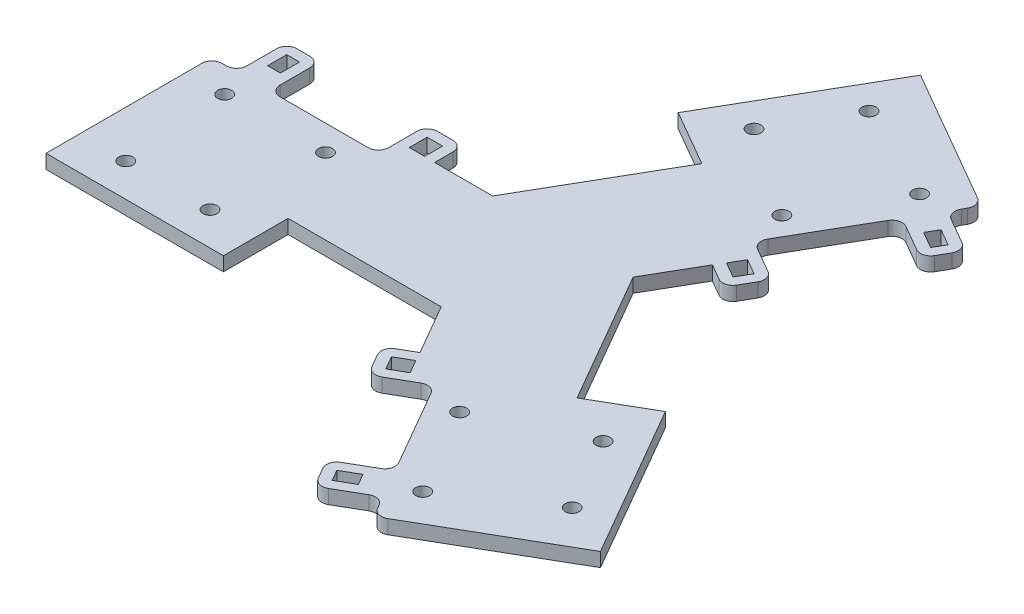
ISO-10303-21;
HEADER;
FILE_DESCRIPTION(('STEP AP214'),'2;1');
FILE_NAME('part.step','',(''),(''),'','','');
FILE_SCHEMA(('AUTOMOTIVE_DESIGN { 1 0 10303 214 1 1 1 1 }'));
ENDSEC;
DATA;
#1=APPLICATION_CONTEXT('core data for automotive mechanical design processes');
#2=APPLICATION_PROTOCOL_DEFINITION('international standard','automotive_design',2000,#1);
#3=PRODUCT_CONTEXT('',#1,'mechanical');
#4=PRODUCT('Part','Part','',(#3));
#5=PRODUCT_RELATED_PRODUCT_CATEGORY('part','',(#4));
#6=PRODUCT_DEFINITION_FORMATION('','',#4);
#7=PRODUCT_DEFINITION_CONTEXT('part definition',#1,'design');
#8=PRODUCT_DEFINITION('design','',#6,#7);
#9=PRODUCT_DEFINITION_SHAPE('','',#8);
#10=(LENGTH_UNIT() NAMED_UNIT(*) SI_UNIT(.MILLI.,.METRE.));
#11=(NAMED_UNIT(*) PLANE_ANGLE_UNIT() SI_UNIT($,.RADIAN.));
#12=(NAMED_UNIT(*) SI_UNIT($,.STERADIAN.) SOLID_ANGLE_UNIT());
#13=UNCERTAINTY_MEASURE_WITH_UNIT(LENGTH_MEASURE(1.E-05),#10,'distance_accuracy_value','');
#14=(GEOMETRIC_REPRESENTATION_CONTEXT(3) GLOBAL_UNCERTAINTY_ASSIGNED_CONTEXT((#13)) GLOBAL_UNIT_ASSIGNED_CONTEXT((#10,
#11,#12)) REPRESENTATION_CONTEXT('',''));
#15=CARTESIAN_POINT('',(0.,0.,0.));
#16=DIRECTION('',(0.,0.,1.));
#17=DIRECTION('',(1.,0.,0.));
#18=AXIS2_PLACEMENT_3D('',#15,#16,#17);
#19=CARTESIAN_POINT('',(192.561201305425,3.,-114.788115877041));
#20=DIRECTION('',(-0.866025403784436,0.,-0.500000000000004));
#21=DIRECTION('',(-0.500000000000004,0.,0.866025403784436));
#22=AXIS2_PLACEMENT_3D('',#19,#20,#21);
#23=PLANE('',#22);
#24=DIRECTION('',(0.,-1.,0.));
#25=VECTOR('',#24,1.);
#26=CARTESIAN_POINT('',(179.211201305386,3.,-91.6652375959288));
#27=LINE('',#26,#25);
#28=CARTESIAN_POINT('',(179.211201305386,3.,-91.6652375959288));
#29=VERTEX_POINT('',#28);
#30=CARTESIAN_POINT('',(179.211201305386,8.5,-91.6652375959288));
#31=VERTEX_POINT('',#30);
#32=EDGE_CURVE('E64',#29,#31,#27,.F.);
#33=ORIENTED_EDGE('',*,*,#32,.T.);
#34=DIRECTION('',(0.500000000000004,0.,-0.866025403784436));
#35=VECTOR('',#34,1.);
#36=CARTESIAN_POINT('',(192.561201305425,8.5,-114.788115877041));
#37=LINE('',#36,#35);
#38=CARTESIAN_POINT('',(161.961201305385,8.5,-61.7873611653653));
#39=VERTEX_POINT('',#38);
#40=EDGE_CURVE('E788',#39,#31,#37,.T.);
#41=ORIENTED_EDGE('',*,*,#40,.F.);
#42=DIRECTION('',(0.,-1.,0.));
#43=VECTOR('',#42,1.);
#44=CARTESIAN_POINT('',(161.961201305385,3.,-61.7873611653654));
#45=LINE('',#44,#43);
#46=CARTESIAN_POINT('',(161.961201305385,3.,-61.7873611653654));
#47=VERTEX_POINT('',#46);
#48=EDGE_CURVE('E733',#39,#47,#45,.T.);
#49=ORIENTED_EDGE('',*,*,#48,.T.);
#50=DIRECTION('',(0.500000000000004,0.,-0.866025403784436));
#51=VECTOR('',#50,1.);
#52=CARTESIAN_POINT('',(192.561201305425,3.,-114.788115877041));
#53=LINE('',#52,#51);
#54=EDGE_CURVE('E775',#47,#29,#53,.T.);
#55=ORIENTED_EDGE('',*,*,#54,.T.);
#56=EDGE_LOOP('',(#33,#41,#49,#55));
#57=FACE_BOUND('',#56,.T.);
#58=ADVANCED_FACE('F41',(#57),#23,.F.);
#59=CARTESIAN_POINT('',(178.895320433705,3.,109.512463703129));
#60=DIRECTION('',(0.866025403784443,0.,-0.499999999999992));
#61=DIRECTION('',(-0.499999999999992,0.,-0.866025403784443));
#62=AXIS2_PLACEMENT_3D('',#59,#60,#61);
#63=PLANE('',#62);
#64=DIRECTION('',(0.499999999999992,0.,0.866025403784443));
#65=VECTOR('',#64,1.);
#66=CARTESIAN_POINT('',(178.895320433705,8.5,109.512463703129));
#67=LINE('',#66,#65);
#68=CARTESIAN_POINT('',(148.295320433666,8.5,56.5117089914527));
#69=VERTEX_POINT('',#68);
#70=CARTESIAN_POINT('',(165.545320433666,8.5,86.3895854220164));
#71=VERTEX_POINT('',#70);
#72=EDGE_CURVE('E1294',#69,#71,#67,.T.);
#73=ORIENTED_EDGE('',*,*,#72,.F.);
#74=DIRECTION('',(0.,-1.,0.));
#75=VECTOR('',#74,1.);
#76=CARTESIAN_POINT('',(148.295320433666,3.,56.5117089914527));
#77=LINE('',#76,#75);
#78=CARTESIAN_POINT('',(148.295320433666,3.,56.5117089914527));
#79=VERTEX_POINT('',#78);
#80=EDGE_CURVE('E953',#69,#79,#77,.T.);
#81=ORIENTED_EDGE('',*,*,#80,.T.);
#82=DIRECTION('',(-0.499999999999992,0.,-0.866025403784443));
#83=VECTOR('',#82,1.);
#84=CARTESIAN_POINT('',(178.895320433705,3.,109.512463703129));
#85=LINE('',#84,#83);
#86=CARTESIAN_POINT('',(165.545320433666,3.,86.3895854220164));
#87=VERTEX_POINT('',#86);
#88=EDGE_CURVE('E1278',#87,#79,#85,.T.);
#89=ORIENTED_EDGE('',*,*,#88,.F.);
#90=DIRECTION('',(0.,-1.,0.));
#91=VECTOR('',#90,1.);
#92=CARTESIAN_POINT('',(165.545320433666,3.,86.3895854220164));
#93=LINE('',#92,#91);
#94=EDGE_CURVE('E950',#87,#71,#93,.F.);
#95=ORIENTED_EDGE('',*,*,#94,.T.);
#96=EDGE_LOOP('',(#73,#81,#89,#95));
#97=FACE_BOUND('',#96,.T.);
#98=ADVANCED_FACE('F1556',(#97),#63,.F.);
#99=CARTESIAN_POINT('',(200.436971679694,3.,16.8236981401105));
#100=DIRECTION('',(0.499999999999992,0.,0.866025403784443));
#101=DIRECTION('',(0.866025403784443,0.,-0.499999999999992));
#102=AXIS2_PLACEMENT_3D('',#99,#100,#101);
#103=PLANE('',#102);
#104=DIRECTION('',(0.,-1.,0.));
#105=VECTOR('',#104,1.);
#106=CARTESIAN_POINT('',(178.500478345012,182.090250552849,29.4887384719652));
#107=LINE('',#106,#105);
#108=CARTESIAN_POINT('',(178.500478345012,8.5,29.4887384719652));
#109=VERTEX_POINT('',#108);
#110=CARTESIAN_POINT('',(178.500478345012,3.,29.4887384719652));
#111=VERTEX_POINT('',#110);
#112=EDGE_CURVE('E1231',#109,#111,#107,.T.);
#113=ORIENTED_EDGE('',*,*,#112,.F.);
#114=DIRECTION('',(-0.866025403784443,0.,0.499999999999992));
#115=VECTOR('',#114,1.);
#116=CARTESIAN_POINT('',(144.145320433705,8.5,49.32369814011));
#117=LINE('',#116,#115);
#118=CARTESIAN_POINT('',(200.436971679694,8.5,16.8236981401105));
#119=VERTEX_POINT('',#118);
#120=EDGE_CURVE('E1289',#119,#109,#117,.T.);
#121=ORIENTED_EDGE('',*,*,#120,.F.);
#122=DIRECTION('',(0.,-1.,0.));
#123=VECTOR('',#122,1.);
#124=CARTESIAN_POINT('',(200.436971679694,3.,16.8236981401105));
#125=LINE('',#124,#123);
#126=CARTESIAN_POINT('',(200.436971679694,3.,16.8236981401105));
#127=VERTEX_POINT('',#126);
#128=EDGE_CURVE('E1295',#119,#127,#125,.T.);
#129=ORIENTED_EDGE('',*,*,#128,.T.);
#130=DIRECTION('',(0.866025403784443,0.,-0.499999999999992));
#131=VECTOR('',#130,1.);
#132=CARTESIAN_POINT('',(200.436971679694,3.,16.8236981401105));
#133=LINE('',#132,#131);
#134=EDGE_CURVE('E1282',#111,#127,#133,.T.);
#135=ORIENTED_EDGE('',*,*,#134,.F.);
#136=EDGE_LOOP('',(#113,#121,#129,#135));
#137=FACE_BOUND('',#136,.T.);
#138=ADVANCED_FACE('F1327',(#137),#103,.F.);
#139=CARTESIAN_POINT('',(235.186971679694,3.,77.0124637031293));
#140=DIRECTION('',(-0.499999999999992,0.,-0.866025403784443));
#141=DIRECTION('',(-0.866025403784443,0.,0.499999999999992));
#142=AXIS2_PLACEMENT_3D('',#139,#140,#141);
#143=PLANE('',#142);
#144=DIRECTION('',(-0.866025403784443,0.,0.499999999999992));
#145=VECTOR('',#144,1.);
#146=CARTESIAN_POINT('',(235.186971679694,3.,77.0124637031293));
#147=LINE('',#146,#145);
#148=CARTESIAN_POINT('',(235.186971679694,3.,77.0124637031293));
#149=VERTEX_POINT('',#148);
#150=CARTESIAN_POINT('',(182.359422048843,3.,107.512463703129));
#151=VERTEX_POINT('',#150);
#152=EDGE_CURVE('E1275',#149,#151,#147,.T.);
#153=ORIENTED_EDGE('',*,*,#152,.F.);
#154=DIRECTION('',(0.,-1.,0.));
#155=VECTOR('',#154,1.);
#156=CARTESIAN_POINT('',(235.186971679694,3.,77.0124637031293));
#157=LINE('',#156,#155);
#158=CARTESIAN_POINT('',(235.186971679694,8.5,77.0124637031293));
#159=VERTEX_POINT('',#158);
#160=EDGE_CURVE('E1298',#159,#149,#157,.T.);
#161=ORIENTED_EDGE('',*,*,#160,.F.);
#162=DIRECTION('',(0.866025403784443,0.,-0.499999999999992));
#163=VECTOR('',#162,1.);
#164=CARTESIAN_POINT('',(178.895320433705,8.5,109.512463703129));
#165=LINE('',#164,#163);
#166=CARTESIAN_POINT('',(182.359422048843,8.5,107.512463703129));
#167=VERTEX_POINT('',#166);
#168=EDGE_CURVE('E1284',#167,#159,#165,.T.);
#169=ORIENTED_EDGE('',*,*,#168,.F.);
#170=DIRECTION('',(0.,-1.,0.));
#171=VECTOR('',#170,1.);
#172=CARTESIAN_POINT('',(182.359422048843,3.,107.512463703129));
#173=LINE('',#172,#171);
#174=EDGE_CURVE('E1301',#167,#151,#173,.T.);
#175=ORIENTED_EDGE('',*,*,#174,.T.);
#176=EDGE_LOOP('',(#153,#161,#169,#175));
#177=FACE_BOUND('',#176,.T.);
#178=ADVANCED_FACE('F1319',(#177),#143,.F.);
#179=CARTESIAN_POINT('',(235.186971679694,3.,77.0124637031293));
#180=DIRECTION('',(-0.866025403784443,0.,0.499999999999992));
#181=DIRECTION('',(0.499999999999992,0.,0.866025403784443));
#182=AXIS2_PLACEMENT_3D('',#179,#180,#181);
#183=PLANE('',#182);
#184=DIRECTION('',(0.499999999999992,0.,0.866025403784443));
#185=VECTOR('',#184,1.);
#186=CARTESIAN_POINT('',(235.186971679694,3.,77.0124637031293));
#187=LINE('',#186,#185);
#188=EDGE_CURVE('E1248',#127,#149,#187,.T.);
#189=ORIENTED_EDGE('',*,*,#188,.F.);
#190=ORIENTED_EDGE('',*,*,#128,.F.);
#191=DIRECTION('',(-0.499999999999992,0.,-0.866025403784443));
#192=VECTOR('',#191,1.);
#193=CARTESIAN_POINT('',(235.186971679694,8.5,77.0124637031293));
#194=LINE('',#193,#192);
#195=EDGE_CURVE('E1286',#159,#119,#194,.T.);
#196=ORIENTED_EDGE('',*,*,#195,.F.);
#197=ORIENTED_EDGE('',*,*,#160,.T.);
#198=EDGE_LOOP('',(#189,#190,#196,#197));
#199=FACE_BOUND('',#198,.T.);
#200=ADVANCED_FACE('F1323',(#199),#183,.F.);
#201=CARTESIAN_POINT('',(176.045320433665,8.5,104.576118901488));
#202=VERTEX_POINT('',#201);
#203=CARTESIAN_POINT('',(176.895320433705,8.5,106.048362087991));
#204=VERTEX_POINT('',#203);
#205=EDGE_CURVE('E1292',#202,#204,#67,.T.);
#206=ORIENTED_EDGE('',*,*,#205,.F.);
#207=DIRECTION('',(0.,-1.,0.));
#208=VECTOR('',#207,1.);
#209=CARTESIAN_POINT('',(176.045320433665,3.,104.576118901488));
#210=LINE('',#209,#208);
#211=CARTESIAN_POINT('',(176.045320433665,3.,104.576118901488));
#212=VERTEX_POINT('',#211);
#213=EDGE_CURVE('E969',#202,#212,#210,.T.);
#214=ORIENTED_EDGE('',*,*,#213,.T.);
#215=CARTESIAN_POINT('',(176.895320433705,3.,106.048362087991));
#216=VERTEX_POINT('',#215);
#217=EDGE_CURVE('E1279',#216,#212,#85,.T.);
#218=ORIENTED_EDGE('',*,*,#217,.F.);
#219=DIRECTION('',(0.,-1.,0.));
#220=VECTOR('',#219,1.);
#221=CARTESIAN_POINT('',(176.895320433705,3.,106.048362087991));
#222=LINE('',#221,#220);
#223=EDGE_CURVE('E49',#216,#204,#222,.F.);
#224=ORIENTED_EDGE('',*,*,#223,.T.);
#225=EDGE_LOOP('',(#206,#214,#218,#224));
#226=FACE_BOUND('',#225,.T.);
#227=ADVANCED_FACE('F1311',(#226),#63,.F.);
#228=CARTESIAN_POINT('',(187.168285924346,8.5,94.8960080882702));
#229=DIRECTION('',(0.,1.,0.));
#230=DIRECTION('',(0.866025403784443,0.,-0.499999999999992));
#231=AXIS2_PLACEMENT_3D('',#228,#229,#230);
#232=PLANE('',#231);
#233=DIRECTION('',(0.866025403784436,0.,0.500000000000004));
#234=VECTOR('',#233,1.);
#235=CARTESIAN_POINT('',(157.811201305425,8.5,-54.5993503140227));
#236=LINE('',#235,#234);
#237=CARTESIAN_POINT('',(101.519550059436,8.5,-87.0993503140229));
#238=VERTEX_POINT('',#237);
#239=CARTESIAN_POINT('',(123.456043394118,8.50000000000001,-74.4343099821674));
#240=VERTEX_POINT('',#239);
#241=EDGE_CURVE('E784',#238,#240,#236,.T.);
#242=ORIENTED_EDGE('',*,*,#241,.T.);
#243=DIRECTION('',(0.5,0.,-0.866025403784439));
#244=VECTOR('',#243,1.);
#245=CARTESIAN_POINT('',(60.3610308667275,8.50000000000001,34.8494574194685));
#246=LINE('',#245,#244);
#247=CARTESIAN_POINT('',(93.4560433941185,8.50000000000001,-22.4727857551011));
#248=VERTEX_POINT('',#247);
#249=EDGE_CURVE('E1208',#248,#240,#246,.T.);
#250=ORIENTED_EDGE('',*,*,#249,.F.);
#251=DIRECTION('',(1.,0.,0.));
#252=VECTOR('',#251,1.);
#253=CARTESIAN_POINT('',(0.,8.50000000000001,-22.4727857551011));
#254=LINE('',#253,#252);
#255=CARTESIAN_POINT('',(70.7257529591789,8.50000000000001,-22.4727857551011));
#256=VERTEX_POINT('',#255);
#257=EDGE_CURVE('E1222',#256,#248,#254,.T.);
#258=ORIENTED_EDGE('',*,*,#257,.F.);
#259=DIRECTION('',(0.,0.,1.));
#260=VECTOR('',#259,1.);
#261=CARTESIAN_POINT('',(70.7257529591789,8.5,-22.4727857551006));
#262=LINE('',#261,#260);
#263=CARTESIAN_POINT('',(70.7257529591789,8.5,-29.5928260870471));
#264=VERTEX_POINT('',#263);
#265=EDGE_CURVE('E1044',#264,#256,#262,.T.);
#266=ORIENTED_EDGE('',*,*,#265,.F.);
#267=CARTESIAN_POINT('',(66.7257529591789,8.5,-29.5928260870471));
#268=DIRECTION('',(0.,1.,0.));
#269=DIRECTION('',(0.,0.,1.));
#270=AXIS2_PLACEMENT_3D('',#267,#268,#269);
#271=CIRCLE('',#270,4.);
#272=CARTESIAN_POINT('',(66.7257529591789,8.5,-33.5928260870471));
#273=VERTEX_POINT('',#272);
#274=EDGE_CURVE('E1145',#264,#273,#271,.T.);
#275=ORIENTED_EDGE('',*,*,#274,.T.);
#276=DIRECTION('',(1.,0.,0.));
#277=VECTOR('',#276,1.);
#278=CARTESIAN_POINT('',(56.6782608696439,8.5,-33.5928260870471));
#279=LINE('',#278,#277);
#280=CARTESIAN_POINT('',(60.6782608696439,8.5,-33.5928260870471));
#281=VERTEX_POINT('',#280);
#282=EDGE_CURVE('E1040',#281,#273,#279,.T.);
#283=ORIENTED_EDGE('',*,*,#282,.F.);
#284=CARTESIAN_POINT('',(60.6782608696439,8.5,-29.5928260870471));
#285=DIRECTION('',(0.,1.,0.));
#286=DIRECTION('',(0.,0.,1.));
#287=AXIS2_PLACEMENT_3D('',#284,#285,#286);
#288=CIRCLE('',#287,4.);
#289=CARTESIAN_POINT('',(56.6782608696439,8.5,-29.5928260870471));
#290=VERTEX_POINT('',#289);
#291=EDGE_CURVE('E1147',#281,#290,#288,.T.);
#292=ORIENTED_EDGE('',*,*,#291,.T.);
#293=DIRECTION('',(0.,0.,-1.));
#294=VECTOR('',#293,1.);
#295=CARTESIAN_POINT('',(56.6782608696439,8.5,-14.4728260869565));
#296=LINE('',#295,#294);
#297=CARTESIAN_POINT('',(56.6782608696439,8.5,-18.4728260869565));
#298=VERTEX_POINT('',#297);
#299=EDGE_CURVE('E1038',#298,#290,#296,.T.);
#300=ORIENTED_EDGE('',*,*,#299,.F.);
#301=CARTESIAN_POINT('',(52.6782608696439,8.5,-18.4728260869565));
#302=DIRECTION('',(0.,1.,0.));
#303=DIRECTION('',(0.,0.,1.));
#304=AXIS2_PLACEMENT_3D('',#301,#302,#303);
#305=CIRCLE('',#304,4.);
#306=CARTESIAN_POINT('',(52.6782608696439,8.5,-14.4728260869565));
#307=VERTEX_POINT('',#306);
#308=EDGE_CURVE('E1202',#298,#307,#305,.F.);
#309=ORIENTED_EDGE('',*,*,#308,.T.);
#310=DIRECTION('',(-1.,0.,0.));
#311=VECTOR('',#310,1.);
#312=CARTESIAN_POINT('',(-8.5217391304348,8.5,-14.4728260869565));
#313=LINE('',#312,#311);
#314=CARTESIAN_POINT('',(18.1782608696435,8.5,-14.4728260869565));
#315=VERTEX_POINT('',#314);
#316=EDGE_CURVE('E1121',#307,#315,#313,.T.);
#317=ORIENTED_EDGE('',*,*,#316,.T.);
#318=CARTESIAN_POINT('',(18.1782608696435,8.5,-18.4728260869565));
#319=DIRECTION('',(0.,1.,0.));
#320=DIRECTION('',(0.,0.,1.));
#321=AXIS2_PLACEMENT_3D('',#318,#319,#320);
#322=CIRCLE('',#321,4.);
#323=CARTESIAN_POINT('',(14.1782608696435,8.5,-18.4728260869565));
#324=VERTEX_POINT('',#323);
#325=EDGE_CURVE('E1198',#315,#324,#322,.F.);
#326=ORIENTED_EDGE('',*,*,#325,.T.);
#327=DIRECTION('',(0.,0.,1.));
#328=VECTOR('',#327,1.);
#329=CARTESIAN_POINT('',(14.1782608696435,8.5,-14.4728260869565));
#330=LINE('',#329,#328);
#331=CARTESIAN_POINT('',(14.1782608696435,8.5,-30.092826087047));
#332=VERTEX_POINT('',#331);
#333=EDGE_CURVE('E1095',#332,#324,#330,.T.);
#334=ORIENTED_EDGE('',*,*,#333,.F.);
#335=CARTESIAN_POINT('',(10.1782608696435,8.5,-30.092826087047));
#336=DIRECTION('',(0.,1.,0.));
#337=DIRECTION('',(0.,0.,1.));
#338=AXIS2_PLACEMENT_3D('',#335,#336,#337);
#339=CIRCLE('',#338,4.);
#340=CARTESIAN_POINT('',(10.1782608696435,8.5,-34.092826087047));
#341=VERTEX_POINT('',#340);
#342=EDGE_CURVE('E1153',#332,#341,#339,.T.);
#343=ORIENTED_EDGE('',*,*,#342,.T.);
#344=DIRECTION('',(1.,0.,0.));
#345=VECTOR('',#344,1.);
#346=CARTESIAN_POINT('',(1.17826086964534,8.5,-34.092826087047));
#347=LINE('',#346,#345);
#348=CARTESIAN_POINT('',(5.17826086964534,8.5,-34.092826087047));
#349=VERTEX_POINT('',#348);
#350=EDGE_CURVE('E1091',#349,#341,#347,.T.);
#351=ORIENTED_EDGE('',*,*,#350,.F.);
#352=CARTESIAN_POINT('',(5.17826086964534,8.5,-30.092826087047));
#353=DIRECTION('',(0.,1.,0.));
#354=DIRECTION('',(0.,0.,1.));
#355=AXIS2_PLACEMENT_3D('',#352,#353,#354);
#356=CIRCLE('',#355,4.);
#357=CARTESIAN_POINT('',(1.17826086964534,8.5,-30.092826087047));
#358=VERTEX_POINT('',#357);
#359=EDGE_CURVE('E1150',#349,#358,#356,.T.);
#360=ORIENTED_EDGE('',*,*,#359,.T.);
#361=DIRECTION('',(0.,0.,-1.));
#362=VECTOR('',#361,1.);
#363=CARTESIAN_POINT('',(1.17826086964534,8.5,-14.4728260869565));
#364=LINE('',#363,#362);
#365=CARTESIAN_POINT('',(1.17826086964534,8.5,-18.4728260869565));
#366=VERTEX_POINT('',#365);
#367=EDGE_CURVE('E1089',#366,#358,#364,.T.);
#368=ORIENTED_EDGE('',*,*,#367,.F.);
#369=CARTESIAN_POINT('',(-2.82173913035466,8.5,-18.4728260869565));
#370=DIRECTION('',(0.,1.,0.));
#371=DIRECTION('',(0.,0.,1.));
#372=AXIS2_PLACEMENT_3D('',#369,#370,#371);
#373=CIRCLE('',#372,4.);
#374=CARTESIAN_POINT('',(-2.82173913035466,8.5,-14.4728260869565));
#375=VERTEX_POINT('',#374);
#376=EDGE_CURVE('E1194',#366,#375,#373,.F.);
#377=ORIENTED_EDGE('',*,*,#376,.T.);
#378=CARTESIAN_POINT('',(-4.5217391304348,8.5,-14.4728260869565));
#379=VERTEX_POINT('',#378);
#380=EDGE_CURVE('E1120',#375,#379,#313,.T.);
#381=ORIENTED_EDGE('',*,*,#380,.T.);
#382=CARTESIAN_POINT('',(-4.5217391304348,8.5,-10.4728260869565));
#383=DIRECTION('',(0.,1.,0.));
#384=DIRECTION('',(0.,0.,1.));
#385=AXIS2_PLACEMENT_3D('',#382,#383,#384);
#386=CIRCLE('',#385,4.);
#387=CARTESIAN_POINT('',(-8.5217391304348,8.5,-10.4728260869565));
#388=VERTEX_POINT('',#387);
#389=EDGE_CURVE('E1178',#379,#388,#386,.T.);
#390=ORIENTED_EDGE('',*,*,#389,.T.);
#391=DIRECTION('',(0.,0.,1.));
#392=VECTOR('',#391,1.);
#393=CARTESIAN_POINT('',(-8.5217391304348,8.5,-14.4728260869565));
#394=LINE('',#393,#392);
#395=CARTESIAN_POINT('',(-8.52173913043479,8.5,50.5271739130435));
#396=VERTEX_POINT('',#395);
#397=EDGE_CURVE('E1112',#388,#396,#394,.T.);
#398=ORIENTED_EDGE('',*,*,#397,.T.);
#399=DIRECTION('',(1.,0.,0.));
#400=VECTOR('',#399,1.);
#401=CARTESIAN_POINT('',(-8.52173913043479,8.5,50.5271739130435));
#402=LINE('',#401,#400);
#403=CARTESIAN_POINT('',(60.9782608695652,8.5,50.5271739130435));
#404=VERTEX_POINT('',#403);
#405=EDGE_CURVE('E1114',#396,#404,#402,.T.);
#406=ORIENTED_EDGE('',*,*,#405,.T.);
#407=DIRECTION('',(0.,0.,-1.));
#408=VECTOR('',#407,1.);
#409=CARTESIAN_POINT('',(60.9782608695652,8.5,-14.4728260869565));
#410=LINE('',#409,#408);
#411=CARTESIAN_POINT('',(60.9782608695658,8.50000000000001,25.1970932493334));
#412=VERTEX_POINT('',#411);
#413=EDGE_CURVE('E1117',#404,#412,#410,.T.);
#414=ORIENTED_EDGE('',*,*,#413,.T.);
#415=DIRECTION('',(-1.,0.,0.));
#416=VECTOR('',#415,1.);
#417=CARTESIAN_POINT('',(0.,8.50000000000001,25.1970932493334));
#418=LINE('',#417,#416);
#419=CARTESIAN_POINT('',(120.978260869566,8.50000000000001,25.1970932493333));
#420=VERTEX_POINT('',#419);
#421=EDGE_CURVE('E1226',#420,#412,#418,.T.);
#422=ORIENTED_EDGE('',*,*,#421,.F.);
#423=DIRECTION('',(-0.5,0.,-0.866025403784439));
#424=VECTOR('',#423,1.);
#425=CARTESIAN_POINT('',(79.8230342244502,8.50000000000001,-46.085850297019));
#426=LINE('',#425,#424);
#427=CARTESIAN_POINT('',(132.343406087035,8.50000000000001,44.8821022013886));
#428=VERTEX_POINT('',#427);
#429=EDGE_CURVE('E1229',#428,#420,#426,.T.);
#430=ORIENTED_EDGE('',*,*,#429,.F.);
#431=DIRECTION('',(0.866025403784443,0.,-0.499999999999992));
#432=VECTOR('',#431,1.);
#433=CARTESIAN_POINT('',(132.343406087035,8.5,44.8821022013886));
#434=LINE('',#433,#432);
#435=CARTESIAN_POINT('',(126.177270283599,8.5,48.4421223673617));
#436=VERTEX_POINT('',#435);
#437=EDGE_CURVE('E852',#436,#428,#434,.T.);
#438=ORIENTED_EDGE('',*,*,#437,.F.);
#439=CARTESIAN_POINT('',(128.177270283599,8.5,51.9062239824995));
#440=DIRECTION('',(0.,1.,0.));
#441=DIRECTION('',(0.,0.,1.));
#442=AXIS2_PLACEMENT_3D('',#439,#440,#441);
#443=CIRCLE('',#442,4.);
#444=CARTESIAN_POINT('',(124.713168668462,8.5,53.9062239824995));
#445=VERTEX_POINT('',#444);
#446=EDGE_CURVE('E935',#436,#445,#443,.T.);
#447=ORIENTED_EDGE('',*,*,#446,.T.);
#448=DIRECTION('',(-0.499999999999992,0.,-0.866025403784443));
#449=VECTOR('',#448,1.);
#450=CARTESIAN_POINT('',(129.736914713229,8.5,62.6076073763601));
#451=LINE('',#450,#449);
#452=CARTESIAN_POINT('',(127.736914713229,8.5,59.1435057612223));
#453=VERTEX_POINT('',#452);
#454=EDGE_CURVE('E848',#453,#445,#451,.T.);
#455=ORIENTED_EDGE('',*,*,#454,.F.);
#456=CARTESIAN_POINT('',(131.201016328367,8.5,57.1435057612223));
#457=DIRECTION('',(0.,1.,0.));
#458=DIRECTION('',(0.,0.,1.));
#459=AXIS2_PLACEMENT_3D('',#456,#457,#458);
#460=CIRCLE('',#459,4.);
#461=CARTESIAN_POINT('',(133.201016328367,8.5,60.6076073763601));
#462=VERTEX_POINT('',#461);
#463=EDGE_CURVE('E932',#453,#462,#460,.T.);
#464=ORIENTED_EDGE('',*,*,#463,.T.);
#465=DIRECTION('',(-0.866025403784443,0.,0.499999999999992));
#466=VECTOR('',#465,1.);
#467=CARTESIAN_POINT('',(146.295320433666,8.5,53.047607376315));
#468=LINE('',#467,#466);
#469=CARTESIAN_POINT('',(142.831218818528,8.5,55.0476073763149));
#470=VERTEX_POINT('',#469);
#471=EDGE_CURVE('E846',#470,#462,#468,.T.);
#472=ORIENTED_EDGE('',*,*,#471,.F.);
#473=CARTESIAN_POINT('',(144.831218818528,8.5,58.5117089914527));
#474=DIRECTION('',(0.,1.,0.));
#475=DIRECTION('',(0.,0.,1.));
#476=AXIS2_PLACEMENT_3D('',#473,#474,#475);
#477=CIRCLE('',#476,4.);
#478=EDGE_CURVE('E962',#470,#69,#477,.F.);
#479=ORIENTED_EDGE('',*,*,#478,.T.);
#480=ORIENTED_EDGE('',*,*,#72,.T.);
#481=CARTESIAN_POINT('',(162.081218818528,8.5,88.3895854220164));
#482=DIRECTION('',(0.,1.,0.));
#483=DIRECTION('',(0.,0.,1.));
#484=AXIS2_PLACEMENT_3D('',#481,#482,#483);
#485=CIRCLE('',#484,4.);
#486=CARTESIAN_POINT('',(164.081218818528,8.5,91.8536870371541));
#487=VERTEX_POINT('',#486);
#488=EDGE_CURVE('E967',#71,#487,#485,.F.);
#489=ORIENTED_EDGE('',*,*,#488,.T.);
#490=DIRECTION('',(0.866025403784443,0.,-0.499999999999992));
#491=VECTOR('',#490,1.);
#492=CARTESIAN_POINT('',(167.545320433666,8.5,89.8536870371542));
#493=LINE('',#492,#491);
#494=CARTESIAN_POINT('',(154.018003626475,8.5,97.6636870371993));
#495=VERTEX_POINT('',#494);
#496=EDGE_CURVE('E903',#495,#487,#493,.T.);
#497=ORIENTED_EDGE('',*,*,#496,.F.);
#498=CARTESIAN_POINT('',(156.018003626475,8.5,101.127788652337));
#499=DIRECTION('',(0.,1.,0.));
#500=DIRECTION('',(0.,0.,1.));
#501=AXIS2_PLACEMENT_3D('',#498,#499,#500);
#502=CIRCLE('',#501,4.);
#503=CARTESIAN_POINT('',(152.553902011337,8.5,103.127788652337));
#504=VERTEX_POINT('',#503);
#505=EDGE_CURVE('E930',#495,#504,#502,.T.);
#506=ORIENTED_EDGE('',*,*,#505,.T.);
#507=DIRECTION('',(-0.499999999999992,0.,-0.866025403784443));
#508=VECTOR('',#507,1.);
#509=CARTESIAN_POINT('',(157.053902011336,8.5,110.922017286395));
#510=LINE('',#509,#508);
#511=CARTESIAN_POINT('',(155.053902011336,8.5,107.457915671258));
#512=VERTEX_POINT('',#511);
#513=EDGE_CURVE('E899',#512,#504,#510,.T.);
#514=ORIENTED_EDGE('',*,*,#513,.F.);
#515=CARTESIAN_POINT('',(158.518003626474,8.5,105.457915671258));
#516=DIRECTION('',(0.,1.,0.));
#517=DIRECTION('',(0.,0.,1.));
#518=AXIS2_PLACEMENT_3D('',#515,#516,#517);
#519=CIRCLE('',#518,4.);
#520=CARTESIAN_POINT('',(160.518003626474,8.5,108.922017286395));
#521=VERTEX_POINT('',#520);
#522=EDGE_CURVE('E927',#512,#521,#519,.T.);
#523=ORIENTED_EDGE('',*,*,#522,.T.);
#524=DIRECTION('',(-0.866025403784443,0.,0.499999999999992));
#525=VECTOR('',#524,1.);
#526=CARTESIAN_POINT('',(174.045320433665,8.5,101.11201728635));
#527=LINE('',#526,#525);
#528=CARTESIAN_POINT('',(170.581218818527,8.5,103.11201728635));
#529=VERTEX_POINT('',#528);
#530=EDGE_CURVE('E897',#529,#521,#527,.T.);
#531=ORIENTED_EDGE('',*,*,#530,.F.);
#532=CARTESIAN_POINT('',(172.581218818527,8.5,106.576118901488));
#533=DIRECTION('',(0.,1.,0.));
#534=DIRECTION('',(0.,0.,1.));
#535=AXIS2_PLACEMENT_3D('',#532,#533,#534);
#536=CIRCLE('',#535,4.);
#537=EDGE_CURVE('E976',#529,#202,#536,.F.);
#538=ORIENTED_EDGE('',*,*,#537,.T.);
#539=ORIENTED_EDGE('',*,*,#205,.T.);
#540=CARTESIAN_POINT('',(180.359422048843,8.5,104.048362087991));
#541=DIRECTION('',(0.,1.,0.));
#542=DIRECTION('',(0.,0.,1.));
#543=AXIS2_PLACEMENT_3D('',#540,#541,#542);
#544=CIRCLE('',#543,4.);
#545=EDGE_CURVE('E11',#204,#167,#544,.T.);
#546=ORIENTED_EDGE('',*,*,#545,.T.);
#547=ORIENTED_EDGE('',*,*,#168,.T.);
#548=ORIENTED_EDGE('',*,*,#195,.T.);
#549=ORIENTED_EDGE('',*,*,#120,.T.);
#550=DIRECTION('',(0.5,0.,0.866025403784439));
#551=VECTOR('',#550,1.);
#552=CARTESIAN_POINT('',(121.106360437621,8.50000000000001,-69.9207897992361));
#553=LINE('',#552,#551);
#554=CARTESIAN_POINT('',(148.500478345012,8.50000000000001,-22.4727857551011));
#555=VERTEX_POINT('',#554);
#556=EDGE_CURVE('E1232',#555,#109,#553,.T.);
#557=ORIENTED_EDGE('',*,*,#556,.F.);
#558=DIRECTION('',(-0.499999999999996,0.,0.866025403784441));
#559=VECTOR('',#558,1.);
#560=CARTESIAN_POINT('',(101.644357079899,8.50000000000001,58.6843969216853));
#561=LINE('',#560,#559);
#562=CARTESIAN_POINT('',(159.865623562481,8.5,-42.1577947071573));
#563=VERTEX_POINT('',#562);
#564=EDGE_CURVE('E1236',#563,#555,#561,.T.);
#565=ORIENTED_EDGE('',*,*,#564,.F.);
#566=DIRECTION('',(-0.866025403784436,0.,-0.500000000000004));
#567=VECTOR('',#566,1.);
#568=CARTESIAN_POINT('',(159.865623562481,8.5,-42.1577947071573));
#569=LINE('',#568,#567);
#570=CARTESIAN_POINT('',(166.031759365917,8.5,-38.597774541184));
#571=VERTEX_POINT('',#570);
#572=EDGE_CURVE('E630',#571,#563,#569,.T.);
#573=ORIENTED_EDGE('',*,*,#572,.F.);
#574=CARTESIAN_POINT('',(168.031759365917,8.5,-42.0618761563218));
#575=DIRECTION('',(0.,1.,0.));
#576=DIRECTION('',(0.,0.,1.));
#577=AXIS2_PLACEMENT_3D('',#574,#575,#576);
#578=CIRCLE('',#577,4.);
#579=CARTESIAN_POINT('',(171.495860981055,8.5,-40.0618761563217));
#580=VERTEX_POINT('',#579);
#581=EDGE_CURVE('E711',#571,#580,#578,.T.);
#582=ORIENTED_EDGE('',*,*,#581,.T.);
#583=DIRECTION('',(-0.500000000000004,0.,0.866025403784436));
#584=VECTOR('',#583,1.);
#585=CARTESIAN_POINT('',(176.519607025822,8.5,-48.7632595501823));
#586=LINE('',#585,#584);
#587=CARTESIAN_POINT('',(174.519607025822,8.5,-45.2991579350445));
#588=VERTEX_POINT('',#587);
#589=EDGE_CURVE('E626',#588,#580,#586,.T.);
#590=ORIENTED_EDGE('',*,*,#589,.F.);
#591=CARTESIAN_POINT('',(171.055505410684,8.5,-47.2991579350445));
#592=DIRECTION('',(0.,1.,0.));
#593=DIRECTION('',(0.,0.,1.));
#594=AXIS2_PLACEMENT_3D('',#591,#592,#593);
#595=CIRCLE('',#594,4.);
#596=CARTESIAN_POINT('',(173.055505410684,8.5,-50.7632595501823));
#597=VERTEX_POINT('',#596);
#598=EDGE_CURVE('E708',#588,#597,#595,.T.);
#599=ORIENTED_EDGE('',*,*,#598,.T.);
#600=DIRECTION('',(0.866025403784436,0.,0.500000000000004));
#601=VECTOR('',#600,1.);
#602=CARTESIAN_POINT('',(159.961201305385,8.5,-58.3232595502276));
#603=LINE('',#602,#601);
#604=CARTESIAN_POINT('',(163.425302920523,8.5,-56.3232595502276));
#605=VERTEX_POINT('',#604);
#606=EDGE_CURVE('E624',#605,#597,#603,.T.);
#607=ORIENTED_EDGE('',*,*,#606,.F.);
#608=CARTESIAN_POINT('',(165.425302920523,8.5,-59.7873611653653));
#609=DIRECTION('',(0.,1.,0.));
#610=DIRECTION('',(0.,0.,1.));
#611=AXIS2_PLACEMENT_3D('',#608,#609,#610);
#612=CIRCLE('',#611,4.);
#613=EDGE_CURVE('E750',#605,#39,#612,.F.);
#614=ORIENTED_EDGE('',*,*,#613,.T.);
#615=ORIENTED_EDGE('',*,*,#40,.T.);
#616=CARTESIAN_POINT('',(182.675302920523,8.5,-89.6652375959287));
#617=DIRECTION('',(0.,1.,0.));
#618=DIRECTION('',(0.,0.,1.));
#619=AXIS2_PLACEMENT_3D('',#616,#617,#618);
#620=CIRCLE('',#619,4.);
#621=CARTESIAN_POINT('',(184.675302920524,8.5,-93.1293392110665));
#622=VERTEX_POINT('',#621);
#623=EDGE_CURVE('E746',#31,#622,#620,.F.);
#624=ORIENTED_EDGE('',*,*,#623,.T.);
#625=DIRECTION('',(-0.866025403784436,0.,-0.500000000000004));
#626=VECTOR('',#625,1.);
#627=CARTESIAN_POINT('',(181.211201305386,8.5,-95.1293392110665));
#628=LINE('',#627,#626);
#629=CARTESIAN_POINT('',(194.738518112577,8.5,-87.3193392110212));
#630=VERTEX_POINT('',#629);
#631=EDGE_CURVE('E679',#630,#622,#628,.T.);
#632=ORIENTED_EDGE('',*,*,#631,.F.);
#633=CARTESIAN_POINT('',(196.738518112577,8.5,-90.783440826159));
#634=DIRECTION('',(0.,1.,0.));
#635=DIRECTION('',(0.,0.,1.));
#636=AXIS2_PLACEMENT_3D('',#633,#634,#635);
#637=CIRCLE('',#636,4.);
#638=CARTESIAN_POINT('',(200.202619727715,8.5,-88.783440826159));
#639=VERTEX_POINT('',#638);
#640=EDGE_CURVE('E706',#630,#639,#637,.T.);
#641=ORIENTED_EDGE('',*,*,#640,.T.);
#642=DIRECTION('',(-0.500000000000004,0.,0.866025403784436));
#643=VECTOR('',#642,1.);
#644=CARTESIAN_POINT('',(204.702619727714,8.5,-96.5776694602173));
#645=LINE('',#644,#643);
#646=CARTESIAN_POINT('',(202.702619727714,8.5,-93.1135678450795));
#647=VERTEX_POINT('',#646);
#648=EDGE_CURVE('E675',#647,#639,#645,.T.);
#649=ORIENTED_EDGE('',*,*,#648,.F.);
#650=CARTESIAN_POINT('',(199.238518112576,8.5,-95.1135678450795));
#651=DIRECTION('',(0.,1.,0.));
#652=DIRECTION('',(0.,0.,1.));
#653=AXIS2_PLACEMENT_3D('',#650,#651,#652);
#654=CIRCLE('',#653,4.);
#655=CARTESIAN_POINT('',(201.238518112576,8.5,-98.5776694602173));
#656=VERTEX_POINT('',#655);
#657=EDGE_CURVE('E703',#647,#656,#654,.T.);
#658=ORIENTED_EDGE('',*,*,#657,.T.);
#659=DIRECTION('',(0.866025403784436,0.,0.500000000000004));
#660=VECTOR('',#659,1.);
#661=CARTESIAN_POINT('',(187.711201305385,8.5,-106.387669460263));
#662=LINE('',#661,#660);
#663=CARTESIAN_POINT('',(191.175302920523,8.5,-104.387669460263));
#664=VERTEX_POINT('',#663);
#665=EDGE_CURVE('E673',#664,#656,#662,.T.);
#666=ORIENTED_EDGE('',*,*,#665,.F.);
#667=CARTESIAN_POINT('',(193.175302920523,8.5,-107.8517710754));
#668=DIRECTION('',(0.,1.,0.));
#669=DIRECTION('',(0.,0.,1.));
#670=AXIS2_PLACEMENT_3D('',#667,#668,#669);
#671=CIRCLE('',#670,4.);
#672=CARTESIAN_POINT('',(189.711201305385,8.5,-109.8517710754));
#673=VERTEX_POINT('',#672);
#674=EDGE_CURVE('E741',#664,#673,#671,.F.);
#675=ORIENTED_EDGE('',*,*,#674,.T.);
#676=CARTESIAN_POINT('',(190.561201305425,8.5,-111.324014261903));
#677=VERTEX_POINT('',#676);
#678=EDGE_CURVE('E56',#673,#677,#37,.T.);
#679=ORIENTED_EDGE('',*,*,#678,.T.);
#680=CARTESIAN_POINT('',(187.097099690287,8.5,-113.324014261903));
#681=DIRECTION('',(0.,1.,0.));
#682=DIRECTION('',(0.,0.,1.));
#683=AXIS2_PLACEMENT_3D('',#680,#681,#682);
#684=CIRCLE('',#683,4.);
#685=CARTESIAN_POINT('',(189.097099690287,8.5,-116.788115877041));
#686=VERTEX_POINT('',#685);
#687=EDGE_CURVE('E803',#677,#686,#684,.T.);
#688=ORIENTED_EDGE('',*,*,#687,.T.);
#689=DIRECTION('',(-0.866025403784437,0.,-0.500000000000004));
#690=VECTOR('',#689,1.);
#691=CARTESIAN_POINT('',(192.561201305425,8.5,-114.788115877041));
#692=LINE('',#691,#690);
#693=CARTESIAN_POINT('',(136.269550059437,8.5,-147.288115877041));
#694=VERTEX_POINT('',#693);
#695=EDGE_CURVE('E779',#686,#694,#692,.T.);
#696=ORIENTED_EDGE('',*,*,#695,.T.);
#697=DIRECTION('',(-0.500000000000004,0.,0.866025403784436));
#698=VECTOR('',#697,1.);
#699=CARTESIAN_POINT('',(136.269550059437,8.5,-147.288115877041));
#700=LINE('',#699,#698);
#701=EDGE_CURVE('E781',#694,#238,#700,.T.);
#702=ORIENTED_EDGE('',*,*,#701,.T.);
#703=EDGE_LOOP('',(#242,#250,#258,#266,#275,#283,#292,#300,#309,#317,#326,#334,#343,#351,#360,
#368,#377,#381,#390,#398,#406,#414,#422,#430,#438,#447,#455,#464,#472,#479,#480,#489,#497,#506,
#514,#523,#531,#538,#539,#546,#547,#548,#549,#557,#565,#573,#582,#590,#599,#607,#614,#615,#624,
#632,#641,#649,#658,#666,#675,#679,#688,#696,#702));
#704=FACE_BOUND('',#703,.T.);
#705=CARTESIAN_POINT('',(176.40094726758,8.5,-106.797734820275));
#706=DIRECTION('',(0.,1.,0.));
#707=DIRECTION('',(0.,0.,1.));
#708=AXIS2_PLACEMENT_3D('',#705,#706,#707);
#709=CIRCLE('',#708,2.75000000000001);
#710=CARTESIAN_POINT('',(176.40094726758,8.5,-104.047734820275));
#711=VERTEX_POINT('',#710);
#712=EDGE_CURVE('E769',#711,#711,#709,.T.);
#713=ORIENTED_EDGE('',*,*,#712,.F.);
#714=EDGE_LOOP('',(#713));
#715=FACE_BOUND('',#714,.T.);
#716=CARTESIAN_POINT('',(156.65094726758,8.5,-72.5897313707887));
#717=DIRECTION('',(0.,1.,0.));
#718=DIRECTION('',(0.,0.,1.));
#719=AXIS2_PLACEMENT_3D('',#716,#717,#718);
#720=CIRCLE('',#719,2.75000000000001);
#721=CARTESIAN_POINT('',(156.65094726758,8.5,-69.8397313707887));
#722=VERTEX_POINT('',#721);
#723=EDGE_CURVE('E759',#722,#722,#720,.T.);
#724=ORIENTED_EDGE('',*,*,#723,.F.);
#725=EDGE_LOOP('',(#724));
#726=FACE_BOUND('',#725,.T.);
#727=CARTESIAN_POINT('',(121.902880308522,8.5,-96.4043139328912));
#728=DIRECTION('',(0.,1.,0.));
#729=DIRECTION('',(0.,0.,1.));
#730=AXIS2_PLACEMENT_3D('',#727,#728,#729);
#731=CIRCLE('',#730,2.75000000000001);
#732=CARTESIAN_POINT('',(121.902880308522,8.5,-93.6543139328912));
#733=VERTEX_POINT('',#732);
#734=EDGE_CURVE('E773',#733,#733,#731,.T.);
#735=ORIENTED_EDGE('',*,*,#734,.F.);
#736=EDGE_LOOP('',(#735));
#737=FACE_BOUND('',#736,.T.);
#738=CARTESIAN_POINT('',(138.40288030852,8.5,-124.983152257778));
#739=DIRECTION('',(0.,1.,0.));
#740=DIRECTION('',(0.,0.,1.));
#741=AXIS2_PLACEMENT_3D('',#738,#739,#740);
#742=CIRCLE('',#741,2.75000000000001);
#743=CARTESIAN_POINT('',(138.40288030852,8.5,-122.233152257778));
#744=VERTEX_POINT('',#743);
#745=EDGE_CURVE('E765',#744,#744,#742,.T.);
#746=ORIENTED_EDGE('',*,*,#745,.F.);
#747=EDGE_LOOP('',(#746));
#748=FACE_BOUND('',#747,.T.);
#749=DIRECTION('',(0.500000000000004,0.,-0.866025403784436));
#750=VECTOR('',#749,1.);
#751=CARTESIAN_POINT('',(192.743327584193,8.5,-98.8635678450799));
#752=LINE('',#751,#750);
#753=CARTESIAN_POINT('',(190.243327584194,8.5,-94.5334408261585));
#754=VERTEX_POINT('',#753);
#755=CARTESIAN_POINT('',(192.743327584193,8.5,-98.8635678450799));
#756=VERTEX_POINT('',#755);
#757=EDGE_CURVE('E651',#754,#756,#752,.T.);
#758=ORIENTED_EDGE('',*,*,#757,.T.);
#759=DIRECTION('',(0.866025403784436,0.,0.500000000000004));
#760=VECTOR('',#759,1.);
#761=CARTESIAN_POINT('',(192.743327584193,8.5,-98.8635678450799));
#762=LINE('',#761,#760);
#763=CARTESIAN_POINT('',(199.238518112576,8.5,-95.1135678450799));
#764=VERTEX_POINT('',#763);
#765=EDGE_CURVE('E641',#756,#764,#762,.T.);
#766=ORIENTED_EDGE('',*,*,#765,.T.);
#767=DIRECTION('',(-0.500000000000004,0.,0.866025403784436));
#768=VECTOR('',#767,1.);
#769=CARTESIAN_POINT('',(199.238518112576,8.5,-95.1135678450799));
#770=LINE('',#769,#768);
#771=CARTESIAN_POINT('',(196.738518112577,8.5,-90.7834408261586));
#772=VERTEX_POINT('',#771);
#773=EDGE_CURVE('E644',#764,#772,#770,.T.);
#774=ORIENTED_EDGE('',*,*,#773,.T.);
#775=DIRECTION('',(-0.866025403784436,0.,-0.500000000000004));
#776=VECTOR('',#775,1.);
#777=CARTESIAN_POINT('',(190.243327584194,8.5,-94.5334408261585));
#778=LINE('',#777,#776);
#779=EDGE_CURVE('E648',#772,#754,#778,.T.);
#780=ORIENTED_EDGE('',*,*,#779,.T.);
#781=EDGE_LOOP('',(#758,#766,#774,#780));
#782=FACE_BOUND('',#781,.T.);
#783=DIRECTION('',(0.500000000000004,0.,-0.866025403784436));
#784=VECTOR('',#783,1.);
#785=CARTESIAN_POINT('',(164.993327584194,8.5,-50.7991579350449));
#786=LINE('',#785,#784);
#787=CARTESIAN_POINT('',(161.969581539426,8.5,-45.5618761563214));
#788=VERTEX_POINT('',#787);
#789=CARTESIAN_POINT('',(164.993327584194,8.5,-50.7991579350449));
#790=VERTEX_POINT('',#789);
#791=EDGE_CURVE('E592',#788,#790,#786,.T.);
#792=ORIENTED_EDGE('',*,*,#791,.T.);
#793=DIRECTION('',(0.866025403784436,0.,0.500000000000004));
#794=VECTOR('',#793,1.);
#795=CARTESIAN_POINT('',(164.993327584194,8.5,-50.7991579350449));
#796=LINE('',#795,#794);
#797=CARTESIAN_POINT('',(171.055505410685,8.5,-47.2991579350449));
#798=VERTEX_POINT('',#797);
#799=EDGE_CURVE('E584',#790,#798,#796,.T.);
#800=ORIENTED_EDGE('',*,*,#799,.T.);
#801=DIRECTION('',(-0.500000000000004,0.,0.866025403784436));
#802=VECTOR('',#801,1.);
#803=CARTESIAN_POINT('',(171.055505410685,8.5,-47.2991579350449));
#804=LINE('',#803,#802);
#805=CARTESIAN_POINT('',(168.031759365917,8.5,-42.0618761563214));
#806=VERTEX_POINT('',#805);
#807=EDGE_CURVE('E596',#798,#806,#804,.T.);
#808=ORIENTED_EDGE('',*,*,#807,.T.);
#809=DIRECTION('',(-0.866025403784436,0.,-0.500000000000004));
#810=VECTOR('',#809,1.);
#811=CARTESIAN_POINT('',(161.969581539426,8.5,-45.5618761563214));
#812=LINE('',#811,#810);
#813=EDGE_CURVE('E600',#806,#788,#812,.T.);
#814=ORIENTED_EDGE('',*,*,#813,.T.);
#815=EDGE_LOOP('',(#792,#800,#808,#814));
#816=FACE_BOUND('',#815,.T.);
#817=DIRECTION('',(0.499999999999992,0.,0.866025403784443));
#818=VECTOR('',#817,1.);
#819=CARTESIAN_POINT('',(165.013194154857,8.5,101.707915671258));
#820=LINE('',#819,#818);
#821=CARTESIAN_POINT('',(162.513194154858,8.5,97.3777886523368));
#822=VERTEX_POINT('',#821);
#823=CARTESIAN_POINT('',(165.013194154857,8.5,101.707915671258));
#824=VERTEX_POINT('',#823);
#825=EDGE_CURVE('E875',#822,#824,#820,.T.);
#826=ORIENTED_EDGE('',*,*,#825,.T.);
#827=DIRECTION('',(-0.866025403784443,0.,0.499999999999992));
#828=VECTOR('',#827,1.);
#829=CARTESIAN_POINT('',(165.013194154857,8.5,101.707915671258));
#830=LINE('',#829,#828);
#831=CARTESIAN_POINT('',(158.518003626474,8.5,105.457915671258));
#832=VERTEX_POINT('',#831);
#833=EDGE_CURVE('E865',#824,#832,#830,.T.);
#834=ORIENTED_EDGE('',*,*,#833,.T.);
#835=DIRECTION('',(-0.499999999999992,0.,-0.866025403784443));
#836=VECTOR('',#835,1.);
#837=CARTESIAN_POINT('',(158.518003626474,8.5,105.457915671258));
#838=LINE('',#837,#836);
#839=CARTESIAN_POINT('',(156.018003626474,8.5,101.127788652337));
#840=VERTEX_POINT('',#839);
#841=EDGE_CURVE('E868',#832,#840,#838,.T.);
#842=ORIENTED_EDGE('',*,*,#841,.T.);
#843=DIRECTION('',(0.866025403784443,0.,-0.499999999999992));
#844=VECTOR('',#843,1.);
#845=CARTESIAN_POINT('',(162.513194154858,8.5,97.3777886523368));
#846=LINE('',#845,#844);
#847=EDGE_CURVE('E872',#840,#822,#846,.T.);
#848=ORIENTED_EDGE('',*,*,#847,.T.);
#849=EDGE_LOOP('',(#826,#834,#842,#848));
#850=FACE_BOUND('',#849,.T.);
#851=DIRECTION('',(0.499999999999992,0.,0.866025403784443));
#852=VECTOR('',#851,1.);
#853=CARTESIAN_POINT('',(137.263194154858,8.5,53.6435057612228));
#854=LINE('',#853,#852);
#855=CARTESIAN_POINT('',(134.23944811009,8.5,48.4062239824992));
#856=VERTEX_POINT('',#855);
#857=CARTESIAN_POINT('',(137.263194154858,8.5,53.6435057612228));
#858=VERTEX_POINT('',#857);
#859=EDGE_CURVE('E824',#856,#858,#854,.T.);
#860=ORIENTED_EDGE('',*,*,#859,.T.);
#861=DIRECTION('',(-0.866025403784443,0.,0.499999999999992));
#862=VECTOR('',#861,1.);
#863=CARTESIAN_POINT('',(137.263194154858,8.5,53.6435057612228));
#864=LINE('',#863,#862);
#865=CARTESIAN_POINT('',(131.201016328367,8.5,57.1435057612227));
#866=VERTEX_POINT('',#865);
#867=EDGE_CURVE('E814',#858,#866,#864,.T.);
#868=ORIENTED_EDGE('',*,*,#867,.T.);
#869=DIRECTION('',(-0.499999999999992,0.,-0.866025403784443));
#870=VECTOR('',#869,1.);
#871=CARTESIAN_POINT('',(131.201016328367,8.5,57.1435057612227));
#872=LINE('',#871,#870);
#873=CARTESIAN_POINT('',(128.177270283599,8.5,51.9062239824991));
#874=VERTEX_POINT('',#873);
#875=EDGE_CURVE('E817',#866,#874,#872,.T.);
#876=ORIENTED_EDGE('',*,*,#875,.T.);
#877=DIRECTION('',(0.866025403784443,0.,-0.499999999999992));
#878=VECTOR('',#877,1.);
#879=CARTESIAN_POINT('',(134.23944811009,8.5,48.4062239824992));
#880=LINE('',#879,#878);
#881=EDGE_CURVE('E821',#874,#856,#880,.T.);
#882=ORIENTED_EDGE('',*,*,#881,.T.);
#883=EDGE_LOOP('',(#860,#868,#876,#882));
#884=FACE_BOUND('',#883,.T.);
#885=CARTESIAN_POINT('',(45.9782608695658,8.5,-4.47282608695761));
#886=DIRECTION('',(0.,1.,0.));
#887=DIRECTION('',(0.866025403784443,0.,-0.499999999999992));
#888=AXIS2_PLACEMENT_3D('',#885,#886,#887);
#889=CIRCLE('',#888,2.75000000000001);
#890=CARTESIAN_POINT('',(48.359830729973,8.5,-5.84782608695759));
#891=VERTEX_POINT('',#890);
#892=EDGE_CURVE('E981',#891,#891,#889,.T.);
#893=ORIENTED_EDGE('',*,*,#892,.F.);
#894=EDGE_LOOP('',(#893));
#895=FACE_BOUND('',#894,.T.);
#896=CARTESIAN_POINT('',(6.47826086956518,8.5,-4.47282608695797));
#897=DIRECTION('',(0.,1.,0.));
#898=DIRECTION('',(0.866025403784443,0.,-0.499999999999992));
#899=AXIS2_PLACEMENT_3D('',#896,#897,#898);
#900=CIRCLE('',#899,2.75000000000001);
#901=CARTESIAN_POINT('',(8.85983072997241,8.5,-5.84782608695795));
#902=VERTEX_POINT('',#901);
#903=EDGE_CURVE('E987',#902,#902,#900,.T.);
#904=ORIENTED_EDGE('',*,*,#903,.F.);
#905=EDGE_LOOP('',(#904));
#906=FACE_BOUND('',#905,.T.);
#907=CARTESIAN_POINT('',(9.72826086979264,8.5,37.5271739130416));
#908=DIRECTION('',(0.,1.,0.));
#909=DIRECTION('',(0.866025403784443,0.,-0.499999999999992));
#910=AXIS2_PLACEMENT_3D('',#907,#908,#909);
#911=CIRCLE('',#910,2.75000000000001);
#912=CARTESIAN_POINT('',(12.1098307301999,8.5,36.1521739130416));
#913=VERTEX_POINT('',#912);
#914=EDGE_CURVE('E993',#913,#913,#911,.T.);
#915=ORIENTED_EDGE('',*,*,#914,.F.);
#916=EDGE_LOOP('',(#915));
#917=FACE_BOUND('',#916,.T.);
#918=CARTESIAN_POINT('',(42.728260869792,8.5,37.5271739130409));
#919=DIRECTION('',(0.,1.,0.));
#920=DIRECTION('',(0.866025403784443,0.,-0.499999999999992));
#921=AXIS2_PLACEMENT_3D('',#918,#919,#920);
#922=CIRCLE('',#921,2.75000000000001);
#923=CARTESIAN_POINT('',(45.1098307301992,8.5,36.1521739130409));
#924=VERTEX_POINT('',#923);
#925=EDGE_CURVE('E999',#924,#924,#922,.T.);
#926=ORIENTED_EDGE('',*,*,#925,.F.);
#927=EDGE_LOOP('',(#926));
#928=FACE_BOUND('',#927,.T.);
#929=DIRECTION('',(-1.,0.,0.));
#930=VECTOR('',#929,1.);
#931=CARTESIAN_POINT('',(5.1782608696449,8.5,-22.5928260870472));
#932=LINE('',#931,#930);
#933=CARTESIAN_POINT('',(10.1782608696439,8.5,-22.5928260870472));
#934=VERTEX_POINT('',#933);
#935=CARTESIAN_POINT('',(5.1782608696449,8.5,-22.5928260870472));
#936=VERTEX_POINT('',#935);
#937=EDGE_CURVE('E1067',#934,#936,#932,.T.);
#938=ORIENTED_EDGE('',*,*,#937,.T.);
#939=DIRECTION('',(0.,0.,-1.));
#940=VECTOR('',#939,1.);
#941=CARTESIAN_POINT('',(5.1782608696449,8.5,-22.5928260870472));
#942=LINE('',#941,#940);
#943=CARTESIAN_POINT('',(5.1782608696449,8.5,-30.092826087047));
#944=VERTEX_POINT('',#943);
#945=EDGE_CURVE('E1057',#936,#944,#942,.T.);
#946=ORIENTED_EDGE('',*,*,#945,.T.);
#947=DIRECTION('',(1.,0.,0.));
#948=VECTOR('',#947,1.);
#949=CARTESIAN_POINT('',(5.1782608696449,8.5,-30.092826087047));
#950=LINE('',#949,#948);
#951=CARTESIAN_POINT('',(10.1782608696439,8.5,-30.092826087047));
#952=VERTEX_POINT('',#951);
#953=EDGE_CURVE('E1060',#944,#952,#950,.T.);
#954=ORIENTED_EDGE('',*,*,#953,.T.);
#955=DIRECTION('',(0.,0.,1.));
#956=VECTOR('',#955,1.);
#957=CARTESIAN_POINT('',(10.1782608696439,8.5,-22.5928260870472));
#958=LINE('',#957,#956);
#959=EDGE_CURVE('E1064',#952,#934,#958,.T.);
#960=ORIENTED_EDGE('',*,*,#959,.T.);
#961=EDGE_LOOP('',(#938,#946,#954,#960));
#962=FACE_BOUND('',#961,.T.);
#963=DIRECTION('',(-1.,0.,0.));
#964=VECTOR('',#963,1.);
#965=CARTESIAN_POINT('',(60.6782608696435,8.5,-22.5928260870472));
#966=LINE('',#965,#964);
#967=CARTESIAN_POINT('',(66.7257529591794,8.5,-22.5928260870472));
#968=VERTEX_POINT('',#967);
#969=CARTESIAN_POINT('',(60.6782608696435,8.5,-22.5928260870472));
#970=VERTEX_POINT('',#969);
#971=EDGE_CURVE('E1016',#968,#970,#966,.T.);
#972=ORIENTED_EDGE('',*,*,#971,.T.);
#973=DIRECTION('',(0.,0.,-1.));
#974=VECTOR('',#973,1.);
#975=CARTESIAN_POINT('',(60.6782608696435,8.5,-22.5928260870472));
#976=LINE('',#975,#974);
#977=CARTESIAN_POINT('',(60.6782608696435,8.5,-29.5928260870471));
#978=VERTEX_POINT('',#977);
#979=EDGE_CURVE('E1006',#970,#978,#976,.T.);
#980=ORIENTED_EDGE('',*,*,#979,.T.);
#981=DIRECTION('',(1.,0.,0.));
#982=VECTOR('',#981,1.);
#983=CARTESIAN_POINT('',(60.6782608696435,8.5,-29.5928260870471));
#984=LINE('',#983,#982);
#985=CARTESIAN_POINT('',(66.7257529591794,8.5,-29.5928260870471));
#986=VERTEX_POINT('',#985);
#987=EDGE_CURVE('E1009',#978,#986,#984,.T.);
#988=ORIENTED_EDGE('',*,*,#987,.T.);
#989=DIRECTION('',(0.,0.,1.));
#990=VECTOR('',#989,1.);
#991=CARTESIAN_POINT('',(66.7257529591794,8.5,-22.5928260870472));
#992=LINE('',#991,#990);
#993=EDGE_CURVE('E1013',#986,#968,#992,.T.);
#994=ORIENTED_EDGE('',*,*,#993,.T.);
#995=EDGE_LOOP('',(#972,#980,#988,#994));
#996=FACE_BOUND('',#995,.T.);
#997=CARTESIAN_POINT('',(198.303641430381,8.5,39.1286617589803));
#998=DIRECTION('',(0.,1.,0.));
#999=DIRECTION('',(-0.866025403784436,0.,-0.500000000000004));
#1000=AXIS2_PLACEMENT_3D('',#997,#998,#999);
#1001=CIRCLE('',#1000,2.75000000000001);
#1002=CARTESIAN_POINT('',(195.922071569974,8.5,37.7536617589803));
#1003=VERTEX_POINT('',#1002);
#1004=EDGE_CURVE('E1269',#1003,#1003,#1001,.T.);
#1005=ORIENTED_EDGE('',*,*,#1004,.F.);
#1006=EDGE_LOOP('',(#1005));
#1007=FACE_BOUND('',#1006,.T.);
#1008=CARTESIAN_POINT('',(214.803641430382,8.5,67.7075000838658));
#1009=DIRECTION('',(0.,1.,0.));
#1010=DIRECTION('',(-0.866025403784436,0.,-0.500000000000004));
#1011=AXIS2_PLACEMENT_3D('',#1008,#1009,#1010);
#1012=CIRCLE('',#1011,2.75000000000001);
#1013=CARTESIAN_POINT('',(212.422071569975,8.5,66.3325000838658));
#1014=VERTEX_POINT('',#1013);
#1015=EDGE_CURVE('E1263',#1014,#1014,#1012,.T.);
#1016=ORIENTED_EDGE('',*,*,#1015,.F.);
#1017=EDGE_LOOP('',(#1016));
#1018=FACE_BOUND('',#1017,.T.);
#1019=CARTESIAN_POINT('',(180.05557447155,8.5,91.5220826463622));
#1020=DIRECTION('',(0.,1.,0.));
#1021=DIRECTION('',(-0.866025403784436,0.,-0.500000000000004));
#1022=AXIS2_PLACEMENT_3D('',#1019,#1020,#1021);
#1023=CIRCLE('',#1022,2.75000000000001);
#1024=CARTESIAN_POINT('',(177.674004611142,8.5,90.1470826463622));
#1025=VERTEX_POINT('',#1024);
#1026=EDGE_CURVE('E1257',#1025,#1025,#1023,.T.);
#1027=ORIENTED_EDGE('',*,*,#1026,.F.);
#1028=EDGE_LOOP('',(#1027));
#1029=FACE_BOUND('',#1028,.T.);
#1030=CARTESIAN_POINT('',(160.305574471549,8.5,57.3140791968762));
#1031=DIRECTION('',(0.,1.,0.));
#1032=DIRECTION('',(-0.866025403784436,0.,-0.500000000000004));
#1033=AXIS2_PLACEMENT_3D('',#1030,#1031,#1032);
#1034=CIRCLE('',#1033,2.75000000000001);
#1035=CARTESIAN_POINT('',(157.924004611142,8.5,55.9390791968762));
#1036=VERTEX_POINT('',#1035);
#1037=EDGE_CURVE('E1251',#1036,#1036,#1034,.T.);
#1038=ORIENTED_EDGE('',*,*,#1037,.F.);
#1039=EDGE_LOOP('',(#1038));
#1040=FACE_BOUND('',#1039,.T.);
#1041=ADVANCED_FACE('F602',(#704,#715,#726,#737,#748,#782,#816,#850,#884,#895,#906,#917,#928,
#962,#996,#1007,#1018,#1029,#1040),#232,.T.);
#1042=CARTESIAN_POINT('',(180.359422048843,3.,104.048362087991));
#1043=DIRECTION('',(0.,-1.,0.));
#1044=DIRECTION('',(0.,0.,-1.));
#1045=AXIS2_PLACEMENT_3D('',#1042,#1043,#1044);
#1046=CYLINDRICAL_SURFACE('',#1045,4.);
#1047=ORIENTED_EDGE('',*,*,#545,.F.);
#1048=ORIENTED_EDGE('',*,*,#223,.F.);
#1049=CARTESIAN_POINT('',(180.359422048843,3.,104.048362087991));
#1050=DIRECTION('',(0.,1.,0.));
#1051=DIRECTION('',(0.,0.,1.));
#1052=AXIS2_PLACEMENT_3D('',#1049,#1050,#1051);
#1053=CIRCLE('',#1052,4.);
#1054=EDGE_CURVE('E1304',#151,#216,#1053,.F.);
#1055=ORIENTED_EDGE('',*,*,#1054,.F.);
#1056=ORIENTED_EDGE('',*,*,#174,.F.);
#1057=EDGE_LOOP('',(#1047,#1048,#1055,#1056));
#1058=FACE_BOUND('',#1057,.T.);
#1059=ADVANCED_FACE('F43',(#1058),#1046,.T.);
#1060=CARTESIAN_POINT('',(187.168285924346,3.,94.8960080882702));
#1061=DIRECTION('',(0.,1.,0.));
#1062=DIRECTION('',(0.866025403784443,0.,-0.499999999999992));
#1063=AXIS2_PLACEMENT_3D('',#1060,#1061,#1062);
#1064=PLANE('',#1063);
#1065=DIRECTION('',(0.5,0.,-0.866025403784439));
#1066=VECTOR('',#1065,1.);
#1067=CARTESIAN_POINT('',(60.3610308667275,3.,34.8494574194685));
#1068=LINE('',#1067,#1066);
#1069=CARTESIAN_POINT('',(93.4560433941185,3.,-22.4727857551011));
#1070=VERTEX_POINT('',#1069);
#1071=CARTESIAN_POINT('',(123.456043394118,3.,-74.4343099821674));
#1072=VERTEX_POINT('',#1071);
#1073=EDGE_CURVE('E1216',#1070,#1072,#1068,.T.);
#1074=ORIENTED_EDGE('',*,*,#1073,.T.);
#1075=DIRECTION('',(0.866025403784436,0.,0.500000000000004));
#1076=VECTOR('',#1075,1.);
#1077=CARTESIAN_POINT('',(101.519550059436,3.,-87.0993503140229));
#1078=LINE('',#1077,#1076);
#1079=CARTESIAN_POINT('',(101.519550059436,3.,-87.0993503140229));
#1080=VERTEX_POINT('',#1079);
#1081=EDGE_CURVE('E776',#1080,#1072,#1078,.T.);
#1082=ORIENTED_EDGE('',*,*,#1081,.F.);
#1083=DIRECTION('',(0.500000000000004,0.,-0.866025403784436));
#1084=VECTOR('',#1083,1.);
#1085=CARTESIAN_POINT('',(136.269550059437,3.,-147.288115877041));
#1086=LINE('',#1085,#1084);
#1087=CARTESIAN_POINT('',(136.269550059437,3.,-147.288115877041));
#1088=VERTEX_POINT('',#1087);
#1089=EDGE_CURVE('E752',#1080,#1088,#1086,.T.);
#1090=ORIENTED_EDGE('',*,*,#1089,.T.);
#1091=DIRECTION('',(-0.866025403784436,0.,-0.500000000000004));
#1092=VECTOR('',#1091,1.);
#1093=CARTESIAN_POINT('',(136.269550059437,3.,-147.288115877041));
#1094=LINE('',#1093,#1092);
#1095=CARTESIAN_POINT('',(189.097099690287,3.,-116.788115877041));
#1096=VERTEX_POINT('',#1095);
#1097=EDGE_CURVE('E770',#1096,#1088,#1094,.T.);
#1098=ORIENTED_EDGE('',*,*,#1097,.F.);
#1099=CARTESIAN_POINT('',(187.097099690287,3.,-113.324014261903));
#1100=DIRECTION('',(0.,1.,0.));
#1101=DIRECTION('',(0.,0.,1.));
#1102=AXIS2_PLACEMENT_3D('',#1099,#1100,#1101);
#1103=CIRCLE('',#1102,4.);
#1104=CARTESIAN_POINT('',(190.561201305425,3.,-111.324014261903));
#1105=VERTEX_POINT('',#1104);
#1106=EDGE_CURVE('E798',#1096,#1105,#1103,.F.);
#1107=ORIENTED_EDGE('',*,*,#1106,.T.);
#1108=CARTESIAN_POINT('',(189.711201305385,3.,-109.8517710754));
#1109=VERTEX_POINT('',#1108);
#1110=EDGE_CURVE('E772',#1109,#1105,#53,.T.);
#1111=ORIENTED_EDGE('',*,*,#1110,.F.);
#1112=CARTESIAN_POINT('',(193.175302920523,3.,-107.8517710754));
#1113=DIRECTION('',(0.,1.,0.));
#1114=DIRECTION('',(0.,0.,1.));
#1115=AXIS2_PLACEMENT_3D('',#1112,#1113,#1114);
#1116=CIRCLE('',#1115,4.);
#1117=CARTESIAN_POINT('',(191.175302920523,3.,-104.387669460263));
#1118=VERTEX_POINT('',#1117);
#1119=EDGE_CURVE('E739',#1109,#1118,#1116,.T.);
#1120=ORIENTED_EDGE('',*,*,#1119,.T.);
#1121=DIRECTION('',(0.866025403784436,0.,0.500000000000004));
#1122=VECTOR('',#1121,1.);
#1123=CARTESIAN_POINT('',(187.711201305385,3.,-106.387669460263));
#1124=LINE('',#1123,#1122);
#1125=CARTESIAN_POINT('',(201.238518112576,3.,-98.5776694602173));
#1126=VERTEX_POINT('',#1125);
#1127=EDGE_CURVE('E666',#1118,#1126,#1124,.T.);
#1128=ORIENTED_EDGE('',*,*,#1127,.T.);
#1129=CARTESIAN_POINT('',(199.238518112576,3.,-95.1135678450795));
#1130=DIRECTION('',(0.,1.,0.));
#1131=DIRECTION('',(0.,0.,1.));
#1132=AXIS2_PLACEMENT_3D('',#1129,#1130,#1131);
#1133=CIRCLE('',#1132,4.);
#1134=CARTESIAN_POINT('',(202.702619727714,3.,-93.1135678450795));
#1135=VERTEX_POINT('',#1134);
#1136=EDGE_CURVE('E693',#1126,#1135,#1133,.F.);
#1137=ORIENTED_EDGE('',*,*,#1136,.T.);
#1138=DIRECTION('',(-0.500000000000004,0.,0.866025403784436));
#1139=VECTOR('',#1138,1.);
#1140=CARTESIAN_POINT('',(204.702619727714,3.,-96.5776694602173));
#1141=LINE('',#1140,#1139);
#1142=CARTESIAN_POINT('',(200.202619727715,3.,-88.783440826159));
#1143=VERTEX_POINT('',#1142);
#1144=EDGE_CURVE('E684',#1135,#1143,#1141,.T.);
#1145=ORIENTED_EDGE('',*,*,#1144,.T.);
#1146=CARTESIAN_POINT('',(196.738518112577,3.,-90.783440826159));
#1147=DIRECTION('',(0.,1.,0.));
#1148=DIRECTION('',(0.,0.,1.));
#1149=AXIS2_PLACEMENT_3D('',#1146,#1147,#1148);
#1150=CIRCLE('',#1149,4.);
#1151=CARTESIAN_POINT('',(194.738518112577,3.,-87.3193392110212));
#1152=VERTEX_POINT('',#1151);
#1153=EDGE_CURVE('E695',#1143,#1152,#1150,.F.);
#1154=ORIENTED_EDGE('',*,*,#1153,.T.);
#1155=DIRECTION('',(-0.866025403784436,0.,-0.500000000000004));
#1156=VECTOR('',#1155,1.);
#1157=CARTESIAN_POINT('',(181.211201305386,3.,-95.1293392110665));
#1158=LINE('',#1157,#1156);
#1159=CARTESIAN_POINT('',(184.675302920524,3.,-93.1293392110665));
#1160=VERTEX_POINT('',#1159);
#1161=EDGE_CURVE('E676',#1152,#1160,#1158,.T.);
#1162=ORIENTED_EDGE('',*,*,#1161,.T.);
#1163=CARTESIAN_POINT('',(182.675302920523,3.,-89.6652375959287));
#1164=DIRECTION('',(0.,1.,0.));
#1165=DIRECTION('',(0.,0.,1.));
#1166=AXIS2_PLACEMENT_3D('',#1163,#1164,#1165);
#1167=CIRCLE('',#1166,4.);
#1168=EDGE_CURVE('E743',#1160,#29,#1167,.T.);
#1169=ORIENTED_EDGE('',*,*,#1168,.T.);
#1170=ORIENTED_EDGE('',*,*,#54,.F.);
#1171=CARTESIAN_POINT('',(165.425302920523,3.,-59.7873611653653));
#1172=DIRECTION('',(0.,1.,0.));
#1173=DIRECTION('',(0.,0.,1.));
#1174=AXIS2_PLACEMENT_3D('',#1171,#1172,#1173);
#1175=CIRCLE('',#1174,4.);
#1176=CARTESIAN_POINT('',(163.425302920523,3.,-56.3232595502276));
#1177=VERTEX_POINT('',#1176);
#1178=EDGE_CURVE('E748',#47,#1177,#1175,.T.);
#1179=ORIENTED_EDGE('',*,*,#1178,.T.);
#1180=DIRECTION('',(0.866025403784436,0.,0.500000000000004));
#1181=VECTOR('',#1180,1.);
#1182=CARTESIAN_POINT('',(159.961201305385,3.,-58.3232595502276));
#1183=LINE('',#1182,#1181);
#1184=CARTESIAN_POINT('',(173.055505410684,3.,-50.7632595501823));
#1185=VERTEX_POINT('',#1184);
#1186=EDGE_CURVE('E620',#1177,#1185,#1183,.T.);
#1187=ORIENTED_EDGE('',*,*,#1186,.T.);
#1188=CARTESIAN_POINT('',(171.055505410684,3.,-47.2991579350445));
#1189=DIRECTION('',(0.,1.,0.));
#1190=DIRECTION('',(0.,0.,1.));
#1191=AXIS2_PLACEMENT_3D('',#1188,#1189,#1190);
#1192=CIRCLE('',#1191,4.);
#1193=CARTESIAN_POINT('',(174.519607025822,3.,-45.2991579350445));
#1194=VERTEX_POINT('',#1193);
#1195=EDGE_CURVE('E697',#1185,#1194,#1192,.F.);
#1196=ORIENTED_EDGE('',*,*,#1195,.T.);
#1197=DIRECTION('',(-0.500000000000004,0.,0.866025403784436));
#1198=VECTOR('',#1197,1.);
#1199=CARTESIAN_POINT('',(176.519607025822,3.,-48.7632595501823));
#1200=LINE('',#1199,#1198);
#1201=CARTESIAN_POINT('',(171.495860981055,3.,-40.0618761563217));
#1202=VERTEX_POINT('',#1201);
#1203=EDGE_CURVE('E634',#1194,#1202,#1200,.T.);
#1204=ORIENTED_EDGE('',*,*,#1203,.T.);
#1205=CARTESIAN_POINT('',(168.031759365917,3.,-42.0618761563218));
#1206=DIRECTION('',(0.,1.,0.));
#1207=DIRECTION('',(0.,0.,1.));
#1208=AXIS2_PLACEMENT_3D('',#1205,#1206,#1207);
#1209=CIRCLE('',#1208,4.);
#1210=CARTESIAN_POINT('',(166.031759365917,3.,-38.597774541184));
#1211=VERTEX_POINT('',#1210);
#1212=EDGE_CURVE('E699',#1202,#1211,#1209,.F.);
#1213=ORIENTED_EDGE('',*,*,#1212,.T.);
#1214=DIRECTION('',(-0.866025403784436,0.,-0.500000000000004));
#1215=VECTOR('',#1214,1.);
#1216=CARTESIAN_POINT('',(159.865623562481,3.,-42.1577947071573));
#1217=LINE('',#1216,#1215);
#1218=CARTESIAN_POINT('',(159.865623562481,3.,-42.1577947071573));
#1219=VERTEX_POINT('',#1218);
#1220=EDGE_CURVE('E627',#1211,#1219,#1217,.T.);
#1221=ORIENTED_EDGE('',*,*,#1220,.T.);
#1222=DIRECTION('',(-0.499999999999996,0.,0.866025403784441));
#1223=VECTOR('',#1222,1.);
#1224=CARTESIAN_POINT('',(101.644357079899,3.,58.6843969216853));
#1225=LINE('',#1224,#1223);
#1226=CARTESIAN_POINT('',(148.500478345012,3.,-22.4727857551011));
#1227=VERTEX_POINT('',#1226);
#1228=EDGE_CURVE('E1214',#1219,#1227,#1225,.T.);
#1229=ORIENTED_EDGE('',*,*,#1228,.T.);
#1230=DIRECTION('',(0.5,0.,0.866025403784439));
#1231=VECTOR('',#1230,1.);
#1232=CARTESIAN_POINT('',(121.106360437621,3.,-69.9207897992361));
#1233=LINE('',#1232,#1231);
#1234=EDGE_CURVE('E1211',#1227,#111,#1233,.T.);
#1235=ORIENTED_EDGE('',*,*,#1234,.T.);
#1236=ORIENTED_EDGE('',*,*,#134,.T.);
#1237=ORIENTED_EDGE('',*,*,#188,.T.);
#1238=ORIENTED_EDGE('',*,*,#152,.T.);
#1239=ORIENTED_EDGE('',*,*,#1054,.T.);
#1240=ORIENTED_EDGE('',*,*,#217,.T.);
#1241=CARTESIAN_POINT('',(172.581218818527,3.,106.576118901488));
#1242=DIRECTION('',(0.,1.,0.));
#1243=DIRECTION('',(0.,0.,1.));
#1244=AXIS2_PLACEMENT_3D('',#1241,#1242,#1243);
#1245=CIRCLE('',#1244,4.);
#1246=CARTESIAN_POINT('',(170.581218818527,3.,103.11201728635));
#1247=VERTEX_POINT('',#1246);
#1248=EDGE_CURVE('E974',#212,#1247,#1245,.T.);
#1249=ORIENTED_EDGE('',*,*,#1248,.T.);
#1250=DIRECTION('',(-0.866025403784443,0.,0.499999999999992));
#1251=VECTOR('',#1250,1.);
#1252=CARTESIAN_POINT('',(174.045320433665,3.,101.11201728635));
#1253=LINE('',#1252,#1251);
#1254=CARTESIAN_POINT('',(160.518003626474,3.,108.922017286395));
#1255=VERTEX_POINT('',#1254);
#1256=EDGE_CURVE('E890',#1247,#1255,#1253,.T.);
#1257=ORIENTED_EDGE('',*,*,#1256,.T.);
#1258=CARTESIAN_POINT('',(158.518003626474,3.,105.457915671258));
#1259=DIRECTION('',(0.,1.,0.));
#1260=DIRECTION('',(0.,0.,1.));
#1261=AXIS2_PLACEMENT_3D('',#1258,#1259,#1260);
#1262=CIRCLE('',#1261,4.);
#1263=CARTESIAN_POINT('',(155.053902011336,3.,107.457915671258));
#1264=VERTEX_POINT('',#1263);
#1265=EDGE_CURVE('E917',#1255,#1264,#1262,.F.);
#1266=ORIENTED_EDGE('',*,*,#1265,.T.);
#1267=DIRECTION('',(-0.499999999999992,0.,-0.866025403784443));
#1268=VECTOR('',#1267,1.);
#1269=CARTESIAN_POINT('',(157.053902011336,3.,110.922017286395));
#1270=LINE('',#1269,#1268);
#1271=CARTESIAN_POINT('',(152.553902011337,3.,103.127788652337));
#1272=VERTEX_POINT('',#1271);
#1273=EDGE_CURVE('E908',#1264,#1272,#1270,.T.);
#1274=ORIENTED_EDGE('',*,*,#1273,.T.);
#1275=CARTESIAN_POINT('',(156.018003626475,3.,101.127788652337));
#1276=DIRECTION('',(0.,1.,0.));
#1277=DIRECTION('',(0.,0.,1.));
#1278=AXIS2_PLACEMENT_3D('',#1275,#1276,#1277);
#1279=CIRCLE('',#1278,4.);
#1280=CARTESIAN_POINT('',(154.018003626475,3.,97.6636870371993));
#1281=VERTEX_POINT('',#1280);
#1282=EDGE_CURVE('E919',#1272,#1281,#1279,.F.);
#1283=ORIENTED_EDGE('',*,*,#1282,.T.);
#1284=DIRECTION('',(0.866025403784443,0.,-0.499999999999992));
#1285=VECTOR('',#1284,1.);
#1286=CARTESIAN_POINT('',(167.545320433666,3.,89.8536870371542));
#1287=LINE('',#1286,#1285);
#1288=CARTESIAN_POINT('',(164.081218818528,3.,91.8536870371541));
#1289=VERTEX_POINT('',#1288);
#1290=EDGE_CURVE('E900',#1281,#1289,#1287,.T.);
#1291=ORIENTED_EDGE('',*,*,#1290,.T.);
#1292=CARTESIAN_POINT('',(162.081218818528,3.,88.3895854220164));
#1293=DIRECTION('',(0.,1.,0.));
#1294=DIRECTION('',(0.,0.,1.));
#1295=AXIS2_PLACEMENT_3D('',#1292,#1293,#1294);
#1296=CIRCLE('',#1295,4.);
#1297=EDGE_CURVE('E965',#1289,#87,#1296,.T.);
#1298=ORIENTED_EDGE('',*,*,#1297,.T.);
#1299=ORIENTED_EDGE('',*,*,#88,.T.);
#1300=CARTESIAN_POINT('',(144.831218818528,3.,58.5117089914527));
#1301=DIRECTION('',(0.,1.,0.));
#1302=DIRECTION('',(0.,0.,1.));
#1303=AXIS2_PLACEMENT_3D('',#1300,#1301,#1302);
#1304=CIRCLE('',#1303,4.);
#1305=CARTESIAN_POINT('',(142.831218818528,3.,55.0476073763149));
#1306=VERTEX_POINT('',#1305);
#1307=EDGE_CURVE('E960',#79,#1306,#1304,.T.);
#1308=ORIENTED_EDGE('',*,*,#1307,.T.);
#1309=DIRECTION('',(-0.866025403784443,0.,0.499999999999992));
#1310=VECTOR('',#1309,1.);
#1311=CARTESIAN_POINT('',(146.295320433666,3.,53.047607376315));
#1312=LINE('',#1311,#1310);
#1313=CARTESIAN_POINT('',(133.201016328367,3.,60.6076073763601));
#1314=VERTEX_POINT('',#1313);
#1315=EDGE_CURVE('E839',#1306,#1314,#1312,.T.);
#1316=ORIENTED_EDGE('',*,*,#1315,.T.);
#1317=CARTESIAN_POINT('',(131.201016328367,3.,57.1435057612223));
#1318=DIRECTION('',(0.,1.,0.));
#1319=DIRECTION('',(0.,0.,1.));
#1320=AXIS2_PLACEMENT_3D('',#1317,#1318,#1319);
#1321=CIRCLE('',#1320,4.);
#1322=CARTESIAN_POINT('',(127.736914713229,3.,59.1435057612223));
#1323=VERTEX_POINT('',#1322);
#1324=EDGE_CURVE('E921',#1314,#1323,#1321,.F.);
#1325=ORIENTED_EDGE('',*,*,#1324,.T.);
#1326=DIRECTION('',(-0.499999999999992,0.,-0.866025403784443));
#1327=VECTOR('',#1326,1.);
#1328=CARTESIAN_POINT('',(129.736914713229,3.,62.6076073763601));
#1329=LINE('',#1328,#1327);
#1330=CARTESIAN_POINT('',(124.713168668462,3.,53.9062239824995));
#1331=VERTEX_POINT('',#1330);
#1332=EDGE_CURVE('E857',#1323,#1331,#1329,.T.);
#1333=ORIENTED_EDGE('',*,*,#1332,.T.);
#1334=CARTESIAN_POINT('',(128.177270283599,3.,51.9062239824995));
#1335=DIRECTION('',(0.,1.,0.));
#1336=DIRECTION('',(0.,0.,1.));
#1337=AXIS2_PLACEMENT_3D('',#1334,#1335,#1336);
#1338=CIRCLE('',#1337,4.);
#1339=CARTESIAN_POINT('',(126.177270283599,3.,48.4421223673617));
#1340=VERTEX_POINT('',#1339);
#1341=EDGE_CURVE('E923',#1331,#1340,#1338,.F.);
#1342=ORIENTED_EDGE('',*,*,#1341,.T.);
#1343=DIRECTION('',(0.866025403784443,0.,-0.499999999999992));
#1344=VECTOR('',#1343,1.);
#1345=CARTESIAN_POINT('',(132.343406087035,3.,44.8821022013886));
#1346=LINE('',#1345,#1344);
#1347=CARTESIAN_POINT('',(132.343406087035,3.,44.8821022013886));
#1348=VERTEX_POINT('',#1347);
#1349=EDGE_CURVE('E849',#1340,#1348,#1346,.T.);
#1350=ORIENTED_EDGE('',*,*,#1349,.T.);
#1351=DIRECTION('',(-0.5,0.,-0.866025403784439));
#1352=VECTOR('',#1351,1.);
#1353=CARTESIAN_POINT('',(79.8230342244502,3.,-46.085850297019));
#1354=LINE('',#1353,#1352);
#1355=CARTESIAN_POINT('',(120.978260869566,3.,25.1970932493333));
#1356=VERTEX_POINT('',#1355);
#1357=EDGE_CURVE('E1209',#1348,#1356,#1354,.T.);
#1358=ORIENTED_EDGE('',*,*,#1357,.T.);
#1359=DIRECTION('',(-1.,0.,0.));
#1360=VECTOR('',#1359,1.);
#1361=CARTESIAN_POINT('',(0.,3.,25.1970932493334));
#1362=LINE('',#1361,#1360);
#1363=CARTESIAN_POINT('',(60.9782608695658,3.,25.1970932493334));
#1364=VERTEX_POINT('',#1363);
#1365=EDGE_CURVE('E1205',#1356,#1364,#1362,.T.);
#1366=ORIENTED_EDGE('',*,*,#1365,.T.);
#1367=DIRECTION('',(0.,0.,1.));
#1368=VECTOR('',#1367,1.);
#1369=CARTESIAN_POINT('',(60.9782608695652,3.,3.34717391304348));
#1370=LINE('',#1369,#1368);
#1371=CARTESIAN_POINT('',(60.9782608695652,3.,50.5271739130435));
#1372=VERTEX_POINT('',#1371);
#1373=EDGE_CURVE('E1098',#1364,#1372,#1370,.T.);
#1374=ORIENTED_EDGE('',*,*,#1373,.T.);
#1375=DIRECTION('',(-1.,0.,0.));
#1376=VECTOR('',#1375,1.);
#1377=CARTESIAN_POINT('',(-8.5217391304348,3.,50.5271739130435));
#1378=LINE('',#1377,#1376);
#1379=CARTESIAN_POINT('',(-8.5217391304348,3.,50.5271739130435));
#1380=VERTEX_POINT('',#1379);
#1381=EDGE_CURVE('E978',#1372,#1380,#1378,.T.);
#1382=ORIENTED_EDGE('',*,*,#1381,.T.);
#1383=DIRECTION('',(0.,0.,1.));
#1384=VECTOR('',#1383,1.);
#1385=CARTESIAN_POINT('',(-8.5217391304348,3.,50.5271739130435));
#1386=LINE('',#1385,#1384);
#1387=CARTESIAN_POINT('',(-8.5217391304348,3.,-10.4728260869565));
#1388=VERTEX_POINT('',#1387);
#1389=EDGE_CURVE('E1106',#1388,#1380,#1386,.T.);
#1390=ORIENTED_EDGE('',*,*,#1389,.F.);
#1391=CARTESIAN_POINT('',(-4.5217391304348,3.,-10.4728260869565));
#1392=DIRECTION('',(0.,1.,0.));
#1393=DIRECTION('',(0.,0.,1.));
#1394=AXIS2_PLACEMENT_3D('',#1391,#1392,#1393);
#1395=CIRCLE('',#1394,4.);
#1396=CARTESIAN_POINT('',(-4.5217391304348,3.,-14.4728260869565));
#1397=VERTEX_POINT('',#1396);
#1398=EDGE_CURVE('E1171',#1388,#1397,#1395,.F.);
#1399=ORIENTED_EDGE('',*,*,#1398,.T.);
#1400=DIRECTION('',(-1.,0.,0.));
#1401=VECTOR('',#1400,1.);
#1402=CARTESIAN_POINT('',(-8.5217391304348,3.,-14.4728260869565));
#1403=LINE('',#1402,#1401);
#1404=CARTESIAN_POINT('',(-2.82173913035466,3.,-14.4728260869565));
#1405=VERTEX_POINT('',#1404);
#1406=EDGE_CURVE('E1108',#1405,#1397,#1403,.T.);
#1407=ORIENTED_EDGE('',*,*,#1406,.F.);
#1408=CARTESIAN_POINT('',(-2.82173913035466,3.,-18.4728260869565));
#1409=DIRECTION('',(0.,1.,0.));
#1410=DIRECTION('',(0.,0.,1.));
#1411=AXIS2_PLACEMENT_3D('',#1408,#1409,#1410);
#1412=CIRCLE('',#1411,4.);
#1413=CARTESIAN_POINT('',(1.17826086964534,3.,-18.4728260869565));
#1414=VERTEX_POINT('',#1413);
#1415=EDGE_CURVE('E1192',#1405,#1414,#1412,.T.);
#1416=ORIENTED_EDGE('',*,*,#1415,.T.);
#1417=DIRECTION('',(0.,0.,-1.));
#1418=VECTOR('',#1417,1.);
#1419=CARTESIAN_POINT('',(1.17826086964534,3.,-14.4728260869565));
#1420=LINE('',#1419,#1418);
#1421=CARTESIAN_POINT('',(1.17826086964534,3.,-30.092826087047));
#1422=VERTEX_POINT('',#1421);
#1423=EDGE_CURVE('E1082',#1414,#1422,#1420,.T.);
#1424=ORIENTED_EDGE('',*,*,#1423,.T.);
#1425=CARTESIAN_POINT('',(5.17826086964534,3.,-30.092826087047));
#1426=DIRECTION('',(0.,1.,0.));
#1427=DIRECTION('',(0.,0.,1.));
#1428=AXIS2_PLACEMENT_3D('',#1425,#1426,#1427);
#1429=CIRCLE('',#1428,4.);
#1430=CARTESIAN_POINT('',(5.17826086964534,3.,-34.092826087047));
#1431=VERTEX_POINT('',#1430);
#1432=EDGE_CURVE('E1139',#1422,#1431,#1429,.F.);
#1433=ORIENTED_EDGE('',*,*,#1432,.T.);
#1434=DIRECTION('',(1.,0.,0.));
#1435=VECTOR('',#1434,1.);
#1436=CARTESIAN_POINT('',(1.17826086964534,3.,-34.092826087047));
#1437=LINE('',#1436,#1435);
#1438=CARTESIAN_POINT('',(10.1782608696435,3.,-34.092826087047));
#1439=VERTEX_POINT('',#1438);
#1440=EDGE_CURVE('E1100',#1431,#1439,#1437,.T.);
#1441=ORIENTED_EDGE('',*,*,#1440,.T.);
#1442=CARTESIAN_POINT('',(10.1782608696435,3.,-30.092826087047));
#1443=DIRECTION('',(0.,1.,0.));
#1444=DIRECTION('',(0.,0.,1.));
#1445=AXIS2_PLACEMENT_3D('',#1442,#1443,#1444);
#1446=CIRCLE('',#1445,4.);
#1447=CARTESIAN_POINT('',(14.1782608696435,3.,-30.092826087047));
#1448=VERTEX_POINT('',#1447);
#1449=EDGE_CURVE('E1141',#1439,#1448,#1446,.F.);
#1450=ORIENTED_EDGE('',*,*,#1449,.T.);
#1451=DIRECTION('',(0.,0.,1.));
#1452=VECTOR('',#1451,1.);
#1453=CARTESIAN_POINT('',(14.1782608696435,3.,-14.4728260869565));
#1454=LINE('',#1453,#1452);
#1455=CARTESIAN_POINT('',(14.1782608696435,3.,-18.4728260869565));
#1456=VERTEX_POINT('',#1455);
#1457=EDGE_CURVE('E1092',#1448,#1456,#1454,.T.);
#1458=ORIENTED_EDGE('',*,*,#1457,.T.);
#1459=CARTESIAN_POINT('',(18.1782608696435,3.,-18.4728260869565));
#1460=DIRECTION('',(0.,1.,0.));
#1461=DIRECTION('',(0.,0.,1.));
#1462=AXIS2_PLACEMENT_3D('',#1459,#1460,#1461);
#1463=CIRCLE('',#1462,4.);
#1464=CARTESIAN_POINT('',(18.1782608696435,3.,-14.4728260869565));
#1465=VERTEX_POINT('',#1464);
#1466=EDGE_CURVE('E1196',#1456,#1465,#1463,.T.);
#1467=ORIENTED_EDGE('',*,*,#1466,.T.);
#1468=CARTESIAN_POINT('',(52.6782608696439,3.,-14.4728260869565));
#1469=VERTEX_POINT('',#1468);
#1470=EDGE_CURVE('E1111',#1469,#1465,#1403,.T.);
#1471=ORIENTED_EDGE('',*,*,#1470,.F.);
#1472=CARTESIAN_POINT('',(52.6782608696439,3.,-18.4728260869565));
#1473=DIRECTION('',(0.,1.,0.));
#1474=DIRECTION('',(0.,0.,1.));
#1475=AXIS2_PLACEMENT_3D('',#1472,#1473,#1474);
#1476=CIRCLE('',#1475,4.);
#1477=CARTESIAN_POINT('',(56.6782608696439,3.,-18.4728260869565));
#1478=VERTEX_POINT('',#1477);
#1479=EDGE_CURVE('E1200',#1469,#1478,#1476,.T.);
#1480=ORIENTED_EDGE('',*,*,#1479,.T.);
#1481=DIRECTION('',(0.,0.,-1.));
#1482=VECTOR('',#1481,1.);
#1483=CARTESIAN_POINT('',(56.6782608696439,3.,-14.4728260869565));
#1484=LINE('',#1483,#1482);
#1485=CARTESIAN_POINT('',(56.6782608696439,3.,-29.5928260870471));
#1486=VERTEX_POINT('',#1485);
#1487=EDGE_CURVE('E1031',#1478,#1486,#1484,.T.);
#1488=ORIENTED_EDGE('',*,*,#1487,.T.);
#1489=CARTESIAN_POINT('',(60.6782608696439,3.,-29.5928260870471));
#1490=DIRECTION('',(0.,1.,0.));
#1491=DIRECTION('',(0.,0.,1.));
#1492=AXIS2_PLACEMENT_3D('',#1489,#1490,#1491);
#1493=CIRCLE('',#1492,4.);
#1494=CARTESIAN_POINT('',(60.6782608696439,3.,-33.5928260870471));
#1495=VERTEX_POINT('',#1494);
#1496=EDGE_CURVE('E1137',#1486,#1495,#1493,.F.);
#1497=ORIENTED_EDGE('',*,*,#1496,.T.);
#1498=DIRECTION('',(1.,0.,0.));
#1499=VECTOR('',#1498,1.);
#1500=CARTESIAN_POINT('',(56.6782608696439,3.,-33.5928260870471));
#1501=LINE('',#1500,#1499);
#1502=CARTESIAN_POINT('',(66.7257529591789,3.,-33.5928260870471));
#1503=VERTEX_POINT('',#1502);
#1504=EDGE_CURVE('E1049',#1495,#1503,#1501,.T.);
#1505=ORIENTED_EDGE('',*,*,#1504,.T.);
#1506=CARTESIAN_POINT('',(66.7257529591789,3.,-29.5928260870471));
#1507=DIRECTION('',(0.,1.,0.));
#1508=DIRECTION('',(0.,0.,1.));
#1509=AXIS2_PLACEMENT_3D('',#1506,#1507,#1508);
#1510=CIRCLE('',#1509,4.);
#1511=CARTESIAN_POINT('',(70.7257529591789,3.,-29.5928260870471));
#1512=VERTEX_POINT('',#1511);
#1513=EDGE_CURVE('E1135',#1503,#1512,#1510,.F.);
#1514=ORIENTED_EDGE('',*,*,#1513,.T.);
#1515=DIRECTION('',(0.,0.,1.));
#1516=VECTOR('',#1515,1.);
#1517=CARTESIAN_POINT('',(70.7257529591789,3.,-22.4727857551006));
#1518=LINE('',#1517,#1516);
#1519=CARTESIAN_POINT('',(70.7257529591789,3.,-22.4727857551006));
#1520=VERTEX_POINT('',#1519);
#1521=EDGE_CURVE('E1041',#1512,#1520,#1518,.T.);
#1522=ORIENTED_EDGE('',*,*,#1521,.T.);
#1523=DIRECTION('',(1.,0.,0.));
#1524=VECTOR('',#1523,1.);
#1525=CARTESIAN_POINT('',(0.,3.,-22.4727857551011));
#1526=LINE('',#1525,#1524);
#1527=EDGE_CURVE('E1204',#1520,#1070,#1526,.T.);
#1528=ORIENTED_EDGE('',*,*,#1527,.T.);
#1529=EDGE_LOOP('',(#1074,#1082,#1090,#1098,#1107,#1111,#1120,#1128,#1137,#1145,#1154,#1162,
#1169,#1170,#1179,#1187,#1196,#1204,#1213,#1221,#1229,#1235,#1236,#1237,#1238,#1239,#1240,#1249,
#1257,#1266,#1274,#1283,#1291,#1298,#1299,#1308,#1316,#1325,#1333,#1342,#1350,#1358,#1366,#1374,
#1382,#1390,#1399,#1407,#1416,#1424,#1433,#1441,#1450,#1458,#1467,#1471,#1480,#1488,#1497,#1505,
#1514,#1522,#1528));
#1530=FACE_BOUND('',#1529,.T.);
#1531=CARTESIAN_POINT('',(121.902880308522,3.,-96.4043139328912));
#1532=DIRECTION('',(0.,-1.,0.));
#1533=DIRECTION('',(0.,0.,-1.));
#1534=AXIS2_PLACEMENT_3D('',#1531,#1532,#1533);
#1535=CIRCLE('',#1534,2.75000000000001);
#1536=CARTESIAN_POINT('',(121.902880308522,3.,-99.1543139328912));
#1537=VERTEX_POINT('',#1536);
#1538=EDGE_CURVE('E762',#1537,#1537,#1535,.T.);
#1539=ORIENTED_EDGE('',*,*,#1538,.F.);
#1540=EDGE_LOOP('',(#1539));
#1541=FACE_BOUND('',#1540,.T.);
#1542=CARTESIAN_POINT('',(138.40288030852,3.,-124.983152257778));
#1543=DIRECTION('',(0.,-1.,0.));
#1544=DIRECTION('',(0.,0.,-1.));
#1545=AXIS2_PLACEMENT_3D('',#1542,#1543,#1544);
#1546=CIRCLE('',#1545,2.75000000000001);
#1547=CARTESIAN_POINT('',(138.40288030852,3.,-127.733152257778));
#1548=VERTEX_POINT('',#1547);
#1549=EDGE_CURVE('E766',#1548,#1548,#1546,.T.);
#1550=ORIENTED_EDGE('',*,*,#1549,.F.);
#1551=EDGE_LOOP('',(#1550));
#1552=FACE_BOUND('',#1551,.T.);
#1553=CARTESIAN_POINT('',(176.40094726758,3.,-106.797734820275));
#1554=DIRECTION('',(0.,-1.,0.));
#1555=DIRECTION('',(0.,0.,-1.));
#1556=AXIS2_PLACEMENT_3D('',#1553,#1554,#1555);
#1557=CIRCLE('',#1556,2.75000000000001);
#1558=CARTESIAN_POINT('',(176.40094726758,3.,-109.547734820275));
#1559=VERTEX_POINT('',#1558);
#1560=EDGE_CURVE('E756',#1559,#1559,#1557,.T.);
#1561=ORIENTED_EDGE('',*,*,#1560,.F.);
#1562=EDGE_LOOP('',(#1561));
#1563=FACE_BOUND('',#1562,.T.);
#1564=CARTESIAN_POINT('',(156.65094726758,3.,-72.5897313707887));
#1565=DIRECTION('',(0.,-1.,0.));
#1566=DIRECTION('',(0.,0.,-1.));
#1567=AXIS2_PLACEMENT_3D('',#1564,#1565,#1566);
#1568=CIRCLE('',#1567,2.75000000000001);
#1569=CARTESIAN_POINT('',(156.65094726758,3.,-75.3397313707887));
#1570=VERTEX_POINT('',#1569);
#1571=EDGE_CURVE('E755',#1570,#1570,#1568,.T.);
#1572=ORIENTED_EDGE('',*,*,#1571,.F.);
#1573=EDGE_LOOP('',(#1572));
#1574=FACE_BOUND('',#1573,.T.);
#1575=DIRECTION('',(0.866025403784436,0.,0.500000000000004));
#1576=VECTOR('',#1575,1.);
#1577=CARTESIAN_POINT('',(192.743327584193,3.,-98.8635678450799));
#1578=LINE('',#1577,#1576);
#1579=CARTESIAN_POINT('',(192.743327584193,3.,-98.8635678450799));
#1580=VERTEX_POINT('',#1579);
#1581=CARTESIAN_POINT('',(199.238518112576,3.,-95.1135678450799));
#1582=VERTEX_POINT('',#1581);
#1583=EDGE_CURVE('E640',#1580,#1582,#1578,.T.);
#1584=ORIENTED_EDGE('',*,*,#1583,.F.);
#1585=DIRECTION('',(0.500000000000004,0.,-0.866025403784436));
#1586=VECTOR('',#1585,1.);
#1587=CARTESIAN_POINT('',(192.743327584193,3.,-98.8635678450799));
#1588=LINE('',#1587,#1586);
#1589=CARTESIAN_POINT('',(190.243327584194,3.,-94.5334408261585));
#1590=VERTEX_POINT('',#1589);
#1591=EDGE_CURVE('E645',#1590,#1580,#1588,.T.);
#1592=ORIENTED_EDGE('',*,*,#1591,.F.);
#1593=DIRECTION('',(-0.866025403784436,0.,-0.500000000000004));
#1594=VECTOR('',#1593,1.);
#1595=CARTESIAN_POINT('',(190.243327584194,3.,-94.5334408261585));
#1596=LINE('',#1595,#1594);
#1597=CARTESIAN_POINT('',(196.738518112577,3.,-90.7834408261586));
#1598=VERTEX_POINT('',#1597);
#1599=EDGE_CURVE('E659',#1598,#1590,#1596,.T.);
#1600=ORIENTED_EDGE('',*,*,#1599,.F.);
#1601=DIRECTION('',(-0.500000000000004,0.,0.866025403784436));
#1602=VECTOR('',#1601,1.);
#1603=CARTESIAN_POINT('',(199.238518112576,3.,-95.1135678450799));
#1604=LINE('',#1603,#1602);
#1605=EDGE_CURVE('E656',#1582,#1598,#1604,.T.);
#1606=ORIENTED_EDGE('',*,*,#1605,.F.);
#1607=EDGE_LOOP('',(#1584,#1592,#1600,#1606));
#1608=FACE_BOUND('',#1607,.T.);
#1609=DIRECTION('',(0.866025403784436,0.,0.500000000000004));
#1610=VECTOR('',#1609,1.);
#1611=CARTESIAN_POINT('',(164.993327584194,3.,-50.7991579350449));
#1612=LINE('',#1611,#1610);
#1613=CARTESIAN_POINT('',(164.993327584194,3.,-50.7991579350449));
#1614=VERTEX_POINT('',#1613);
#1615=CARTESIAN_POINT('',(171.055505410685,3.,-47.2991579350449));
#1616=VERTEX_POINT('',#1615);
#1617=EDGE_CURVE('E587',#1614,#1616,#1612,.T.);
#1618=ORIENTED_EDGE('',*,*,#1617,.F.);
#1619=DIRECTION('',(0.500000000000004,0.,-0.866025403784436));
#1620=VECTOR('',#1619,1.);
#1621=CARTESIAN_POINT('',(164.993327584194,3.,-50.7991579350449));
#1622=LINE('',#1621,#1620);
#1623=CARTESIAN_POINT('',(161.969581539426,3.,-45.5618761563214));
#1624=VERTEX_POINT('',#1623);
#1625=EDGE_CURVE('E605',#1624,#1614,#1622,.T.);
#1626=ORIENTED_EDGE('',*,*,#1625,.F.);
#1627=DIRECTION('',(-0.866025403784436,0.,-0.500000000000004));
#1628=VECTOR('',#1627,1.);
#1629=CARTESIAN_POINT('',(161.969581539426,3.,-45.5618761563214));
#1630=LINE('',#1629,#1628);
#1631=CARTESIAN_POINT('',(168.031759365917,3.,-42.0618761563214));
#1632=VERTEX_POINT('',#1631);
#1633=EDGE_CURVE('E608',#1632,#1624,#1630,.T.);
#1634=ORIENTED_EDGE('',*,*,#1633,.F.);
#1635=DIRECTION('',(-0.500000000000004,0.,0.866025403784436));
#1636=VECTOR('',#1635,1.);
#1637=CARTESIAN_POINT('',(171.055505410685,3.,-47.2991579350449));
#1638=LINE('',#1637,#1636);
#1639=EDGE_CURVE('E614',#1616,#1632,#1638,.T.);
#1640=ORIENTED_EDGE('',*,*,#1639,.F.);
#1641=EDGE_LOOP('',(#1618,#1626,#1634,#1640));
#1642=FACE_BOUND('',#1641,.T.);
#1643=DIRECTION('',(-0.866025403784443,0.,0.499999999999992));
#1644=VECTOR('',#1643,1.);
#1645=CARTESIAN_POINT('',(165.013194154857,3.,101.707915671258));
#1646=LINE('',#1645,#1644);
#1647=CARTESIAN_POINT('',(165.013194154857,3.,101.707915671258));
#1648=VERTEX_POINT('',#1647);
#1649=CARTESIAN_POINT('',(158.518003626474,3.,105.457915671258));
#1650=VERTEX_POINT('',#1649);
#1651=EDGE_CURVE('E864',#1648,#1650,#1646,.T.);
#1652=ORIENTED_EDGE('',*,*,#1651,.F.);
#1653=DIRECTION('',(0.499999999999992,0.,0.866025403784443));
#1654=VECTOR('',#1653,1.);
#1655=CARTESIAN_POINT('',(165.013194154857,3.,101.707915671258));
#1656=LINE('',#1655,#1654);
#1657=CARTESIAN_POINT('',(162.513194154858,3.,97.3777886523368));
#1658=VERTEX_POINT('',#1657);
#1659=EDGE_CURVE('E869',#1658,#1648,#1656,.T.);
#1660=ORIENTED_EDGE('',*,*,#1659,.F.);
#1661=DIRECTION('',(0.866025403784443,0.,-0.499999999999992));
#1662=VECTOR('',#1661,1.);
#1663=CARTESIAN_POINT('',(162.513194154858,3.,97.3777886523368));
#1664=LINE('',#1663,#1662);
#1665=CARTESIAN_POINT('',(156.018003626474,3.,101.127788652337));
#1666=VERTEX_POINT('',#1665);
#1667=EDGE_CURVE('E883',#1666,#1658,#1664,.T.);
#1668=ORIENTED_EDGE('',*,*,#1667,.F.);
#1669=DIRECTION('',(-0.499999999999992,0.,-0.866025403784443));
#1670=VECTOR('',#1669,1.);
#1671=CARTESIAN_POINT('',(158.518003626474,3.,105.457915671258));
#1672=LINE('',#1671,#1670);
#1673=EDGE_CURVE('E880',#1650,#1666,#1672,.T.);
#1674=ORIENTED_EDGE('',*,*,#1673,.F.);
#1675=EDGE_LOOP('',(#1652,#1660,#1668,#1674));
#1676=FACE_BOUND('',#1675,.T.);
#1677=DIRECTION('',(-0.866025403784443,0.,0.499999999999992));
#1678=VECTOR('',#1677,1.);
#1679=CARTESIAN_POINT('',(137.263194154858,3.,53.6435057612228));
#1680=LINE('',#1679,#1678);
#1681=CARTESIAN_POINT('',(137.263194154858,3.,53.6435057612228));
#1682=VERTEX_POINT('',#1681);
#1683=CARTESIAN_POINT('',(131.201016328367,3.,57.1435057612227));
#1684=VERTEX_POINT('',#1683);
#1685=EDGE_CURVE('E805',#1682,#1684,#1680,.T.);
#1686=ORIENTED_EDGE('',*,*,#1685,.F.);
#1687=DIRECTION('',(0.499999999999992,0.,0.866025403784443));
#1688=VECTOR('',#1687,1.);
#1689=CARTESIAN_POINT('',(137.263194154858,3.,53.6435057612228));
#1690=LINE('',#1689,#1688);
#1691=CARTESIAN_POINT('',(134.23944811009,3.,48.4062239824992));
#1692=VERTEX_POINT('',#1691);
#1693=EDGE_CURVE('E818',#1692,#1682,#1690,.T.);
#1694=ORIENTED_EDGE('',*,*,#1693,.F.);
#1695=DIRECTION('',(0.866025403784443,0.,-0.499999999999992));
#1696=VECTOR('',#1695,1.);
#1697=CARTESIAN_POINT('',(134.23944811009,3.,48.4062239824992));
#1698=LINE('',#1697,#1696);
#1699=CARTESIAN_POINT('',(128.177270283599,3.,51.9062239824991));
#1700=VERTEX_POINT('',#1699);
#1701=EDGE_CURVE('E832',#1700,#1692,#1698,.T.);
#1702=ORIENTED_EDGE('',*,*,#1701,.F.);
#1703=DIRECTION('',(-0.499999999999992,0.,-0.866025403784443));
#1704=VECTOR('',#1703,1.);
#1705=CARTESIAN_POINT('',(131.201016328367,3.,57.1435057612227));
#1706=LINE('',#1705,#1704);
#1707=EDGE_CURVE('E829',#1684,#1700,#1706,.T.);
#1708=ORIENTED_EDGE('',*,*,#1707,.F.);
#1709=EDGE_LOOP('',(#1686,#1694,#1702,#1708));
#1710=FACE_BOUND('',#1709,.T.);
#1711=CARTESIAN_POINT('',(45.9782608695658,3.,-4.47282608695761));
#1712=DIRECTION('',(0.,-1.,0.));
#1713=DIRECTION('',(-0.866025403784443,0.,0.499999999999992));
#1714=AXIS2_PLACEMENT_3D('',#1711,#1712,#1713);
#1715=CIRCLE('',#1714,2.75000000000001);
#1716=CARTESIAN_POINT('',(43.5966910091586,3.,-3.09782608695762));
#1717=VERTEX_POINT('',#1716);
#1718=EDGE_CURVE('E984',#1717,#1717,#1715,.T.);
#1719=ORIENTED_EDGE('',*,*,#1718,.F.);
#1720=EDGE_LOOP('',(#1719));
#1721=FACE_BOUND('',#1720,.T.);
#1722=CARTESIAN_POINT('',(6.47826086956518,3.,-4.47282608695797));
#1723=DIRECTION('',(0.,-1.,0.));
#1724=DIRECTION('',(-0.866025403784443,0.,0.499999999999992));
#1725=AXIS2_PLACEMENT_3D('',#1722,#1723,#1724);
#1726=CIRCLE('',#1725,2.75000000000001);
#1727=CARTESIAN_POINT('',(4.09669100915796,3.,-3.09782608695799));
#1728=VERTEX_POINT('',#1727);
#1729=EDGE_CURVE('E990',#1728,#1728,#1726,.T.);
#1730=ORIENTED_EDGE('',*,*,#1729,.F.);
#1731=EDGE_LOOP('',(#1730));
#1732=FACE_BOUND('',#1731,.T.);
#1733=DIRECTION('',(0.,0.,-1.));
#1734=VECTOR('',#1733,1.);
#1735=CARTESIAN_POINT('',(5.1782608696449,3.,-22.5928260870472));
#1736=LINE('',#1735,#1734);
#1737=CARTESIAN_POINT('',(5.1782608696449,3.,-22.5928260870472));
#1738=VERTEX_POINT('',#1737);
#1739=CARTESIAN_POINT('',(5.1782608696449,3.,-30.092826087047));
#1740=VERTEX_POINT('',#1739);
#1741=EDGE_CURVE('E1056',#1738,#1740,#1736,.T.);
#1742=ORIENTED_EDGE('',*,*,#1741,.F.);
#1743=DIRECTION('',(-1.,0.,0.));
#1744=VECTOR('',#1743,1.);
#1745=CARTESIAN_POINT('',(5.1782608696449,3.,-22.5928260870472));
#1746=LINE('',#1745,#1744);
#1747=CARTESIAN_POINT('',(10.1782608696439,3.,-22.5928260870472));
#1748=VERTEX_POINT('',#1747);
#1749=EDGE_CURVE('E1061',#1748,#1738,#1746,.T.);
#1750=ORIENTED_EDGE('',*,*,#1749,.F.);
#1751=DIRECTION('',(0.,0.,1.));
#1752=VECTOR('',#1751,1.);
#1753=CARTESIAN_POINT('',(10.1782608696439,3.,-22.5928260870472));
#1754=LINE('',#1753,#1752);
#1755=CARTESIAN_POINT('',(10.1782608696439,3.,-30.092826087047));
#1756=VERTEX_POINT('',#1755);
#1757=EDGE_CURVE('E1075',#1756,#1748,#1754,.T.);
#1758=ORIENTED_EDGE('',*,*,#1757,.F.);
#1759=DIRECTION('',(1.,0.,0.));
#1760=VECTOR('',#1759,1.);
#1761=CARTESIAN_POINT('',(5.1782608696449,3.,-30.092826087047));
#1762=LINE('',#1761,#1760);
#1763=EDGE_CURVE('E1072',#1740,#1756,#1762,.T.);
#1764=ORIENTED_EDGE('',*,*,#1763,.F.);
#1765=EDGE_LOOP('',(#1742,#1750,#1758,#1764));
#1766=FACE_BOUND('',#1765,.T.);
#1767=DIRECTION('',(0.,0.,-1.));
#1768=VECTOR('',#1767,1.);
#1769=CARTESIAN_POINT('',(60.6782608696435,3.,-22.5928260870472));
#1770=LINE('',#1769,#1768);
#1771=CARTESIAN_POINT('',(60.6782608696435,3.,-22.5928260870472));
#1772=VERTEX_POINT('',#1771);
#1773=CARTESIAN_POINT('',(60.6782608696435,3.,-29.5928260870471));
#1774=VERTEX_POINT('',#1773);
#1775=EDGE_CURVE('E1005',#1772,#1774,#1770,.T.);
#1776=ORIENTED_EDGE('',*,*,#1775,.F.);
#1777=DIRECTION('',(-1.,0.,0.));
#1778=VECTOR('',#1777,1.);
#1779=CARTESIAN_POINT('',(60.6782608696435,3.,-22.5928260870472));
#1780=LINE('',#1779,#1778);
#1781=CARTESIAN_POINT('',(66.7257529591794,3.,-22.5928260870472));
#1782=VERTEX_POINT('',#1781);
#1783=EDGE_CURVE('E1010',#1782,#1772,#1780,.T.);
#1784=ORIENTED_EDGE('',*,*,#1783,.F.);
#1785=DIRECTION('',(0.,0.,1.));
#1786=VECTOR('',#1785,1.);
#1787=CARTESIAN_POINT('',(66.7257529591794,3.,-22.5928260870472));
#1788=LINE('',#1787,#1786);
#1789=CARTESIAN_POINT('',(66.7257529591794,3.,-29.5928260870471));
#1790=VERTEX_POINT('',#1789);
#1791=EDGE_CURVE('E1024',#1790,#1782,#1788,.T.);
#1792=ORIENTED_EDGE('',*,*,#1791,.F.);
#1793=DIRECTION('',(1.,0.,0.));
#1794=VECTOR('',#1793,1.);
#1795=CARTESIAN_POINT('',(60.6782608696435,3.,-29.5928260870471));
#1796=LINE('',#1795,#1794);
#1797=EDGE_CURVE('E1021',#1774,#1790,#1796,.T.);
#1798=ORIENTED_EDGE('',*,*,#1797,.F.);
#1799=EDGE_LOOP('',(#1776,#1784,#1792,#1798));
#1800=FACE_BOUND('',#1799,.T.);
#1801=CARTESIAN_POINT('',(9.72826086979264,3.,37.5271739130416));
#1802=DIRECTION('',(0.,-1.,0.));
#1803=DIRECTION('',(-0.866025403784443,0.,0.499999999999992));
#1804=AXIS2_PLACEMENT_3D('',#1801,#1802,#1803);
#1805=CIRCLE('',#1804,2.75000000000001);
#1806=CARTESIAN_POINT('',(7.34669100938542,3.,38.9021739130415));
#1807=VERTEX_POINT('',#1806);
#1808=EDGE_CURVE('E996',#1807,#1807,#1805,.T.);
#1809=ORIENTED_EDGE('',*,*,#1808,.F.);
#1810=EDGE_LOOP('',(#1809));
#1811=FACE_BOUND('',#1810,.T.);
#1812=CARTESIAN_POINT('',(42.728260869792,3.,37.5271739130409));
#1813=DIRECTION('',(0.,-1.,0.));
#1814=DIRECTION('',(-0.866025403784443,0.,0.499999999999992));
#1815=AXIS2_PLACEMENT_3D('',#1812,#1813,#1814);
#1816=CIRCLE('',#1815,2.75000000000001);
#1817=CARTESIAN_POINT('',(40.3466910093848,3.,38.9021739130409));
#1818=VERTEX_POINT('',#1817);
#1819=EDGE_CURVE('E1002',#1818,#1818,#1816,.T.);
#1820=ORIENTED_EDGE('',*,*,#1819,.F.);
#1821=EDGE_LOOP('',(#1820));
#1822=FACE_BOUND('',#1821,.T.);
#1823=CARTESIAN_POINT('',(180.05557447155,3.,91.5220826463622));
#1824=DIRECTION('',(0.,-1.,0.));
#1825=DIRECTION('',(0.866025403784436,0.,0.500000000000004));
#1826=AXIS2_PLACEMENT_3D('',#1823,#1824,#1825);
#1827=CIRCLE('',#1826,2.75000000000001);
#1828=CARTESIAN_POINT('',(182.437144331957,3.,92.8970826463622));
#1829=VERTEX_POINT('',#1828);
#1830=EDGE_CURVE('E1260',#1829,#1829,#1827,.T.);
#1831=ORIENTED_EDGE('',*,*,#1830,.F.);
#1832=EDGE_LOOP('',(#1831));
#1833=FACE_BOUND('',#1832,.T.);
#1834=CARTESIAN_POINT('',(160.305574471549,3.,57.3140791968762));
#1835=DIRECTION('',(0.,-1.,0.));
#1836=DIRECTION('',(0.866025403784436,0.,0.500000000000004));
#1837=AXIS2_PLACEMENT_3D('',#1834,#1835,#1836);
#1838=CIRCLE('',#1837,2.75000000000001);
#1839=CARTESIAN_POINT('',(162.687144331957,3.,58.6890791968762));
#1840=VERTEX_POINT('',#1839);
#1841=EDGE_CURVE('E1254',#1840,#1840,#1838,.T.);
#1842=ORIENTED_EDGE('',*,*,#1841,.F.);
#1843=EDGE_LOOP('',(#1842));
#1844=FACE_BOUND('',#1843,.T.);
#1845=CARTESIAN_POINT('',(198.303641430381,3.,39.1286617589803));
#1846=DIRECTION('',(0.,-1.,0.));
#1847=DIRECTION('',(0.866025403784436,0.,0.500000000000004));
#1848=AXIS2_PLACEMENT_3D('',#1845,#1846,#1847);
#1849=CIRCLE('',#1848,2.75000000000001);
#1850=CARTESIAN_POINT('',(200.685211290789,3.,40.5036617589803));
#1851=VERTEX_POINT('',#1850);
#1852=EDGE_CURVE('E1272',#1851,#1851,#1849,.T.);
#1853=ORIENTED_EDGE('',*,*,#1852,.F.);
#1854=EDGE_LOOP('',(#1853));
#1855=FACE_BOUND('',#1854,.T.);
#1856=CARTESIAN_POINT('',(214.803641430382,3.,67.7075000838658));
#1857=DIRECTION('',(0.,-1.,0.));
#1858=DIRECTION('',(0.866025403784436,0.,0.500000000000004));
#1859=AXIS2_PLACEMENT_3D('',#1856,#1857,#1858);
#1860=CIRCLE('',#1859,2.75000000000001);
#1861=CARTESIAN_POINT('',(217.185211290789,3.,69.0825000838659));
#1862=VERTEX_POINT('',#1861);
#1863=EDGE_CURVE('E1266',#1862,#1862,#1860,.T.);
#1864=ORIENTED_EDGE('',*,*,#1863,.F.);
#1865=EDGE_LOOP('',(#1864));
#1866=FACE_BOUND('',#1865,.T.);
#1867=ADVANCED_FACE('F1333',(#1530,#1541,#1552,#1563,#1574,#1608,#1642,#1676,#1710,#1721,#1732,
#1766,#1800,#1811,#1822,#1833,#1844,#1855,#1866),#1064,.F.);
#1868=CARTESIAN_POINT('',(198.303641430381,13.,39.1286617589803));
#1869=DIRECTION('',(0.,-1.,0.));
#1870=DIRECTION('',(0.866025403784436,0.,0.500000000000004));
#1871=AXIS2_PLACEMENT_3D('',#1868,#1869,#1870);
#1872=CYLINDRICAL_SURFACE('',#1871,2.75000000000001);
#1873=ORIENTED_EDGE('',*,*,#1004,.T.);
#1874=EDGE_LOOP('',(#1873));
#1875=FACE_BOUND('',#1874,.T.);
#1876=ORIENTED_EDGE('',*,*,#1852,.T.);
#1877=EDGE_LOOP('',(#1876));
#1878=FACE_BOUND('',#1877,.T.);
#1879=ADVANCED_FACE('F1696',(#1875,#1878),#1872,.F.);
#1880=CARTESIAN_POINT('',(214.803641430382,13.,67.7075000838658));
#1881=DIRECTION('',(0.,-1.,0.));
#1882=DIRECTION('',(0.866025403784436,0.,0.500000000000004));
#1883=AXIS2_PLACEMENT_3D('',#1880,#1881,#1882);
#1884=CYLINDRICAL_SURFACE('',#1883,2.75000000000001);
#1885=ORIENTED_EDGE('',*,*,#1015,.T.);
#1886=EDGE_LOOP('',(#1885));
#1887=FACE_BOUND('',#1886,.T.);
#1888=ORIENTED_EDGE('',*,*,#1863,.T.);
#1889=EDGE_LOOP('',(#1888));
#1890=FACE_BOUND('',#1889,.T.);
#1891=ADVANCED_FACE('F1730',(#1887,#1890),#1884,.F.);
#1892=CARTESIAN_POINT('',(180.05557447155,13.,91.5220826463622));
#1893=DIRECTION('',(0.,-1.,0.));
#1894=DIRECTION('',(0.866025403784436,0.,0.500000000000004));
#1895=AXIS2_PLACEMENT_3D('',#1892,#1893,#1894);
#1896=CYLINDRICAL_SURFACE('',#1895,2.75000000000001);
#1897=ORIENTED_EDGE('',*,*,#1026,.T.);
#1898=EDGE_LOOP('',(#1897));
#1899=FACE_BOUND('',#1898,.T.);
#1900=ORIENTED_EDGE('',*,*,#1830,.T.);
#1901=EDGE_LOOP('',(#1900));
#1902=FACE_BOUND('',#1901,.T.);
#1903=ADVANCED_FACE('F1732',(#1899,#1902),#1896,.F.);
#1904=CARTESIAN_POINT('',(160.305574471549,13.,57.3140791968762));
#1905=DIRECTION('',(0.,-1.,0.));
#1906=DIRECTION('',(0.866025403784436,0.,0.500000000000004));
#1907=AXIS2_PLACEMENT_3D('',#1904,#1905,#1906);
#1908=CYLINDRICAL_SURFACE('',#1907,2.75000000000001);
#1909=ORIENTED_EDGE('',*,*,#1037,.T.);
#1910=EDGE_LOOP('',(#1909));
#1911=FACE_BOUND('',#1910,.T.);
#1912=ORIENTED_EDGE('',*,*,#1841,.T.);
#1913=EDGE_LOOP('',(#1912));
#1914=FACE_BOUND('',#1913,.T.);
#1915=ADVANCED_FACE('F1739',(#1911,#1914),#1908,.F.);
#1916=CARTESIAN_POINT('',(60.3610308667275,182.090250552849,34.8494574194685));
#1917=DIRECTION('',(-0.866025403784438,0.,-0.5));
#1918=DIRECTION('',(-0.5,0.,0.866025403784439));
#1919=AXIS2_PLACEMENT_3D('',#1916,#1917,#1918);
#1920=PLANE('',#1919);
#1921=DIRECTION('',(0.,-1.,0.));
#1922=VECTOR('',#1921,1.);
#1923=CARTESIAN_POINT('',(93.4560433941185,182.090250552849,-22.4727857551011));
#1924=LINE('',#1923,#1922);
#1925=EDGE_CURVE('E1224',#248,#1070,#1924,.T.);
#1926=ORIENTED_EDGE('',*,*,#1925,.F.);
#1927=ORIENTED_EDGE('',*,*,#249,.T.);
#1928=DIRECTION('',(0.,-1.,0.));
#1929=VECTOR('',#1928,1.);
#1930=CARTESIAN_POINT('',(123.456043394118,182.090250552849,-74.4343099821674));
#1931=LINE('',#1930,#1929);
#1932=EDGE_CURVE('E1221',#240,#1072,#1931,.T.);
#1933=ORIENTED_EDGE('',*,*,#1932,.T.);
#1934=ORIENTED_EDGE('',*,*,#1073,.F.);
#1935=EDGE_LOOP('',(#1926,#1927,#1933,#1934));
#1936=FACE_BOUND('',#1935,.T.);
#1937=ADVANCED_FACE('F1425',(#1936),#1920,.T.);
#1938=CARTESIAN_POINT('',(101.644357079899,182.090250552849,58.6843969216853));
#1939=DIRECTION('',(0.866025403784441,0.,0.499999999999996));
#1940=DIRECTION('',(0.499999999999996,0.,-0.866025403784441));
#1941=AXIS2_PLACEMENT_3D('',#1938,#1939,#1940);
#1942=PLANE('',#1941);
#1943=DIRECTION('',(0.,-1.,0.));
#1944=VECTOR('',#1943,1.);
#1945=CARTESIAN_POINT('',(159.865623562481,8.5,-42.1577947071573));
#1946=LINE('',#1945,#1944);
#1947=EDGE_CURVE('E632',#563,#1219,#1946,.T.);
#1948=ORIENTED_EDGE('',*,*,#1947,.F.);
#1949=ORIENTED_EDGE('',*,*,#564,.T.);
#1950=DIRECTION('',(0.,-1.,0.));
#1951=VECTOR('',#1950,1.);
#1952=CARTESIAN_POINT('',(148.500478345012,182.090250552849,-22.4727857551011));
#1953=LINE('',#1952,#1951);
#1954=EDGE_CURVE('E1235',#555,#1227,#1953,.T.);
#1955=ORIENTED_EDGE('',*,*,#1954,.T.);
#1956=ORIENTED_EDGE('',*,*,#1228,.F.);
#1957=EDGE_LOOP('',(#1948,#1949,#1955,#1956));
#1958=FACE_BOUND('',#1957,.T.);
#1959=ADVANCED_FACE('F1339',(#1958),#1942,.T.);
#1960=CARTESIAN_POINT('',(121.106360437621,182.090250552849,-69.9207897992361));
#1961=DIRECTION('',(0.866025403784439,0.,-0.5));
#1962=DIRECTION('',(-0.5,0.,-0.866025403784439));
#1963=AXIS2_PLACEMENT_3D('',#1960,#1961,#1962);
#1964=PLANE('',#1963);
#1965=ORIENTED_EDGE('',*,*,#1954,.F.);
#1966=ORIENTED_EDGE('',*,*,#556,.T.);
#1967=ORIENTED_EDGE('',*,*,#112,.T.);
#1968=ORIENTED_EDGE('',*,*,#1234,.F.);
#1969=EDGE_LOOP('',(#1965,#1966,#1967,#1968));
#1970=FACE_BOUND('',#1969,.T.);
#1971=ADVANCED_FACE('F1331',(#1970),#1964,.T.);
#1972=CARTESIAN_POINT('',(79.8230342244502,182.090250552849,-46.085850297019));
#1973=DIRECTION('',(-0.866025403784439,0.,0.5));
#1974=DIRECTION('',(0.5,0.,0.866025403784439));
#1975=AXIS2_PLACEMENT_3D('',#1972,#1973,#1974);
#1976=PLANE('',#1975);
#1977=DIRECTION('',(0.,-1.,0.));
#1978=VECTOR('',#1977,1.);
#1979=CARTESIAN_POINT('',(132.343406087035,8.5,44.8821022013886));
#1980=LINE('',#1979,#1978);
#1981=EDGE_CURVE('E855',#428,#1348,#1980,.T.);
#1982=ORIENTED_EDGE('',*,*,#1981,.F.);
#1983=ORIENTED_EDGE('',*,*,#429,.T.);
#1984=DIRECTION('',(0.,-1.,0.));
#1985=VECTOR('',#1984,1.);
#1986=CARTESIAN_POINT('',(120.978260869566,182.090250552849,25.1970932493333));
#1987=LINE('',#1986,#1985);
#1988=EDGE_CURVE('E1228',#420,#1356,#1987,.T.);
#1989=ORIENTED_EDGE('',*,*,#1988,.T.);
#1990=ORIENTED_EDGE('',*,*,#1357,.F.);
#1991=EDGE_LOOP('',(#1982,#1983,#1989,#1990));
#1992=FACE_BOUND('',#1991,.T.);
#1993=ADVANCED_FACE('F1524',(#1992),#1976,.T.);
#1994=CARTESIAN_POINT('',(0.,182.090250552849,25.1970932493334));
#1995=DIRECTION('',(0.,0.,1.));
#1996=DIRECTION('',(1.,0.,0.));
#1997=AXIS2_PLACEMENT_3D('',#1994,#1995,#1996);
#1998=PLANE('',#1997);
#1999=ORIENTED_EDGE('',*,*,#1988,.F.);
#2000=ORIENTED_EDGE('',*,*,#421,.T.);
#2001=DIRECTION('',(0.,-1.,0.));
#2002=VECTOR('',#2001,1.);
#2003=CARTESIAN_POINT('',(60.9782608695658,182.090250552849,25.1970932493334));
#2004=LINE('',#2003,#2002);
#2005=EDGE_CURVE('E1225',#412,#1364,#2004,.T.);
#2006=ORIENTED_EDGE('',*,*,#2005,.T.);
#2007=ORIENTED_EDGE('',*,*,#1365,.F.);
#2008=EDGE_LOOP('',(#1999,#2000,#2006,#2007));
#2009=FACE_BOUND('',#2008,.T.);
#2010=ADVANCED_FACE('F1520',(#2009),#1998,.T.);
#2011=CARTESIAN_POINT('',(0.,182.090250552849,-22.4727857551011));
#2012=DIRECTION('',(0.,0.,-1.));
#2013=DIRECTION('',(-1.,0.,0.));
#2014=AXIS2_PLACEMENT_3D('',#2011,#2012,#2013);
#2015=PLANE('',#2014);
#2016=DIRECTION('',(0.,-1.,0.));
#2017=VECTOR('',#2016,1.);
#2018=CARTESIAN_POINT('',(70.7257529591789,8.5,-22.4727857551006));
#2019=LINE('',#2018,#2017);
#2020=EDGE_CURVE('E1047',#256,#1520,#2019,.T.);
#2021=ORIENTED_EDGE('',*,*,#2020,.F.);
#2022=ORIENTED_EDGE('',*,*,#257,.T.);
#2023=ORIENTED_EDGE('',*,*,#1925,.T.);
#2024=ORIENTED_EDGE('',*,*,#1527,.F.);
#2025=EDGE_LOOP('',(#2021,#2022,#2023,#2024));
#2026=FACE_BOUND('',#2025,.T.);
#2027=ADVANCED_FACE('F1428',(#2026),#2015,.T.);
#2028=CARTESIAN_POINT('',(60.9782608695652,3.,50.5271739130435));
#2029=DIRECTION('',(-1.,0.,0.));
#2030=DIRECTION('',(0.,0.,1.));
#2031=AXIS2_PLACEMENT_3D('',#2028,#2029,#2030);
#2032=PLANE('',#2031);
#2033=ORIENTED_EDGE('',*,*,#2005,.F.);
#2034=ORIENTED_EDGE('',*,*,#413,.F.);
#2035=DIRECTION('',(0.,-1.,0.));
#2036=VECTOR('',#2035,1.);
#2037=CARTESIAN_POINT('',(60.9782608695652,3.,50.5271739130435));
#2038=LINE('',#2037,#2036);
#2039=EDGE_CURVE('E1124',#404,#1372,#2038,.T.);
#2040=ORIENTED_EDGE('',*,*,#2039,.T.);
#2041=ORIENTED_EDGE('',*,*,#1373,.F.);
#2042=EDGE_LOOP('',(#2033,#2034,#2040,#2041));
#2043=FACE_BOUND('',#2042,.T.);
#2044=ADVANCED_FACE('F1515',(#2043),#2032,.F.);
#2045=CARTESIAN_POINT('',(-8.5217391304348,3.,50.5271739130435));
#2046=DIRECTION('',(1.,0.,0.));
#2047=DIRECTION('',(0.,0.,-1.));
#2048=AXIS2_PLACEMENT_3D('',#2045,#2046,#2047);
#2049=PLANE('',#2048);
#2050=ORIENTED_EDGE('',*,*,#1389,.T.);
#2051=DIRECTION('',(0.,-1.,0.));
#2052=VECTOR('',#2051,1.);
#2053=CARTESIAN_POINT('',(-8.5217391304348,3.,50.5271739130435));
#2054=LINE('',#2053,#2052);
#2055=EDGE_CURVE('E1127',#396,#1380,#2054,.T.);
#2056=ORIENTED_EDGE('',*,*,#2055,.F.);
#2057=ORIENTED_EDGE('',*,*,#397,.F.);
#2058=DIRECTION('',(0.,-1.,0.));
#2059=VECTOR('',#2058,1.);
#2060=CARTESIAN_POINT('',(-8.5217391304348,3.,-10.4728260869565));
#2061=LINE('',#2060,#2059);
#2062=EDGE_CURVE('E1168',#388,#1388,#2061,.T.);
#2063=ORIENTED_EDGE('',*,*,#2062,.T.);
#2064=EDGE_LOOP('',(#2050,#2056,#2057,#2063));
#2065=FACE_BOUND('',#2064,.T.);
#2066=ADVANCED_FACE('F1507',(#2065),#2049,.F.);
#2067=CARTESIAN_POINT('',(-8.5217391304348,3.,50.5271739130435));
#2068=DIRECTION('',(0.,0.,-1.));
#2069=DIRECTION('',(-1.,0.,0.));
#2070=AXIS2_PLACEMENT_3D('',#2067,#2068,#2069);
#2071=PLANE('',#2070);
#2072=ORIENTED_EDGE('',*,*,#1381,.F.);
#2073=ORIENTED_EDGE('',*,*,#2039,.F.);
#2074=ORIENTED_EDGE('',*,*,#405,.F.);
#2075=ORIENTED_EDGE('',*,*,#2055,.T.);
#2076=EDGE_LOOP('',(#2072,#2073,#2074,#2075));
#2077=FACE_BOUND('',#2076,.T.);
#2078=ADVANCED_FACE('F1856',(#2077),#2071,.F.);
#2079=CARTESIAN_POINT('',(-8.5217391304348,3.,-14.4728260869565));
#2080=DIRECTION('',(0.,0.,1.));
#2081=DIRECTION('',(1.,0.,0.));
#2082=AXIS2_PLACEMENT_3D('',#2079,#2080,#2081);
#2083=PLANE('',#2082);
#2084=ORIENTED_EDGE('',*,*,#1470,.T.);
#2085=DIRECTION('',(0.,-1.,0.));
#2086=VECTOR('',#2085,1.);
#2087=CARTESIAN_POINT('',(18.1782608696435,3.,-14.4728260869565));
#2088=LINE('',#2087,#2086);
#2089=EDGE_CURVE('E1188',#1465,#315,#2088,.F.);
#2090=ORIENTED_EDGE('',*,*,#2089,.T.);
#2091=ORIENTED_EDGE('',*,*,#316,.F.);
#2092=DIRECTION('',(0.,-1.,0.));
#2093=VECTOR('',#2092,1.);
#2094=CARTESIAN_POINT('',(52.6782608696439,3.,-14.4728260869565));
#2095=LINE('',#2094,#2093);
#2096=EDGE_CURVE('E1185',#307,#1469,#2095,.T.);
#2097=ORIENTED_EDGE('',*,*,#2096,.T.);
#2098=EDGE_LOOP('',(#2084,#2090,#2091,#2097));
#2099=FACE_BOUND('',#2098,.T.);
#2100=ADVANCED_FACE('F1459',(#2099),#2083,.F.);
#2101=ORIENTED_EDGE('',*,*,#1406,.T.);
#2102=DIRECTION('',(0.,-1.,0.));
#2103=VECTOR('',#2102,1.);
#2104=CARTESIAN_POINT('',(-4.5217391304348,3.,-14.4728260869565));
#2105=LINE('',#2104,#2103);
#2106=EDGE_CURVE('E1176',#1397,#379,#2105,.F.);
#2107=ORIENTED_EDGE('',*,*,#2106,.T.);
#2108=ORIENTED_EDGE('',*,*,#380,.F.);
#2109=DIRECTION('',(0.,-1.,0.));
#2110=VECTOR('',#2109,1.);
#2111=CARTESIAN_POINT('',(-2.82173913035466,3.,-14.4728260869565));
#2112=LINE('',#2111,#2110);
#2113=EDGE_CURVE('E1173',#375,#1405,#2112,.T.);
#2114=ORIENTED_EDGE('',*,*,#2113,.T.);
#2115=EDGE_LOOP('',(#2101,#2107,#2108,#2114));
#2116=FACE_BOUND('',#2115,.T.);
#2117=ADVANCED_FACE('F1498',(#2116),#2083,.F.);
#2118=CARTESIAN_POINT('',(1.17826086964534,8.5,-14.4728260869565));
#2119=DIRECTION('',(-1.,0.,0.));
#2120=DIRECTION('',(0.,0.,1.));
#2121=AXIS2_PLACEMENT_3D('',#2118,#2119,#2120);
#2122=PLANE('',#2121);
#2123=ORIENTED_EDGE('',*,*,#1423,.F.);
#2124=DIRECTION('',(0.,-1.,0.));
#2125=VECTOR('',#2124,1.);
#2126=CARTESIAN_POINT('',(1.17826086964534,8.5,-18.4728260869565));
#2127=LINE('',#2126,#2125);
#2128=EDGE_CURVE('E1180',#1414,#366,#2127,.F.);
#2129=ORIENTED_EDGE('',*,*,#2128,.T.);
#2130=ORIENTED_EDGE('',*,*,#367,.T.);
#2131=DIRECTION('',(0.,-1.,0.));
#2132=VECTOR('',#2131,1.);
#2133=CARTESIAN_POINT('',(1.17826086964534,8.5,-30.092826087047));
#2134=LINE('',#2133,#2132);
#2135=EDGE_CURVE('E1155',#358,#1422,#2134,.T.);
#2136=ORIENTED_EDGE('',*,*,#2135,.T.);
#2137=EDGE_LOOP('',(#2123,#2129,#2130,#2136));
#2138=FACE_BOUND('',#2137,.T.);
#2139=ADVANCED_FACE('F1487',(#2138),#2122,.T.);
#2140=CARTESIAN_POINT('',(14.1782608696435,8.5,-14.4728260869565));
#2141=DIRECTION('',(1.,0.,0.));
#2142=DIRECTION('',(0.,0.,-1.));
#2143=AXIS2_PLACEMENT_3D('',#2140,#2141,#2142);
#2144=PLANE('',#2143);
#2145=ORIENTED_EDGE('',*,*,#333,.T.);
#2146=DIRECTION('',(0.,-1.,0.));
#2147=VECTOR('',#2146,1.);
#2148=CARTESIAN_POINT('',(14.1782608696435,8.5,-18.4728260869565));
#2149=LINE('',#2148,#2147);
#2150=EDGE_CURVE('E1182',#324,#1456,#2149,.T.);
#2151=ORIENTED_EDGE('',*,*,#2150,.T.);
#2152=ORIENTED_EDGE('',*,*,#1457,.F.);
#2153=DIRECTION('',(0.,-1.,0.));
#2154=VECTOR('',#2153,1.);
#2155=CARTESIAN_POINT('',(14.1782608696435,8.5,-30.092826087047));
#2156=LINE('',#2155,#2154);
#2157=EDGE_CURVE('E1143',#1448,#332,#2156,.F.);
#2158=ORIENTED_EDGE('',*,*,#2157,.T.);
#2159=EDGE_LOOP('',(#2145,#2151,#2152,#2158));
#2160=FACE_BOUND('',#2159,.T.);
#2161=ADVANCED_FACE('F1468',(#2160),#2144,.T.);
#2162=CARTESIAN_POINT('',(1.17826086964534,8.5,-34.092826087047));
#2163=DIRECTION('',(0.,0.,-1.));
#2164=DIRECTION('',(-1.,0.,0.));
#2165=AXIS2_PLACEMENT_3D('',#2162,#2163,#2164);
#2166=PLANE('',#2165);
#2167=ORIENTED_EDGE('',*,*,#350,.T.);
#2168=DIRECTION('',(0.,-1.,0.));
#2169=VECTOR('',#2168,1.);
#2170=CARTESIAN_POINT('',(10.1782608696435,8.5,-34.092826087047));
#2171=LINE('',#2170,#2169);
#2172=EDGE_CURVE('E1132',#341,#1439,#2171,.T.);
#2173=ORIENTED_EDGE('',*,*,#2172,.T.);
#2174=ORIENTED_EDGE('',*,*,#1440,.F.);
#2175=DIRECTION('',(0.,-1.,0.));
#2176=VECTOR('',#2175,1.);
#2177=CARTESIAN_POINT('',(5.17826086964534,8.5,-34.092826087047));
#2178=LINE('',#2177,#2176);
#2179=EDGE_CURVE('E1130',#1431,#349,#2178,.F.);
#2180=ORIENTED_EDGE('',*,*,#2179,.T.);
#2181=EDGE_LOOP('',(#2167,#2173,#2174,#2180));
#2182=FACE_BOUND('',#2181,.T.);
#2183=ADVANCED_FACE('F1478',(#2182),#2166,.T.);
#2184=CARTESIAN_POINT('',(5.1782608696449,8.5,-22.5928260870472));
#2185=DIRECTION('',(-1.,0.,0.));
#2186=DIRECTION('',(0.,0.,1.));
#2187=AXIS2_PLACEMENT_3D('',#2184,#2185,#2186);
#2188=PLANE('',#2187);
#2189=ORIENTED_EDGE('',*,*,#1741,.T.);
#2190=DIRECTION('',(0.,-1.,0.));
#2191=VECTOR('',#2190,1.);
#2192=CARTESIAN_POINT('',(5.1782608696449,8.5,-30.092826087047));
#2193=LINE('',#2192,#2191);
#2194=EDGE_CURVE('E1070',#944,#1740,#2193,.T.);
#2195=ORIENTED_EDGE('',*,*,#2194,.F.);
#2196=ORIENTED_EDGE('',*,*,#945,.F.);
#2197=DIRECTION('',(0.,-1.,0.));
#2198=VECTOR('',#2197,1.);
#2199=CARTESIAN_POINT('',(5.1782608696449,8.5,-22.5928260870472));
#2200=LINE('',#2199,#2198);
#2201=EDGE_CURVE('E1080',#936,#1738,#2200,.T.);
#2202=ORIENTED_EDGE('',*,*,#2201,.T.);
#2203=EDGE_LOOP('',(#2189,#2195,#2196,#2202));
#2204=FACE_BOUND('',#2203,.T.);
#2205=ADVANCED_FACE('F1892',(#2204),#2188,.F.);
#2206=CARTESIAN_POINT('',(5.1782608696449,8.5,-22.5928260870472));
#2207=DIRECTION('',(0.,0.,1.));
#2208=DIRECTION('',(1.,0.,0.));
#2209=AXIS2_PLACEMENT_3D('',#2206,#2207,#2208);
#2210=PLANE('',#2209);
#2211=ORIENTED_EDGE('',*,*,#1749,.T.);
#2212=ORIENTED_EDGE('',*,*,#2201,.F.);
#2213=ORIENTED_EDGE('',*,*,#937,.F.);
#2214=DIRECTION('',(0.,-1.,0.));
#2215=VECTOR('',#2214,1.);
#2216=CARTESIAN_POINT('',(10.1782608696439,8.5,-22.5928260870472));
#2217=LINE('',#2216,#2215);
#2218=EDGE_CURVE('E1083',#934,#1748,#2217,.T.);
#2219=ORIENTED_EDGE('',*,*,#2218,.T.);
#2220=EDGE_LOOP('',(#2211,#2212,#2213,#2219));
#2221=FACE_BOUND('',#2220,.T.);
#2222=ADVANCED_FACE('F1899',(#2221),#2210,.F.);
#2223=CARTESIAN_POINT('',(10.1782608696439,8.5,-22.5928260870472));
#2224=DIRECTION('',(1.,0.,0.));
#2225=DIRECTION('',(0.,0.,-1.));
#2226=AXIS2_PLACEMENT_3D('',#2223,#2224,#2225);
#2227=PLANE('',#2226);
#2228=ORIENTED_EDGE('',*,*,#1757,.T.);
#2229=ORIENTED_EDGE('',*,*,#2218,.F.);
#2230=ORIENTED_EDGE('',*,*,#959,.F.);
#2231=DIRECTION('',(0.,-1.,0.));
#2232=VECTOR('',#2231,1.);
#2233=CARTESIAN_POINT('',(10.1782608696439,8.5,-30.092826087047));
#2234=LINE('',#2233,#2232);
#2235=EDGE_CURVE('E1085',#952,#1756,#2234,.T.);
#2236=ORIENTED_EDGE('',*,*,#2235,.T.);
#2237=EDGE_LOOP('',(#2228,#2229,#2230,#2236));
#2238=FACE_BOUND('',#2237,.T.);
#2239=ADVANCED_FACE('F1907',(#2238),#2227,.F.);
#2240=CARTESIAN_POINT('',(5.1782608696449,8.5,-30.092826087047));
#2241=DIRECTION('',(0.,0.,-1.));
#2242=DIRECTION('',(-1.,0.,0.));
#2243=AXIS2_PLACEMENT_3D('',#2240,#2241,#2242);
#2244=PLANE('',#2243);
#2245=ORIENTED_EDGE('',*,*,#1763,.T.);
#2246=ORIENTED_EDGE('',*,*,#2235,.F.);
#2247=ORIENTED_EDGE('',*,*,#953,.F.);
#2248=ORIENTED_EDGE('',*,*,#2194,.T.);
#2249=EDGE_LOOP('',(#2245,#2246,#2247,#2248));
#2250=FACE_BOUND('',#2249,.T.);
#2251=ADVANCED_FACE('F1915',(#2250),#2244,.F.);
#2252=CARTESIAN_POINT('',(56.6782608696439,8.5,-14.4728260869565));
#2253=DIRECTION('',(-1.,0.,0.));
#2254=DIRECTION('',(0.,0.,1.));
#2255=AXIS2_PLACEMENT_3D('',#2252,#2253,#2254);
#2256=PLANE('',#2255);
#2257=ORIENTED_EDGE('',*,*,#1487,.F.);
#2258=DIRECTION('',(0.,-1.,0.));
#2259=VECTOR('',#2258,1.);
#2260=CARTESIAN_POINT('',(56.6782608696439,8.5,-18.4728260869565));
#2261=LINE('',#2260,#2259);
#2262=EDGE_CURVE('E1190',#1478,#298,#2261,.F.);
#2263=ORIENTED_EDGE('',*,*,#2262,.T.);
#2264=ORIENTED_EDGE('',*,*,#299,.T.);
#2265=DIRECTION('',(0.,-1.,0.));
#2266=VECTOR('',#2265,1.);
#2267=CARTESIAN_POINT('',(56.6782608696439,8.5,-29.5928260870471));
#2268=LINE('',#2267,#2266);
#2269=EDGE_CURVE('E1158',#290,#1486,#2268,.T.);
#2270=ORIENTED_EDGE('',*,*,#2269,.T.);
#2271=EDGE_LOOP('',(#2257,#2263,#2264,#2270));
#2272=FACE_BOUND('',#2271,.T.);
#2273=ADVANCED_FACE('F1923',(#2272),#2256,.T.);
#2274=CARTESIAN_POINT('',(70.7257529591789,8.5,-22.4727857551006));
#2275=DIRECTION('',(1.,0.,0.));
#2276=DIRECTION('',(0.,0.,-1.));
#2277=AXIS2_PLACEMENT_3D('',#2274,#2275,#2276);
#2278=PLANE('',#2277);
#2279=ORIENTED_EDGE('',*,*,#1521,.F.);
#2280=DIRECTION('',(0.,-1.,0.));
#2281=VECTOR('',#2280,1.);
#2282=CARTESIAN_POINT('',(70.7257529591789,8.5,-29.5928260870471));
#2283=LINE('',#2282,#2281);
#2284=EDGE_CURVE('E1166',#1512,#264,#2283,.F.);
#2285=ORIENTED_EDGE('',*,*,#2284,.T.);
#2286=ORIENTED_EDGE('',*,*,#265,.T.);
#2287=ORIENTED_EDGE('',*,*,#2020,.T.);
#2288=EDGE_LOOP('',(#2279,#2285,#2286,#2287));
#2289=FACE_BOUND('',#2288,.T.);
#2290=ADVANCED_FACE('F1433',(#2289),#2278,.T.);
#2291=CARTESIAN_POINT('',(56.6782608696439,8.5,-33.5928260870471));
#2292=DIRECTION('',(0.,0.,-1.));
#2293=DIRECTION('',(-1.,0.,0.));
#2294=AXIS2_PLACEMENT_3D('',#2291,#2292,#2293);
#2295=PLANE('',#2294);
#2296=ORIENTED_EDGE('',*,*,#1504,.F.);
#2297=DIRECTION('',(0.,-1.,0.));
#2298=VECTOR('',#2297,1.);
#2299=CARTESIAN_POINT('',(60.6782608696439,8.5,-33.5928260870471));
#2300=LINE('',#2299,#2298);
#2301=EDGE_CURVE('E1164',#1495,#281,#2300,.F.);
#2302=ORIENTED_EDGE('',*,*,#2301,.T.);
#2303=ORIENTED_EDGE('',*,*,#282,.T.);
#2304=DIRECTION('',(0.,-1.,0.));
#2305=VECTOR('',#2304,1.);
#2306=CARTESIAN_POINT('',(66.7257529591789,8.5,-33.5928260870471));
#2307=LINE('',#2306,#2305);
#2308=EDGE_CURVE('E1161',#273,#1503,#2307,.T.);
#2309=ORIENTED_EDGE('',*,*,#2308,.T.);
#2310=EDGE_LOOP('',(#2296,#2302,#2303,#2309));
#2311=FACE_BOUND('',#2310,.T.);
#2312=ADVANCED_FACE('F1442',(#2311),#2295,.T.);
#2313=CARTESIAN_POINT('',(60.6782608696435,8.5,-22.5928260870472));
#2314=DIRECTION('',(-1.,0.,0.));
#2315=DIRECTION('',(0.,0.,1.));
#2316=AXIS2_PLACEMENT_3D('',#2313,#2314,#2315);
#2317=PLANE('',#2316);
#2318=ORIENTED_EDGE('',*,*,#1775,.T.);
#2319=DIRECTION('',(0.,-1.,0.));
#2320=VECTOR('',#2319,1.);
#2321=CARTESIAN_POINT('',(60.6782608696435,8.5,-29.5928260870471));
#2322=LINE('',#2321,#2320);
#2323=EDGE_CURVE('E1019',#978,#1774,#2322,.T.);
#2324=ORIENTED_EDGE('',*,*,#2323,.F.);
#2325=ORIENTED_EDGE('',*,*,#979,.F.);
#2326=DIRECTION('',(0.,-1.,0.));
#2327=VECTOR('',#2326,1.);
#2328=CARTESIAN_POINT('',(60.6782608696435,8.5,-22.5928260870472));
#2329=LINE('',#2328,#2327);
#2330=EDGE_CURVE('E1029',#970,#1772,#2329,.T.);
#2331=ORIENTED_EDGE('',*,*,#2330,.T.);
#2332=EDGE_LOOP('',(#2318,#2324,#2325,#2331));
#2333=FACE_BOUND('',#2332,.T.);
#2334=ADVANCED_FACE('F1943',(#2333),#2317,.F.);
#2335=CARTESIAN_POINT('',(60.6782608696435,8.5,-22.5928260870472));
#2336=DIRECTION('',(0.,0.,1.));
#2337=DIRECTION('',(1.,0.,0.));
#2338=AXIS2_PLACEMENT_3D('',#2335,#2336,#2337);
#2339=PLANE('',#2338);
#2340=ORIENTED_EDGE('',*,*,#1783,.T.);
#2341=ORIENTED_EDGE('',*,*,#2330,.F.);
#2342=ORIENTED_EDGE('',*,*,#971,.F.);
#2343=DIRECTION('',(0.,-1.,0.));
#2344=VECTOR('',#2343,1.);
#2345=CARTESIAN_POINT('',(66.7257529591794,8.5,-22.5928260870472));
#2346=LINE('',#2345,#2344);
#2347=EDGE_CURVE('E1032',#968,#1782,#2346,.T.);
#2348=ORIENTED_EDGE('',*,*,#2347,.T.);
#2349=EDGE_LOOP('',(#2340,#2341,#2342,#2348));
#2350=FACE_BOUND('',#2349,.T.);
#2351=ADVANCED_FACE('F1950',(#2350),#2339,.F.);
#2352=CARTESIAN_POINT('',(66.7257529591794,8.5,-22.5928260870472));
#2353=DIRECTION('',(1.,0.,0.));
#2354=DIRECTION('',(0.,0.,-1.));
#2355=AXIS2_PLACEMENT_3D('',#2352,#2353,#2354);
#2356=PLANE('',#2355);
#2357=ORIENTED_EDGE('',*,*,#1791,.T.);
#2358=ORIENTED_EDGE('',*,*,#2347,.F.);
#2359=ORIENTED_EDGE('',*,*,#993,.F.);
#2360=DIRECTION('',(0.,-1.,0.));
#2361=VECTOR('',#2360,1.);
#2362=CARTESIAN_POINT('',(66.7257529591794,8.5,-29.5928260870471));
#2363=LINE('',#2362,#2361);
#2364=EDGE_CURVE('E1034',#986,#1790,#2363,.T.);
#2365=ORIENTED_EDGE('',*,*,#2364,.T.);
#2366=EDGE_LOOP('',(#2357,#2358,#2359,#2365));
#2367=FACE_BOUND('',#2366,.T.);
#2368=ADVANCED_FACE('F1958',(#2367),#2356,.F.);
#2369=CARTESIAN_POINT('',(60.6782608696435,8.5,-29.5928260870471));
#2370=DIRECTION('',(0.,0.,-1.));
#2371=DIRECTION('',(-1.,0.,0.));
#2372=AXIS2_PLACEMENT_3D('',#2369,#2370,#2371);
#2373=PLANE('',#2372);
#2374=ORIENTED_EDGE('',*,*,#1797,.T.);
#2375=ORIENTED_EDGE('',*,*,#2364,.F.);
#2376=ORIENTED_EDGE('',*,*,#987,.F.);
#2377=ORIENTED_EDGE('',*,*,#2323,.T.);
#2378=EDGE_LOOP('',(#2374,#2375,#2376,#2377));
#2379=FACE_BOUND('',#2378,.T.);
#2380=ADVANCED_FACE('F1966',(#2379),#2373,.F.);
#2381=CARTESIAN_POINT('',(10.1782608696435,8.5,-30.092826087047));
#2382=DIRECTION('',(0.,-1.,0.));
#2383=DIRECTION('',(0.,0.,-1.));
#2384=AXIS2_PLACEMENT_3D('',#2381,#2382,#2383);
#2385=CYLINDRICAL_SURFACE('',#2384,4.);
#2386=ORIENTED_EDGE('',*,*,#342,.F.);
#2387=ORIENTED_EDGE('',*,*,#2157,.F.);
#2388=ORIENTED_EDGE('',*,*,#1449,.F.);
#2389=ORIENTED_EDGE('',*,*,#2172,.F.);
#2390=EDGE_LOOP('',(#2386,#2387,#2388,#2389));
#2391=FACE_BOUND('',#2390,.T.);
#2392=ADVANCED_FACE('F1475',(#2391),#2385,.T.);
#2393=CARTESIAN_POINT('',(5.17826086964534,8.5,-30.092826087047));
#2394=DIRECTION('',(0.,-1.,0.));
#2395=DIRECTION('',(0.,0.,-1.));
#2396=AXIS2_PLACEMENT_3D('',#2393,#2394,#2395);
#2397=CYLINDRICAL_SURFACE('',#2396,4.);
#2398=ORIENTED_EDGE('',*,*,#359,.F.);
#2399=ORIENTED_EDGE('',*,*,#2179,.F.);
#2400=ORIENTED_EDGE('',*,*,#1432,.F.);
#2401=ORIENTED_EDGE('',*,*,#2135,.F.);
#2402=EDGE_LOOP('',(#2398,#2399,#2400,#2401));
#2403=FACE_BOUND('',#2402,.T.);
#2404=ADVANCED_FACE('F1485',(#2403),#2397,.T.);
#2405=CARTESIAN_POINT('',(60.6782608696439,8.5,-29.5928260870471));
#2406=DIRECTION('',(0.,-1.,0.));
#2407=DIRECTION('',(0.,0.,-1.));
#2408=AXIS2_PLACEMENT_3D('',#2405,#2406,#2407);
#2409=CYLINDRICAL_SURFACE('',#2408,4.);
#2410=ORIENTED_EDGE('',*,*,#291,.F.);
#2411=ORIENTED_EDGE('',*,*,#2301,.F.);
#2412=ORIENTED_EDGE('',*,*,#1496,.F.);
#2413=ORIENTED_EDGE('',*,*,#2269,.F.);
#2414=EDGE_LOOP('',(#2410,#2411,#2412,#2413));
#2415=FACE_BOUND('',#2414,.T.);
#2416=ADVANCED_FACE('F1446',(#2415),#2409,.T.);
#2417=CARTESIAN_POINT('',(66.7257529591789,8.5,-29.5928260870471));
#2418=DIRECTION('',(0.,-1.,0.));
#2419=DIRECTION('',(0.,0.,-1.));
#2420=AXIS2_PLACEMENT_3D('',#2417,#2418,#2419);
#2421=CYLINDRICAL_SURFACE('',#2420,4.);
#2422=ORIENTED_EDGE('',*,*,#274,.F.);
#2423=ORIENTED_EDGE('',*,*,#2284,.F.);
#2424=ORIENTED_EDGE('',*,*,#1513,.F.);
#2425=ORIENTED_EDGE('',*,*,#2308,.F.);
#2426=EDGE_LOOP('',(#2422,#2423,#2424,#2425));
#2427=FACE_BOUND('',#2426,.T.);
#2428=ADVANCED_FACE('F1436',(#2427),#2421,.T.);
#2429=CARTESIAN_POINT('',(-4.5217391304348,3.,-10.4728260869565));
#2430=DIRECTION('',(0.,-1.,0.));
#2431=DIRECTION('',(0.,0.,-1.));
#2432=AXIS2_PLACEMENT_3D('',#2429,#2430,#2431);
#2433=CYLINDRICAL_SURFACE('',#2432,4.);
#2434=ORIENTED_EDGE('',*,*,#389,.F.);
#2435=ORIENTED_EDGE('',*,*,#2106,.F.);
#2436=ORIENTED_EDGE('',*,*,#1398,.F.);
#2437=ORIENTED_EDGE('',*,*,#2062,.F.);
#2438=EDGE_LOOP('',(#2434,#2435,#2436,#2437));
#2439=FACE_BOUND('',#2438,.T.);
#2440=ADVANCED_FACE('F1504',(#2439),#2433,.T.);
#2441=CARTESIAN_POINT('',(-2.82173913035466,3.,-18.4728260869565));
#2442=DIRECTION('',(0.,-1.,0.));
#2443=DIRECTION('',(0.,0.,-1.));
#2444=AXIS2_PLACEMENT_3D('',#2441,#2442,#2443);
#2445=CYLINDRICAL_SURFACE('',#2444,4.);
#2446=ORIENTED_EDGE('',*,*,#376,.F.);
#2447=ORIENTED_EDGE('',*,*,#2128,.F.);
#2448=ORIENTED_EDGE('',*,*,#1415,.F.);
#2449=ORIENTED_EDGE('',*,*,#2113,.F.);
#2450=EDGE_LOOP('',(#2446,#2447,#2448,#2449));
#2451=FACE_BOUND('',#2450,.T.);
#2452=ADVANCED_FACE('F1495',(#2451),#2445,.F.);
#2453=CARTESIAN_POINT('',(18.1782608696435,8.5,-18.4728260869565));
#2454=DIRECTION('',(0.,-1.,0.));
#2455=DIRECTION('',(0.,0.,-1.));
#2456=AXIS2_PLACEMENT_3D('',#2453,#2454,#2455);
#2457=CYLINDRICAL_SURFACE('',#2456,4.);
#2458=ORIENTED_EDGE('',*,*,#325,.F.);
#2459=ORIENTED_EDGE('',*,*,#2089,.F.);
#2460=ORIENTED_EDGE('',*,*,#1466,.F.);
#2461=ORIENTED_EDGE('',*,*,#2150,.F.);
#2462=EDGE_LOOP('',(#2458,#2459,#2460,#2461));
#2463=FACE_BOUND('',#2462,.T.);
#2464=ADVANCED_FACE('F1466',(#2463),#2457,.F.);
#2465=CARTESIAN_POINT('',(52.6782608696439,3.,-18.4728260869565));
#2466=DIRECTION('',(0.,-1.,0.));
#2467=DIRECTION('',(0.,0.,-1.));
#2468=AXIS2_PLACEMENT_3D('',#2465,#2466,#2467);
#2469=CYLINDRICAL_SURFACE('',#2468,4.);
#2470=ORIENTED_EDGE('',*,*,#308,.F.);
#2471=ORIENTED_EDGE('',*,*,#2262,.F.);
#2472=ORIENTED_EDGE('',*,*,#1479,.F.);
#2473=ORIENTED_EDGE('',*,*,#2096,.F.);
#2474=EDGE_LOOP('',(#2470,#2471,#2472,#2473));
#2475=FACE_BOUND('',#2474,.T.);
#2476=ADVANCED_FACE('F1455',(#2475),#2469,.F.);
#2477=CARTESIAN_POINT('',(42.728260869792,13.,37.5271739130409));
#2478=DIRECTION('',(0.,-1.,0.));
#2479=DIRECTION('',(-0.866025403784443,0.,0.499999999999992));
#2480=AXIS2_PLACEMENT_3D('',#2477,#2478,#2479);
#2481=CYLINDRICAL_SURFACE('',#2480,2.75000000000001);
#2482=ORIENTED_EDGE('',*,*,#925,.T.);
#2483=EDGE_LOOP('',(#2482));
#2484=FACE_BOUND('',#2483,.T.);
#2485=ORIENTED_EDGE('',*,*,#1819,.T.);
#2486=EDGE_LOOP('',(#2485));
#2487=FACE_BOUND('',#2486,.T.);
#2488=ADVANCED_FACE('F2023',(#2484,#2487),#2481,.F.);
#2489=CARTESIAN_POINT('',(9.72826086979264,13.,37.5271739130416));
#2490=DIRECTION('',(0.,-1.,0.));
#2491=DIRECTION('',(-0.866025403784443,0.,0.499999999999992));
#2492=AXIS2_PLACEMENT_3D('',#2489,#2490,#2491);
#2493=CYLINDRICAL_SURFACE('',#2492,2.75000000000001);
#2494=ORIENTED_EDGE('',*,*,#914,.T.);
#2495=EDGE_LOOP('',(#2494));
#2496=FACE_BOUND('',#2495,.T.);
#2497=ORIENTED_EDGE('',*,*,#1808,.T.);
#2498=EDGE_LOOP('',(#2497));
#2499=FACE_BOUND('',#2498,.T.);
#2500=ADVANCED_FACE('F2030',(#2496,#2499),#2493,.F.);
#2501=CARTESIAN_POINT('',(6.47826086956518,13.,-4.47282608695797));
#2502=DIRECTION('',(0.,-1.,0.));
#2503=DIRECTION('',(-0.866025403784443,0.,0.499999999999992));
#2504=AXIS2_PLACEMENT_3D('',#2501,#2502,#2503);
#2505=CYLINDRICAL_SURFACE('',#2504,2.75000000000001);
#2506=ORIENTED_EDGE('',*,*,#903,.T.);
#2507=EDGE_LOOP('',(#2506));
#2508=FACE_BOUND('',#2507,.T.);
#2509=ORIENTED_EDGE('',*,*,#1729,.T.);
#2510=EDGE_LOOP('',(#2509));
#2511=FACE_BOUND('',#2510,.T.);
#2512=ADVANCED_FACE('F2038',(#2508,#2511),#2505,.F.);
#2513=CARTESIAN_POINT('',(45.9782608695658,13.,-4.47282608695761));
#2514=DIRECTION('',(0.,-1.,0.));
#2515=DIRECTION('',(-0.866025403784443,0.,0.499999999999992));
#2516=AXIS2_PLACEMENT_3D('',#2513,#2514,#2515);
#2517=CYLINDRICAL_SURFACE('',#2516,2.75000000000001);
#2518=ORIENTED_EDGE('',*,*,#892,.T.);
#2519=EDGE_LOOP('',(#2518));
#2520=FACE_BOUND('',#2519,.T.);
#2521=ORIENTED_EDGE('',*,*,#1718,.T.);
#2522=EDGE_LOOP('',(#2521));
#2523=FACE_BOUND('',#2522,.T.);
#2524=ADVANCED_FACE('F2046',(#2520,#2523),#2517,.F.);
#2525=CARTESIAN_POINT('',(146.295320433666,8.5,53.047607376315));
#2526=DIRECTION('',(0.499999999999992,0.,0.866025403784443));
#2527=DIRECTION('',(0.866025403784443,0.,-0.499999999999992));
#2528=AXIS2_PLACEMENT_3D('',#2525,#2526,#2527);
#2529=PLANE('',#2528);
#2530=ORIENTED_EDGE('',*,*,#1315,.F.);
#2531=DIRECTION('',(0.,-1.,0.));
#2532=VECTOR('',#2531,1.);
#2533=CARTESIAN_POINT('',(142.831218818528,8.5,55.0476073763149));
#2534=LINE('',#2533,#2532);
#2535=EDGE_CURVE('E955',#1306,#470,#2534,.F.);
#2536=ORIENTED_EDGE('',*,*,#2535,.T.);
#2537=ORIENTED_EDGE('',*,*,#471,.T.);
#2538=DIRECTION('',(0.,-1.,0.));
#2539=VECTOR('',#2538,1.);
#2540=CARTESIAN_POINT('',(133.201016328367,8.5,60.6076073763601));
#2541=LINE('',#2540,#2539);
#2542=EDGE_CURVE('E937',#462,#1314,#2541,.T.);
#2543=ORIENTED_EDGE('',*,*,#2542,.T.);
#2544=EDGE_LOOP('',(#2530,#2536,#2537,#2543));
#2545=FACE_BOUND('',#2544,.T.);
#2546=ADVANCED_FACE('F2054',(#2545),#2529,.T.);
#2547=CARTESIAN_POINT('',(131.201016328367,8.5,57.1435057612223));
#2548=DIRECTION('',(0.,-1.,0.));
#2549=DIRECTION('',(0.,0.,-1.));
#2550=AXIS2_PLACEMENT_3D('',#2547,#2548,#2549);
#2551=CYLINDRICAL_SURFACE('',#2550,4.);
#2552=ORIENTED_EDGE('',*,*,#463,.F.);
#2553=DIRECTION('',(0.,-1.,0.));
#2554=VECTOR('',#2553,1.);
#2555=CARTESIAN_POINT('',(127.736914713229,8.5,59.1435057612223));
#2556=LINE('',#2555,#2554);
#2557=EDGE_CURVE('E906',#1323,#453,#2556,.F.);
#2558=ORIENTED_EDGE('',*,*,#2557,.F.);
#2559=ORIENTED_EDGE('',*,*,#1324,.F.);
#2560=ORIENTED_EDGE('',*,*,#2542,.F.);
#2561=EDGE_LOOP('',(#2552,#2558,#2559,#2560));
#2562=FACE_BOUND('',#2561,.T.);
#2563=ADVANCED_FACE('F1542',(#2562),#2551,.T.);
#2564=CARTESIAN_POINT('',(129.736914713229,8.5,62.6076073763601));
#2565=DIRECTION('',(-0.866025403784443,0.,0.499999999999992));
#2566=DIRECTION('',(0.499999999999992,0.,0.866025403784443));
#2567=AXIS2_PLACEMENT_3D('',#2564,#2565,#2566);
#2568=PLANE('',#2567);
#2569=ORIENTED_EDGE('',*,*,#454,.T.);
#2570=DIRECTION('',(0.,-1.,0.));
#2571=VECTOR('',#2570,1.);
#2572=CARTESIAN_POINT('',(124.713168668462,8.5,53.9062239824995));
#2573=LINE('',#2572,#2571);
#2574=EDGE_CURVE('E914',#445,#1331,#2573,.T.);
#2575=ORIENTED_EDGE('',*,*,#2574,.T.);
#2576=ORIENTED_EDGE('',*,*,#1332,.F.);
#2577=ORIENTED_EDGE('',*,*,#2557,.T.);
#2578=EDGE_LOOP('',(#2569,#2575,#2576,#2577));
#2579=FACE_BOUND('',#2578,.T.);
#2580=ADVANCED_FACE('F1537',(#2579),#2568,.T.);
#2581=CARTESIAN_POINT('',(134.23944811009,8.5,48.4062239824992));
#2582=DIRECTION('',(-0.499999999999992,0.,-0.866025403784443));
#2583=DIRECTION('',(-0.866025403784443,0.,0.499999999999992));
#2584=AXIS2_PLACEMENT_3D('',#2581,#2582,#2583);
#2585=PLANE('',#2584);
#2586=ORIENTED_EDGE('',*,*,#1701,.T.);
#2587=DIRECTION('',(0.,-1.,0.));
#2588=VECTOR('',#2587,1.);
#2589=CARTESIAN_POINT('',(134.23944811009,8.5,48.4062239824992));
#2590=LINE('',#2589,#2588);
#2591=EDGE_CURVE('E840',#856,#1692,#2590,.T.);
#2592=ORIENTED_EDGE('',*,*,#2591,.F.);
#2593=ORIENTED_EDGE('',*,*,#881,.F.);
#2594=DIRECTION('',(0.,-1.,0.));
#2595=VECTOR('',#2594,1.);
#2596=CARTESIAN_POINT('',(128.177270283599,8.5,51.9062239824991));
#2597=LINE('',#2596,#2595);
#2598=EDGE_CURVE('E842',#874,#1700,#2597,.T.);
#2599=ORIENTED_EDGE('',*,*,#2598,.T.);
#2600=EDGE_LOOP('',(#2586,#2592,#2593,#2599));
#2601=FACE_BOUND('',#2600,.T.);
#2602=ADVANCED_FACE('F2074',(#2601),#2585,.F.);
#2603=CARTESIAN_POINT('',(131.201016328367,8.5,57.1435057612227));
#2604=DIRECTION('',(-0.866025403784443,0.,0.499999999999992));
#2605=DIRECTION('',(0.499999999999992,0.,0.866025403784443));
#2606=AXIS2_PLACEMENT_3D('',#2603,#2604,#2605);
#2607=PLANE('',#2606);
#2608=ORIENTED_EDGE('',*,*,#1707,.T.);
#2609=ORIENTED_EDGE('',*,*,#2598,.F.);
#2610=ORIENTED_EDGE('',*,*,#875,.F.);
#2611=DIRECTION('',(0.,-1.,0.));
#2612=VECTOR('',#2611,1.);
#2613=CARTESIAN_POINT('',(131.201016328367,8.5,57.1435057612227));
#2614=LINE('',#2613,#2612);
#2615=EDGE_CURVE('E827',#866,#1684,#2614,.T.);
#2616=ORIENTED_EDGE('',*,*,#2615,.T.);
#2617=EDGE_LOOP('',(#2608,#2609,#2610,#2616));
#2618=FACE_BOUND('',#2617,.T.);
#2619=ADVANCED_FACE('F2081',(#2618),#2607,.F.);
#2620=CARTESIAN_POINT('',(137.263194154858,8.5,53.6435057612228));
#2621=DIRECTION('',(0.499999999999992,0.,0.866025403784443));
#2622=DIRECTION('',(0.866025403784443,0.,-0.499999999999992));
#2623=AXIS2_PLACEMENT_3D('',#2620,#2621,#2622);
#2624=PLANE('',#2623);
#2625=ORIENTED_EDGE('',*,*,#1685,.T.);
#2626=ORIENTED_EDGE('',*,*,#2615,.F.);
#2627=ORIENTED_EDGE('',*,*,#867,.F.);
#2628=DIRECTION('',(0.,-1.,0.));
#2629=VECTOR('',#2628,1.);
#2630=CARTESIAN_POINT('',(137.263194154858,8.5,53.6435057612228));
#2631=LINE('',#2630,#2629);
#2632=EDGE_CURVE('E837',#858,#1682,#2631,.T.);
#2633=ORIENTED_EDGE('',*,*,#2632,.T.);
#2634=EDGE_LOOP('',(#2625,#2626,#2627,#2633));
#2635=FACE_BOUND('',#2634,.T.);
#2636=ADVANCED_FACE('F2089',(#2635),#2624,.F.);
#2637=CARTESIAN_POINT('',(137.263194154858,8.5,53.6435057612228));
#2638=DIRECTION('',(0.866025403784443,0.,-0.499999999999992));
#2639=DIRECTION('',(-0.499999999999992,0.,-0.866025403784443));
#2640=AXIS2_PLACEMENT_3D('',#2637,#2638,#2639);
#2641=PLANE('',#2640);
#2642=ORIENTED_EDGE('',*,*,#1693,.T.);
#2643=ORIENTED_EDGE('',*,*,#2632,.F.);
#2644=ORIENTED_EDGE('',*,*,#859,.F.);
#2645=ORIENTED_EDGE('',*,*,#2591,.T.);
#2646=EDGE_LOOP('',(#2642,#2643,#2644,#2645));
#2647=FACE_BOUND('',#2646,.T.);
#2648=ADVANCED_FACE('F2097',(#2647),#2641,.F.);
#2649=CARTESIAN_POINT('',(128.177270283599,8.5,51.9062239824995));
#2650=DIRECTION('',(0.,-1.,0.));
#2651=DIRECTION('',(0.,0.,-1.));
#2652=AXIS2_PLACEMENT_3D('',#2649,#2650,#2651);
#2653=CYLINDRICAL_SURFACE('',#2652,4.);
#2654=ORIENTED_EDGE('',*,*,#446,.F.);
#2655=DIRECTION('',(0.,-1.,0.));
#2656=VECTOR('',#2655,1.);
#2657=CARTESIAN_POINT('',(126.177270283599,8.5,48.4421223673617));
#2658=LINE('',#2657,#2656);
#2659=EDGE_CURVE('E925',#1340,#436,#2658,.F.);
#2660=ORIENTED_EDGE('',*,*,#2659,.F.);
#2661=ORIENTED_EDGE('',*,*,#1341,.F.);
#2662=ORIENTED_EDGE('',*,*,#2574,.F.);
#2663=EDGE_LOOP('',(#2654,#2660,#2661,#2662));
#2664=FACE_BOUND('',#2663,.T.);
#2665=ADVANCED_FACE('F1532',(#2664),#2653,.T.);
#2666=CARTESIAN_POINT('',(132.343406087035,8.5,44.8821022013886));
#2667=DIRECTION('',(-0.499999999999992,0.,-0.866025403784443));
#2668=DIRECTION('',(-0.866025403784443,0.,0.499999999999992));
#2669=AXIS2_PLACEMENT_3D('',#2666,#2667,#2668);
#2670=PLANE('',#2669);
#2671=ORIENTED_EDGE('',*,*,#1349,.F.);
#2672=ORIENTED_EDGE('',*,*,#2659,.T.);
#2673=ORIENTED_EDGE('',*,*,#437,.T.);
#2674=ORIENTED_EDGE('',*,*,#1981,.T.);
#2675=EDGE_LOOP('',(#2671,#2672,#2673,#2674));
#2676=FACE_BOUND('',#2675,.T.);
#2677=ADVANCED_FACE('F1529',(#2676),#2670,.T.);
#2678=CARTESIAN_POINT('',(144.831218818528,3.,58.5117089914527));
#2679=DIRECTION('',(0.,-1.,0.));
#2680=DIRECTION('',(0.,0.,-1.));
#2681=AXIS2_PLACEMENT_3D('',#2678,#2679,#2680);
#2682=CYLINDRICAL_SURFACE('',#2681,4.);
#2683=ORIENTED_EDGE('',*,*,#478,.F.);
#2684=ORIENTED_EDGE('',*,*,#2535,.F.);
#2685=ORIENTED_EDGE('',*,*,#1307,.F.);
#2686=ORIENTED_EDGE('',*,*,#80,.F.);
#2687=EDGE_LOOP('',(#2683,#2684,#2685,#2686));
#2688=FACE_BOUND('',#2687,.T.);
#2689=ADVANCED_FACE('F1551',(#2688),#2682,.F.);
#2690=CARTESIAN_POINT('',(174.045320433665,8.5,101.11201728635));
#2691=DIRECTION('',(0.499999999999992,0.,0.866025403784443));
#2692=DIRECTION('',(0.866025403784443,0.,-0.499999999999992));
#2693=AXIS2_PLACEMENT_3D('',#2690,#2691,#2692);
#2694=PLANE('',#2693);
#2695=ORIENTED_EDGE('',*,*,#1256,.F.);
#2696=DIRECTION('',(0.,-1.,0.));
#2697=VECTOR('',#2696,1.);
#2698=CARTESIAN_POINT('',(170.581218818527,8.5,103.11201728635));
#2699=LINE('',#2698,#2697);
#2700=EDGE_CURVE('E972',#1247,#529,#2699,.F.);
#2701=ORIENTED_EDGE('',*,*,#2700,.T.);
#2702=ORIENTED_EDGE('',*,*,#530,.T.);
#2703=DIRECTION('',(0.,-1.,0.));
#2704=VECTOR('',#2703,1.);
#2705=CARTESIAN_POINT('',(160.518003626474,8.5,108.922017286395));
#2706=LINE('',#2705,#2704);
#2707=EDGE_CURVE('E947',#521,#1255,#2706,.T.);
#2708=ORIENTED_EDGE('',*,*,#2707,.T.);
#2709=EDGE_LOOP('',(#2695,#2701,#2702,#2708));
#2710=FACE_BOUND('',#2709,.T.);
#2711=ADVANCED_FACE('F1589',(#2710),#2694,.T.);
#2712=CARTESIAN_POINT('',(167.545320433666,8.5,89.8536870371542));
#2713=DIRECTION('',(-0.499999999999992,0.,-0.866025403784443));
#2714=DIRECTION('',(-0.866025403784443,0.,0.499999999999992));
#2715=AXIS2_PLACEMENT_3D('',#2712,#2713,#2714);
#2716=PLANE('',#2715);
#2717=ORIENTED_EDGE('',*,*,#496,.T.);
#2718=DIRECTION('',(0.,-1.,0.));
#2719=VECTOR('',#2718,1.);
#2720=CARTESIAN_POINT('',(164.081218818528,8.5,91.8536870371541));
#2721=LINE('',#2720,#2719);
#2722=EDGE_CURVE('E957',#487,#1289,#2721,.T.);
#2723=ORIENTED_EDGE('',*,*,#2722,.T.);
#2724=ORIENTED_EDGE('',*,*,#1290,.F.);
#2725=DIRECTION('',(0.,-1.,0.));
#2726=VECTOR('',#2725,1.);
#2727=CARTESIAN_POINT('',(154.018003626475,8.5,97.6636870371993));
#2728=LINE('',#2727,#2726);
#2729=EDGE_CURVE('E945',#1281,#495,#2728,.F.);
#2730=ORIENTED_EDGE('',*,*,#2729,.T.);
#2731=EDGE_LOOP('',(#2717,#2723,#2724,#2730));
#2732=FACE_BOUND('',#2731,.T.);
#2733=ADVANCED_FACE('F1566',(#2732),#2716,.T.);
#2734=CARTESIAN_POINT('',(157.053902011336,8.5,110.922017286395));
#2735=DIRECTION('',(-0.866025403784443,0.,0.499999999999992));
#2736=DIRECTION('',(0.499999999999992,0.,0.866025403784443));
#2737=AXIS2_PLACEMENT_3D('',#2734,#2735,#2736);
#2738=PLANE('',#2737);
#2739=ORIENTED_EDGE('',*,*,#513,.T.);
#2740=DIRECTION('',(0.,-1.,0.));
#2741=VECTOR('',#2740,1.);
#2742=CARTESIAN_POINT('',(152.553902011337,8.5,103.127788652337));
#2743=LINE('',#2742,#2741);
#2744=EDGE_CURVE('E942',#504,#1272,#2743,.T.);
#2745=ORIENTED_EDGE('',*,*,#2744,.T.);
#2746=ORIENTED_EDGE('',*,*,#1273,.F.);
#2747=DIRECTION('',(0.,-1.,0.));
#2748=VECTOR('',#2747,1.);
#2749=CARTESIAN_POINT('',(155.053902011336,8.5,107.457915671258));
#2750=LINE('',#2749,#2748);
#2751=EDGE_CURVE('E940',#1264,#512,#2750,.F.);
#2752=ORIENTED_EDGE('',*,*,#2751,.T.);
#2753=EDGE_LOOP('',(#2739,#2745,#2746,#2752));
#2754=FACE_BOUND('',#2753,.T.);
#2755=ADVANCED_FACE('F1574',(#2754),#2738,.T.);
#2756=CARTESIAN_POINT('',(165.013194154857,8.5,101.707915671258));
#2757=DIRECTION('',(0.499999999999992,0.,0.866025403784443));
#2758=DIRECTION('',(0.866025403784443,0.,-0.499999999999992));
#2759=AXIS2_PLACEMENT_3D('',#2756,#2757,#2758);
#2760=PLANE('',#2759);
#2761=ORIENTED_EDGE('',*,*,#1651,.T.);
#2762=DIRECTION('',(0.,-1.,0.));
#2763=VECTOR('',#2762,1.);
#2764=CARTESIAN_POINT('',(158.518003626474,8.5,105.457915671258));
#2765=LINE('',#2764,#2763);
#2766=EDGE_CURVE('E878',#832,#1650,#2765,.T.);
#2767=ORIENTED_EDGE('',*,*,#2766,.F.);
#2768=ORIENTED_EDGE('',*,*,#833,.F.);
#2769=DIRECTION('',(0.,-1.,0.));
#2770=VECTOR('',#2769,1.);
#2771=CARTESIAN_POINT('',(165.013194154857,8.5,101.707915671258));
#2772=LINE('',#2771,#2770);
#2773=EDGE_CURVE('E888',#824,#1648,#2772,.T.);
#2774=ORIENTED_EDGE('',*,*,#2773,.T.);
#2775=EDGE_LOOP('',(#2761,#2767,#2768,#2774));
#2776=FACE_BOUND('',#2775,.T.);
#2777=ADVANCED_FACE('F2143',(#2776),#2760,.F.);
#2778=CARTESIAN_POINT('',(165.013194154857,8.5,101.707915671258));
#2779=DIRECTION('',(0.866025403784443,0.,-0.499999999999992));
#2780=DIRECTION('',(-0.499999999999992,0.,-0.866025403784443));
#2781=AXIS2_PLACEMENT_3D('',#2778,#2779,#2780);
#2782=PLANE('',#2781);
#2783=ORIENTED_EDGE('',*,*,#1659,.T.);
#2784=ORIENTED_EDGE('',*,*,#2773,.F.);
#2785=ORIENTED_EDGE('',*,*,#825,.F.);
#2786=DIRECTION('',(0.,-1.,0.));
#2787=VECTOR('',#2786,1.);
#2788=CARTESIAN_POINT('',(162.513194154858,8.5,97.3777886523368));
#2789=LINE('',#2788,#2787);
#2790=EDGE_CURVE('E891',#822,#1658,#2789,.T.);
#2791=ORIENTED_EDGE('',*,*,#2790,.T.);
#2792=EDGE_LOOP('',(#2783,#2784,#2785,#2791));
#2793=FACE_BOUND('',#2792,.T.);
#2794=ADVANCED_FACE('F2151',(#2793),#2782,.F.);
#2795=CARTESIAN_POINT('',(162.513194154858,8.5,97.3777886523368));
#2796=DIRECTION('',(-0.499999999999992,0.,-0.866025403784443));
#2797=DIRECTION('',(-0.866025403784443,0.,0.499999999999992));
#2798=AXIS2_PLACEMENT_3D('',#2795,#2796,#2797);
#2799=PLANE('',#2798);
#2800=ORIENTED_EDGE('',*,*,#1667,.T.);
#2801=ORIENTED_EDGE('',*,*,#2790,.F.);
#2802=ORIENTED_EDGE('',*,*,#847,.F.);
#2803=DIRECTION('',(0.,-1.,0.));
#2804=VECTOR('',#2803,1.);
#2805=CARTESIAN_POINT('',(156.018003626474,8.5,101.127788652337));
#2806=LINE('',#2805,#2804);
#2807=EDGE_CURVE('E893',#840,#1666,#2806,.T.);
#2808=ORIENTED_EDGE('',*,*,#2807,.T.);
#2809=EDGE_LOOP('',(#2800,#2801,#2802,#2808));
#2810=FACE_BOUND('',#2809,.T.);
#2811=ADVANCED_FACE('F2161',(#2810),#2799,.F.);
#2812=CARTESIAN_POINT('',(158.518003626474,8.5,105.457915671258));
#2813=DIRECTION('',(-0.866025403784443,0.,0.499999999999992));
#2814=DIRECTION('',(0.499999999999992,0.,0.866025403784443));
#2815=AXIS2_PLACEMENT_3D('',#2812,#2813,#2814);
#2816=PLANE('',#2815);
#2817=ORIENTED_EDGE('',*,*,#1673,.T.);
#2818=ORIENTED_EDGE('',*,*,#2807,.F.);
#2819=ORIENTED_EDGE('',*,*,#841,.F.);
#2820=ORIENTED_EDGE('',*,*,#2766,.T.);
#2821=EDGE_LOOP('',(#2817,#2818,#2819,#2820));
#2822=FACE_BOUND('',#2821,.T.);
#2823=ADVANCED_FACE('F2171',(#2822),#2816,.F.);
#2824=CARTESIAN_POINT('',(156.018003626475,8.5,101.127788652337));
#2825=DIRECTION('',(0.,-1.,0.));
#2826=DIRECTION('',(0.,0.,-1.));
#2827=AXIS2_PLACEMENT_3D('',#2824,#2825,#2826);
#2828=CYLINDRICAL_SURFACE('',#2827,4.);
#2829=ORIENTED_EDGE('',*,*,#505,.F.);
#2830=ORIENTED_EDGE('',*,*,#2729,.F.);
#2831=ORIENTED_EDGE('',*,*,#1282,.F.);
#2832=ORIENTED_EDGE('',*,*,#2744,.F.);
#2833=EDGE_LOOP('',(#2829,#2830,#2831,#2832));
#2834=FACE_BOUND('',#2833,.T.);
#2835=ADVANCED_FACE('F1569',(#2834),#2828,.T.);
#2836=CARTESIAN_POINT('',(158.518003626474,8.5,105.457915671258));
#2837=DIRECTION('',(0.,-1.,0.));
#2838=DIRECTION('',(0.,0.,-1.));
#2839=AXIS2_PLACEMENT_3D('',#2836,#2837,#2838);
#2840=CYLINDRICAL_SURFACE('',#2839,4.);
#2841=ORIENTED_EDGE('',*,*,#522,.F.);
#2842=ORIENTED_EDGE('',*,*,#2751,.F.);
#2843=ORIENTED_EDGE('',*,*,#1265,.F.);
#2844=ORIENTED_EDGE('',*,*,#2707,.F.);
#2845=EDGE_LOOP('',(#2841,#2842,#2843,#2844));
#2846=FACE_BOUND('',#2845,.T.);
#2847=ADVANCED_FACE('F1579',(#2846),#2840,.T.);
#2848=CARTESIAN_POINT('',(162.081218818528,8.5,88.3895854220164));
#2849=DIRECTION('',(0.,-1.,0.));
#2850=DIRECTION('',(0.,0.,-1.));
#2851=AXIS2_PLACEMENT_3D('',#2848,#2849,#2850);
#2852=CYLINDRICAL_SURFACE('',#2851,4.);
#2853=ORIENTED_EDGE('',*,*,#488,.F.);
#2854=ORIENTED_EDGE('',*,*,#94,.F.);
#2855=ORIENTED_EDGE('',*,*,#1297,.F.);
#2856=ORIENTED_EDGE('',*,*,#2722,.F.);
#2857=EDGE_LOOP('',(#2853,#2854,#2855,#2856));
#2858=FACE_BOUND('',#2857,.T.);
#2859=ADVANCED_FACE('F1562',(#2858),#2852,.F.);
#2860=CARTESIAN_POINT('',(172.581218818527,3.,106.576118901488));
#2861=DIRECTION('',(0.,-1.,0.));
#2862=DIRECTION('',(0.,0.,-1.));
#2863=AXIS2_PLACEMENT_3D('',#2860,#2861,#2862);
#2864=CYLINDRICAL_SURFACE('',#2863,4.);
#2865=ORIENTED_EDGE('',*,*,#537,.F.);
#2866=ORIENTED_EDGE('',*,*,#2700,.F.);
#2867=ORIENTED_EDGE('',*,*,#1248,.F.);
#2868=ORIENTED_EDGE('',*,*,#213,.F.);
#2869=EDGE_LOOP('',(#2865,#2866,#2867,#2868));
#2870=FACE_BOUND('',#2869,.T.);
#2871=ADVANCED_FACE('F1587',(#2870),#2864,.F.);
#2872=CARTESIAN_POINT('',(101.519550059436,3.,-87.0993503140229));
#2873=DIRECTION('',(0.500000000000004,0.,-0.866025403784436));
#2874=DIRECTION('',(-0.866025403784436,0.,-0.500000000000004));
#2875=AXIS2_PLACEMENT_3D('',#2872,#2873,#2874);
#2876=PLANE('',#2875);
#2877=ORIENTED_EDGE('',*,*,#1932,.F.);
#2878=ORIENTED_EDGE('',*,*,#241,.F.);
#2879=DIRECTION('',(0.,-1.,0.));
#2880=VECTOR('',#2879,1.);
#2881=CARTESIAN_POINT('',(101.519550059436,3.,-87.0993503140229));
#2882=LINE('',#2881,#2880);
#2883=EDGE_CURVE('E789',#238,#1080,#2882,.T.);
#2884=ORIENTED_EDGE('',*,*,#2883,.T.);
#2885=ORIENTED_EDGE('',*,*,#1081,.T.);
#2886=EDGE_LOOP('',(#2877,#2878,#2884,#2885));
#2887=FACE_BOUND('',#2886,.T.);
#2888=ADVANCED_FACE('F1421',(#2887),#2876,.F.);
#2889=CARTESIAN_POINT('',(136.269550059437,3.,-147.288115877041));
#2890=DIRECTION('',(-0.500000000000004,0.,0.866025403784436));
#2891=DIRECTION('',(0.866025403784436,0.,0.500000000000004));
#2892=AXIS2_PLACEMENT_3D('',#2889,#2890,#2891);
#2893=PLANE('',#2892);
#2894=ORIENTED_EDGE('',*,*,#1097,.T.);
#2895=DIRECTION('',(0.,-1.,0.));
#2896=VECTOR('',#2895,1.);
#2897=CARTESIAN_POINT('',(136.269550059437,3.,-147.288115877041));
#2898=LINE('',#2897,#2896);
#2899=EDGE_CURVE('E792',#694,#1088,#2898,.T.);
#2900=ORIENTED_EDGE('',*,*,#2899,.F.);
#2901=ORIENTED_EDGE('',*,*,#695,.F.);
#2902=DIRECTION('',(0.,-1.,0.));
#2903=VECTOR('',#2902,1.);
#2904=CARTESIAN_POINT('',(189.097099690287,3.,-116.788115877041));
#2905=LINE('',#2904,#2903);
#2906=EDGE_CURVE('E795',#686,#1096,#2905,.T.);
#2907=ORIENTED_EDGE('',*,*,#2906,.T.);
#2908=EDGE_LOOP('',(#2894,#2900,#2901,#2907));
#2909=FACE_BOUND('',#2908,.T.);
#2910=ADVANCED_FACE('F1412',(#2909),#2893,.F.);
#2911=CARTESIAN_POINT('',(136.269550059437,3.,-147.288115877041));
#2912=DIRECTION('',(0.866025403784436,0.,0.500000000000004));
#2913=DIRECTION('',(0.500000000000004,0.,-0.866025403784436));
#2914=AXIS2_PLACEMENT_3D('',#2911,#2912,#2913);
#2915=PLANE('',#2914);
#2916=ORIENTED_EDGE('',*,*,#1089,.F.);
#2917=ORIENTED_EDGE('',*,*,#2883,.F.);
#2918=ORIENTED_EDGE('',*,*,#701,.F.);
#2919=ORIENTED_EDGE('',*,*,#2899,.T.);
#2920=EDGE_LOOP('',(#2916,#2917,#2918,#2919));
#2921=FACE_BOUND('',#2920,.T.);
#2922=ADVANCED_FACE('F1416',(#2921),#2915,.F.);
#2923=ORIENTED_EDGE('',*,*,#678,.F.);
#2924=DIRECTION('',(0.,-1.,0.));
#2925=VECTOR('',#2924,1.);
#2926=CARTESIAN_POINT('',(189.711201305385,3.,-109.8517710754));
#2927=LINE('',#2926,#2925);
#2928=EDGE_CURVE('E726',#673,#1109,#2927,.T.);
#2929=ORIENTED_EDGE('',*,*,#2928,.T.);
#2930=ORIENTED_EDGE('',*,*,#1110,.T.);
#2931=DIRECTION('',(0.,-1.,0.));
#2932=VECTOR('',#2931,1.);
#2933=CARTESIAN_POINT('',(190.561201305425,3.,-111.324014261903));
#2934=LINE('',#2933,#2932);
#2935=EDGE_CURVE('E801',#1105,#677,#2934,.F.);
#2936=ORIENTED_EDGE('',*,*,#2935,.T.);
#2937=EDGE_LOOP('',(#2923,#2929,#2930,#2936));
#2938=FACE_BOUND('',#2937,.T.);
#2939=ADVANCED_FACE('F1402',(#2938),#23,.F.);
#2940=CARTESIAN_POINT('',(187.097099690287,3.,-113.324014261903));
#2941=DIRECTION('',(0.,-1.,0.));
#2942=DIRECTION('',(0.,0.,-1.));
#2943=AXIS2_PLACEMENT_3D('',#2940,#2941,#2942);
#2944=CYLINDRICAL_SURFACE('',#2943,4.);
#2945=ORIENTED_EDGE('',*,*,#687,.F.);
#2946=ORIENTED_EDGE('',*,*,#2935,.F.);
#2947=ORIENTED_EDGE('',*,*,#1106,.F.);
#2948=ORIENTED_EDGE('',*,*,#2906,.F.);
#2949=EDGE_LOOP('',(#2945,#2946,#2947,#2948));
#2950=FACE_BOUND('',#2949,.T.);
#2951=ADVANCED_FACE('F1408',(#2950),#2944,.T.);
#2952=CARTESIAN_POINT('',(138.40288030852,13.,-124.983152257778));
#2953=DIRECTION('',(0.,-1.,0.));
#2954=DIRECTION('',(0.,0.,-1.));
#2955=AXIS2_PLACEMENT_3D('',#2952,#2953,#2954);
#2956=CYLINDRICAL_SURFACE('',#2955,2.75000000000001);
#2957=ORIENTED_EDGE('',*,*,#745,.T.);
#2958=EDGE_LOOP('',(#2957));
#2959=FACE_BOUND('',#2958,.T.);
#2960=ORIENTED_EDGE('',*,*,#1549,.T.);
#2961=EDGE_LOOP('',(#2960));
#2962=FACE_BOUND('',#2961,.T.);
#2963=ADVANCED_FACE('F1613',(#2959,#2962),#2956,.F.);
#2964=CARTESIAN_POINT('',(121.902880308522,13.,-96.4043139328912));
#2965=DIRECTION('',(0.,-1.,0.));
#2966=DIRECTION('',(0.,0.,-1.));
#2967=AXIS2_PLACEMENT_3D('',#2964,#2965,#2966);
#2968=CYLINDRICAL_SURFACE('',#2967,2.75000000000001);
#2969=ORIENTED_EDGE('',*,*,#734,.T.);
#2970=EDGE_LOOP('',(#2969));
#2971=FACE_BOUND('',#2970,.T.);
#2972=ORIENTED_EDGE('',*,*,#1538,.T.);
#2973=EDGE_LOOP('',(#2972));
#2974=FACE_BOUND('',#2973,.T.);
#2975=ADVANCED_FACE('F1622',(#2971,#2974),#2968,.F.);
#2976=CARTESIAN_POINT('',(156.65094726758,13.,-72.5897313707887));
#2977=DIRECTION('',(0.,-1.,0.));
#2978=DIRECTION('',(0.,0.,-1.));
#2979=AXIS2_PLACEMENT_3D('',#2976,#2977,#2978);
#2980=CYLINDRICAL_SURFACE('',#2979,2.75000000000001);
#2981=ORIENTED_EDGE('',*,*,#723,.T.);
#2982=EDGE_LOOP('',(#2981));
#2983=FACE_BOUND('',#2982,.T.);
#2984=ORIENTED_EDGE('',*,*,#1571,.T.);
#2985=EDGE_LOOP('',(#2984));
#2986=FACE_BOUND('',#2985,.T.);
#2987=ADVANCED_FACE('F1626',(#2983,#2986),#2980,.F.);
#2988=CARTESIAN_POINT('',(176.40094726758,13.,-106.797734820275));
#2989=DIRECTION('',(0.,-1.,0.));
#2990=DIRECTION('',(0.,0.,-1.));
#2991=AXIS2_PLACEMENT_3D('',#2988,#2989,#2990);
#2992=CYLINDRICAL_SURFACE('',#2991,2.75000000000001);
#2993=ORIENTED_EDGE('',*,*,#712,.T.);
#2994=EDGE_LOOP('',(#2993));
#2995=FACE_BOUND('',#2994,.T.);
#2996=ORIENTED_EDGE('',*,*,#1560,.T.);
#2997=EDGE_LOOP('',(#2996));
#2998=FACE_BOUND('',#2997,.T.);
#2999=ADVANCED_FACE('F1630',(#2995,#2998),#2992,.F.);
#3000=CARTESIAN_POINT('',(165.425302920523,3.,-59.7873611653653));
#3001=DIRECTION('',(0.,-1.,0.));
#3002=DIRECTION('',(0.,0.,-1.));
#3003=AXIS2_PLACEMENT_3D('',#3000,#3001,#3002);
#3004=CYLINDRICAL_SURFACE('',#3003,4.);
#3005=ORIENTED_EDGE('',*,*,#613,.F.);
#3006=DIRECTION('',(0.,-1.,0.));
#3007=VECTOR('',#3006,1.);
#3008=CARTESIAN_POINT('',(163.425302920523,8.5,-56.3232595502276));
#3009=LINE('',#3008,#3007);
#3010=EDGE_CURVE('E737',#1177,#605,#3009,.F.);
#3011=ORIENTED_EDGE('',*,*,#3010,.F.);
#3012=ORIENTED_EDGE('',*,*,#1178,.F.);
#3013=ORIENTED_EDGE('',*,*,#48,.F.);
#3014=EDGE_LOOP('',(#3005,#3011,#3012,#3013));
#3015=FACE_BOUND('',#3014,.T.);
#3016=ADVANCED_FACE('F1366',(#3015),#3004,.F.);
#3017=CARTESIAN_POINT('',(171.055505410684,8.5,-47.2991579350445));
#3018=DIRECTION('',(0.,-1.,0.));
#3019=DIRECTION('',(0.,0.,-1.));
#3020=AXIS2_PLACEMENT_3D('',#3017,#3018,#3019);
#3021=CYLINDRICAL_SURFACE('',#3020,4.);
#3022=ORIENTED_EDGE('',*,*,#598,.F.);
#3023=DIRECTION('',(0.,-1.,0.));
#3024=VECTOR('',#3023,1.);
#3025=CARTESIAN_POINT('',(174.519607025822,8.5,-45.2991579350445));
#3026=LINE('',#3025,#3024);
#3027=EDGE_CURVE('E682',#1194,#588,#3026,.F.);
#3028=ORIENTED_EDGE('',*,*,#3027,.F.);
#3029=ORIENTED_EDGE('',*,*,#1195,.F.);
#3030=DIRECTION('',(0.,-1.,0.));
#3031=VECTOR('',#3030,1.);
#3032=CARTESIAN_POINT('',(173.055505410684,8.5,-50.7632595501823));
#3033=LINE('',#3032,#3031);
#3034=EDGE_CURVE('E713',#597,#1185,#3033,.T.);
#3035=ORIENTED_EDGE('',*,*,#3034,.F.);
#3036=EDGE_LOOP('',(#3022,#3028,#3029,#3035));
#3037=FACE_BOUND('',#3036,.T.);
#3038=ADVANCED_FACE('F1358',(#3037),#3021,.T.);
#3039=CARTESIAN_POINT('',(168.031759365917,8.5,-42.0618761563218));
#3040=DIRECTION('',(0.,-1.,0.));
#3041=DIRECTION('',(0.,0.,-1.));
#3042=AXIS2_PLACEMENT_3D('',#3039,#3040,#3041);
#3043=CYLINDRICAL_SURFACE('',#3042,4.);
#3044=ORIENTED_EDGE('',*,*,#581,.F.);
#3045=DIRECTION('',(0.,-1.,0.));
#3046=VECTOR('',#3045,1.);
#3047=CARTESIAN_POINT('',(166.031759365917,8.5,-38.597774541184));
#3048=LINE('',#3047,#3046);
#3049=EDGE_CURVE('E701',#1211,#571,#3048,.F.);
#3050=ORIENTED_EDGE('',*,*,#3049,.F.);
#3051=ORIENTED_EDGE('',*,*,#1212,.F.);
#3052=DIRECTION('',(0.,-1.,0.));
#3053=VECTOR('',#3052,1.);
#3054=CARTESIAN_POINT('',(171.495860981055,8.5,-40.0618761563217));
#3055=LINE('',#3054,#3053);
#3056=EDGE_CURVE('E690',#580,#1202,#3055,.T.);
#3057=ORIENTED_EDGE('',*,*,#3056,.F.);
#3058=EDGE_LOOP('',(#3044,#3050,#3051,#3057));
#3059=FACE_BOUND('',#3058,.T.);
#3060=ADVANCED_FACE('F1348',(#3059),#3043,.T.);
#3061=CARTESIAN_POINT('',(171.055505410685,8.5,-47.2991579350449));
#3062=DIRECTION('',(0.866025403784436,0.,0.500000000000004));
#3063=DIRECTION('',(0.500000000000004,0.,-0.866025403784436));
#3064=AXIS2_PLACEMENT_3D('',#3061,#3062,#3063);
#3065=PLANE('',#3064);
#3066=ORIENTED_EDGE('',*,*,#1639,.T.);
#3067=DIRECTION('',(0.,-1.,0.));
#3068=VECTOR('',#3067,1.);
#3069=CARTESIAN_POINT('',(168.031759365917,8.5,-42.0618761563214));
#3070=LINE('',#3069,#3068);
#3071=EDGE_CURVE('E591',#806,#1632,#3070,.T.);
#3072=ORIENTED_EDGE('',*,*,#3071,.F.);
#3073=ORIENTED_EDGE('',*,*,#807,.F.);
#3074=DIRECTION('',(0.,-1.,0.));
#3075=VECTOR('',#3074,1.);
#3076=CARTESIAN_POINT('',(171.055505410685,8.5,-47.2991579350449));
#3077=LINE('',#3076,#3075);
#3078=EDGE_CURVE('E580',#798,#1616,#3077,.T.);
#3079=ORIENTED_EDGE('',*,*,#3078,.T.);
#3080=EDGE_LOOP('',(#3066,#3072,#3073,#3079));
#3081=FACE_BOUND('',#3080,.T.);
#3082=ADVANCED_FACE('F597',(#3081),#3065,.F.);
#3083=CARTESIAN_POINT('',(161.969581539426,8.5,-45.5618761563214));
#3084=DIRECTION('',(-0.500000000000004,0.,0.866025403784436));
#3085=DIRECTION('',(0.866025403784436,0.,0.500000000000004));
#3086=AXIS2_PLACEMENT_3D('',#3083,#3084,#3085);
#3087=PLANE('',#3086);
#3088=ORIENTED_EDGE('',*,*,#1633,.T.);
#3089=DIRECTION('',(0.,-1.,0.));
#3090=VECTOR('',#3089,1.);
#3091=CARTESIAN_POINT('',(161.969581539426,8.5,-45.5618761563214));
#3092=LINE('',#3091,#3090);
#3093=EDGE_CURVE('E621',#788,#1624,#3092,.T.);
#3094=ORIENTED_EDGE('',*,*,#3093,.F.);
#3095=ORIENTED_EDGE('',*,*,#813,.F.);
#3096=ORIENTED_EDGE('',*,*,#3071,.T.);
#3097=EDGE_LOOP('',(#3088,#3094,#3095,#3096));
#3098=FACE_BOUND('',#3097,.T.);
#3099=ADVANCED_FACE('F1683',(#3098),#3087,.F.);
#3100=CARTESIAN_POINT('',(164.993327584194,8.5,-50.7991579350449));
#3101=DIRECTION('',(-0.866025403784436,0.,-0.500000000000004));
#3102=DIRECTION('',(-0.500000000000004,0.,0.866025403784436));
#3103=AXIS2_PLACEMENT_3D('',#3100,#3101,#3102);
#3104=PLANE('',#3103);
#3105=ORIENTED_EDGE('',*,*,#1625,.T.);
#3106=DIRECTION('',(0.,-1.,0.));
#3107=VECTOR('',#3106,1.);
#3108=CARTESIAN_POINT('',(164.993327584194,8.5,-50.7991579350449));
#3109=LINE('',#3108,#3107);
#3110=EDGE_CURVE('E618',#790,#1614,#3109,.T.);
#3111=ORIENTED_EDGE('',*,*,#3110,.F.);
#3112=ORIENTED_EDGE('',*,*,#791,.F.);
#3113=ORIENTED_EDGE('',*,*,#3093,.T.);
#3114=EDGE_LOOP('',(#3105,#3111,#3112,#3113));
#3115=FACE_BOUND('',#3114,.T.);
#3116=ADVANCED_FACE('F1680',(#3115),#3104,.F.);
#3117=CARTESIAN_POINT('',(164.993327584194,8.5,-50.7991579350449));
#3118=DIRECTION('',(0.500000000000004,0.,-0.866025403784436));
#3119=DIRECTION('',(-0.866025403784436,0.,-0.500000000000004));
#3120=AXIS2_PLACEMENT_3D('',#3117,#3118,#3119);
#3121=PLANE('',#3120);
#3122=ORIENTED_EDGE('',*,*,#1617,.T.);
#3123=ORIENTED_EDGE('',*,*,#3078,.F.);
#3124=ORIENTED_EDGE('',*,*,#799,.F.);
#3125=ORIENTED_EDGE('',*,*,#3110,.T.);
#3126=EDGE_LOOP('',(#3122,#3123,#3124,#3125));
#3127=FACE_BOUND('',#3126,.T.);
#3128=ADVANCED_FACE('F582',(#3127),#3121,.F.);
#3129=CARTESIAN_POINT('',(176.519607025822,8.5,-48.7632595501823));
#3130=DIRECTION('',(0.866025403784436,0.,0.500000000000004));
#3131=DIRECTION('',(0.500000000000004,0.,-0.866025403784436));
#3132=AXIS2_PLACEMENT_3D('',#3129,#3130,#3131);
#3133=PLANE('',#3132);
#3134=ORIENTED_EDGE('',*,*,#589,.T.);
#3135=ORIENTED_EDGE('',*,*,#3056,.T.);
#3136=ORIENTED_EDGE('',*,*,#1203,.F.);
#3137=ORIENTED_EDGE('',*,*,#3027,.T.);
#3138=EDGE_LOOP('',(#3134,#3135,#3136,#3137));
#3139=FACE_BOUND('',#3138,.T.);
#3140=ADVANCED_FACE('F1351',(#3139),#3133,.T.);
#3141=CARTESIAN_POINT('',(159.865623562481,8.5,-42.1577947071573));
#3142=DIRECTION('',(-0.500000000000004,0.,0.866025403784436));
#3143=DIRECTION('',(0.866025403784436,0.,0.500000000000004));
#3144=AXIS2_PLACEMENT_3D('',#3141,#3142,#3143);
#3145=PLANE('',#3144);
#3146=ORIENTED_EDGE('',*,*,#1220,.F.);
#3147=ORIENTED_EDGE('',*,*,#3049,.T.);
#3148=ORIENTED_EDGE('',*,*,#572,.T.);
#3149=ORIENTED_EDGE('',*,*,#1947,.T.);
#3150=EDGE_LOOP('',(#3146,#3147,#3148,#3149));
#3151=FACE_BOUND('',#3150,.T.);
#3152=ADVANCED_FACE('F1673',(#3151),#3145,.T.);
#3153=CARTESIAN_POINT('',(159.961201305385,8.5,-58.3232595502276));
#3154=DIRECTION('',(0.500000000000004,0.,-0.866025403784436));
#3155=DIRECTION('',(-0.866025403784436,0.,-0.500000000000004));
#3156=AXIS2_PLACEMENT_3D('',#3153,#3154,#3155);
#3157=PLANE('',#3156);
#3158=ORIENTED_EDGE('',*,*,#1186,.F.);
#3159=ORIENTED_EDGE('',*,*,#3010,.T.);
#3160=ORIENTED_EDGE('',*,*,#606,.T.);
#3161=ORIENTED_EDGE('',*,*,#3034,.T.);
#3162=EDGE_LOOP('',(#3158,#3159,#3160,#3161));
#3163=FACE_BOUND('',#3162,.T.);
#3164=ADVANCED_FACE('F1360',(#3163),#3157,.T.);
#3165=CARTESIAN_POINT('',(187.711201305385,8.5,-106.387669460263));
#3166=DIRECTION('',(0.500000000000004,0.,-0.866025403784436));
#3167=DIRECTION('',(-0.866025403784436,0.,-0.500000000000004));
#3168=AXIS2_PLACEMENT_3D('',#3165,#3166,#3167);
#3169=PLANE('',#3168);
#3170=ORIENTED_EDGE('',*,*,#1127,.F.);
#3171=DIRECTION('',(0.,-1.,0.));
#3172=VECTOR('',#3171,1.);
#3173=CARTESIAN_POINT('',(191.175302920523,8.5,-104.387669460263));
#3174=LINE('',#3173,#3172);
#3175=EDGE_CURVE('E728',#1118,#664,#3174,.F.);
#3176=ORIENTED_EDGE('',*,*,#3175,.T.);
#3177=ORIENTED_EDGE('',*,*,#665,.T.);
#3178=DIRECTION('',(0.,-1.,0.));
#3179=VECTOR('',#3178,1.);
#3180=CARTESIAN_POINT('',(201.238518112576,8.5,-98.5776694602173));
#3181=LINE('',#3180,#3179);
#3182=EDGE_CURVE('E723',#656,#1126,#3181,.T.);
#3183=ORIENTED_EDGE('',*,*,#3182,.T.);
#3184=EDGE_LOOP('',(#3170,#3176,#3177,#3183));
#3185=FACE_BOUND('',#3184,.T.);
#3186=ADVANCED_FACE('F1394',(#3185),#3169,.T.);
#3187=CARTESIAN_POINT('',(181.211201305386,8.5,-95.1293392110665));
#3188=DIRECTION('',(-0.500000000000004,0.,0.866025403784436));
#3189=DIRECTION('',(0.866025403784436,0.,0.500000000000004));
#3190=AXIS2_PLACEMENT_3D('',#3187,#3188,#3189);
#3191=PLANE('',#3190);
#3192=ORIENTED_EDGE('',*,*,#631,.T.);
#3193=DIRECTION('',(0.,-1.,0.));
#3194=VECTOR('',#3193,1.);
#3195=CARTESIAN_POINT('',(184.675302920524,8.5,-93.1293392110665));
#3196=LINE('',#3195,#3194);
#3197=EDGE_CURVE('E730',#622,#1160,#3196,.T.);
#3198=ORIENTED_EDGE('',*,*,#3197,.T.);
#3199=ORIENTED_EDGE('',*,*,#1161,.F.);
#3200=DIRECTION('',(0.,-1.,0.));
#3201=VECTOR('',#3200,1.);
#3202=CARTESIAN_POINT('',(194.738518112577,8.5,-87.3193392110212));
#3203=LINE('',#3202,#3201);
#3204=EDGE_CURVE('E721',#1152,#630,#3203,.F.);
#3205=ORIENTED_EDGE('',*,*,#3204,.T.);
#3206=EDGE_LOOP('',(#3192,#3198,#3199,#3205));
#3207=FACE_BOUND('',#3206,.T.);
#3208=ADVANCED_FACE('F1375',(#3207),#3191,.T.);
#3209=CARTESIAN_POINT('',(204.702619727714,8.5,-96.5776694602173));
#3210=DIRECTION('',(0.866025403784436,0.,0.500000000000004));
#3211=DIRECTION('',(0.500000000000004,0.,-0.866025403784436));
#3212=AXIS2_PLACEMENT_3D('',#3209,#3210,#3211);
#3213=PLANE('',#3212);
#3214=ORIENTED_EDGE('',*,*,#648,.T.);
#3215=DIRECTION('',(0.,-1.,0.));
#3216=VECTOR('',#3215,1.);
#3217=CARTESIAN_POINT('',(200.202619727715,8.5,-88.783440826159));
#3218=LINE('',#3217,#3216);
#3219=EDGE_CURVE('E718',#639,#1143,#3218,.T.);
#3220=ORIENTED_EDGE('',*,*,#3219,.T.);
#3221=ORIENTED_EDGE('',*,*,#1144,.F.);
#3222=DIRECTION('',(0.,-1.,0.));
#3223=VECTOR('',#3222,1.);
#3224=CARTESIAN_POINT('',(202.702619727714,8.5,-93.1135678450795));
#3225=LINE('',#3224,#3223);
#3226=EDGE_CURVE('E716',#1135,#647,#3225,.F.);
#3227=ORIENTED_EDGE('',*,*,#3226,.T.);
#3228=EDGE_LOOP('',(#3214,#3220,#3221,#3227));
#3229=FACE_BOUND('',#3228,.T.);
#3230=ADVANCED_FACE('F1383',(#3229),#3213,.T.);
#3231=CARTESIAN_POINT('',(192.743327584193,8.5,-98.8635678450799));
#3232=DIRECTION('',(0.500000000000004,0.,-0.866025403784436));
#3233=DIRECTION('',(-0.866025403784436,0.,-0.500000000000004));
#3234=AXIS2_PLACEMENT_3D('',#3231,#3232,#3233);
#3235=PLANE('',#3234);
#3236=ORIENTED_EDGE('',*,*,#1583,.T.);
#3237=DIRECTION('',(0.,-1.,0.));
#3238=VECTOR('',#3237,1.);
#3239=CARTESIAN_POINT('',(199.238518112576,8.5,-95.1135678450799));
#3240=LINE('',#3239,#3238);
#3241=EDGE_CURVE('E654',#764,#1582,#3240,.T.);
#3242=ORIENTED_EDGE('',*,*,#3241,.F.);
#3243=ORIENTED_EDGE('',*,*,#765,.F.);
#3244=DIRECTION('',(0.,-1.,0.));
#3245=VECTOR('',#3244,1.);
#3246=CARTESIAN_POINT('',(192.743327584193,8.5,-98.8635678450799));
#3247=LINE('',#3246,#3245);
#3248=EDGE_CURVE('E664',#756,#1580,#3247,.T.);
#3249=ORIENTED_EDGE('',*,*,#3248,.T.);
#3250=EDGE_LOOP('',(#3236,#3242,#3243,#3249));
#3251=FACE_BOUND('',#3250,.T.);
#3252=ADVANCED_FACE('F1654',(#3251),#3235,.F.);
#3253=CARTESIAN_POINT('',(192.743327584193,8.5,-98.8635678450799));
#3254=DIRECTION('',(-0.866025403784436,0.,-0.500000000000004));
#3255=DIRECTION('',(-0.500000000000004,0.,0.866025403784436));
#3256=AXIS2_PLACEMENT_3D('',#3253,#3254,#3255);
#3257=PLANE('',#3256);
#3258=ORIENTED_EDGE('',*,*,#1591,.T.);
#3259=ORIENTED_EDGE('',*,*,#3248,.F.);
#3260=ORIENTED_EDGE('',*,*,#757,.F.);
#3261=DIRECTION('',(0.,-1.,0.));
#3262=VECTOR('',#3261,1.);
#3263=CARTESIAN_POINT('',(190.243327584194,8.5,-94.5334408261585));
#3264=LINE('',#3263,#3262);
#3265=EDGE_CURVE('E667',#754,#1590,#3264,.T.);
#3266=ORIENTED_EDGE('',*,*,#3265,.T.);
#3267=EDGE_LOOP('',(#3258,#3259,#3260,#3266));
#3268=FACE_BOUND('',#3267,.T.);
#3269=ADVANCED_FACE('F1659',(#3268),#3257,.F.);
#3270=CARTESIAN_POINT('',(190.243327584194,8.5,-94.5334408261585));
#3271=DIRECTION('',(-0.500000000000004,0.,0.866025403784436));
#3272=DIRECTION('',(0.866025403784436,0.,0.500000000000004));
#3273=AXIS2_PLACEMENT_3D('',#3270,#3271,#3272);
#3274=PLANE('',#3273);
#3275=ORIENTED_EDGE('',*,*,#1599,.T.);
#3276=ORIENTED_EDGE('',*,*,#3265,.F.);
#3277=ORIENTED_EDGE('',*,*,#779,.F.);
#3278=DIRECTION('',(0.,-1.,0.));
#3279=VECTOR('',#3278,1.);
#3280=CARTESIAN_POINT('',(196.738518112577,8.5,-90.7834408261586));
#3281=LINE('',#3280,#3279);
#3282=EDGE_CURVE('E669',#772,#1598,#3281,.T.);
#3283=ORIENTED_EDGE('',*,*,#3282,.T.);
#3284=EDGE_LOOP('',(#3275,#3276,#3277,#3283));
#3285=FACE_BOUND('',#3284,.T.);
#3286=ADVANCED_FACE('F1663',(#3285),#3274,.F.);
#3287=CARTESIAN_POINT('',(199.238518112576,8.5,-95.1135678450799));
#3288=DIRECTION('',(0.866025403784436,0.,0.500000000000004));
#3289=DIRECTION('',(0.500000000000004,0.,-0.866025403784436));
#3290=AXIS2_PLACEMENT_3D('',#3287,#3288,#3289);
#3291=PLANE('',#3290);
#3292=ORIENTED_EDGE('',*,*,#1605,.T.);
#3293=ORIENTED_EDGE('',*,*,#3282,.F.);
#3294=ORIENTED_EDGE('',*,*,#773,.F.);
#3295=ORIENTED_EDGE('',*,*,#3241,.T.);
#3296=EDGE_LOOP('',(#3292,#3293,#3294,#3295));
#3297=FACE_BOUND('',#3296,.T.);
#3298=ADVANCED_FACE('F1645',(#3297),#3291,.F.);
#3299=CARTESIAN_POINT('',(196.738518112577,8.5,-90.783440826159));
#3300=DIRECTION('',(0.,-1.,0.));
#3301=DIRECTION('',(0.,0.,-1.));
#3302=AXIS2_PLACEMENT_3D('',#3299,#3300,#3301);
#3303=CYLINDRICAL_SURFACE('',#3302,4.);
#3304=ORIENTED_EDGE('',*,*,#640,.F.);
#3305=ORIENTED_EDGE('',*,*,#3204,.F.);
#3306=ORIENTED_EDGE('',*,*,#1153,.F.);
#3307=ORIENTED_EDGE('',*,*,#3219,.F.);
#3308=EDGE_LOOP('',(#3304,#3305,#3306,#3307));
#3309=FACE_BOUND('',#3308,.T.);
#3310=ADVANCED_FACE('F1381',(#3309),#3303,.T.);
#3311=CARTESIAN_POINT('',(199.238518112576,8.5,-95.1135678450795));
#3312=DIRECTION('',(0.,-1.,0.));
#3313=DIRECTION('',(0.,0.,-1.));
#3314=AXIS2_PLACEMENT_3D('',#3311,#3312,#3313);
#3315=CYLINDRICAL_SURFACE('',#3314,4.);
#3316=ORIENTED_EDGE('',*,*,#657,.F.);
#3317=ORIENTED_EDGE('',*,*,#3226,.F.);
#3318=ORIENTED_EDGE('',*,*,#1136,.F.);
#3319=ORIENTED_EDGE('',*,*,#3182,.F.);
#3320=EDGE_LOOP('',(#3316,#3317,#3318,#3319));
#3321=FACE_BOUND('',#3320,.T.);
#3322=ADVANCED_FACE('F1390',(#3321),#3315,.T.);
#3323=CARTESIAN_POINT('',(193.175302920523,3.,-107.8517710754));
#3324=DIRECTION('',(0.,-1.,0.));
#3325=DIRECTION('',(0.,0.,-1.));
#3326=AXIS2_PLACEMENT_3D('',#3323,#3324,#3325);
#3327=CYLINDRICAL_SURFACE('',#3326,4.);
#3328=ORIENTED_EDGE('',*,*,#674,.F.);
#3329=ORIENTED_EDGE('',*,*,#3175,.F.);
#3330=ORIENTED_EDGE('',*,*,#1119,.F.);
#3331=ORIENTED_EDGE('',*,*,#2928,.F.);
#3332=EDGE_LOOP('',(#3328,#3329,#3330,#3331));
#3333=FACE_BOUND('',#3332,.T.);
#3334=ADVANCED_FACE('F1399',(#3333),#3327,.F.);
#3335=CARTESIAN_POINT('',(182.675302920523,8.5,-89.6652375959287));
#3336=DIRECTION('',(0.,-1.,0.));
#3337=DIRECTION('',(0.,0.,-1.));
#3338=AXIS2_PLACEMENT_3D('',#3335,#3336,#3337);
#3339=CYLINDRICAL_SURFACE('',#3338,4.);
#3340=ORIENTED_EDGE('',*,*,#623,.F.);
#3341=ORIENTED_EDGE('',*,*,#32,.F.);
#3342=ORIENTED_EDGE('',*,*,#1168,.F.);
#3343=ORIENTED_EDGE('',*,*,#3197,.F.);
#3344=EDGE_LOOP('',(#3340,#3341,#3342,#3343));
#3345=FACE_BOUND('',#3344,.T.);
#3346=ADVANCED_FACE('F1372',(#3345),#3339,.F.);
#3347=CLOSED_SHELL('',(#58,#98,#138,#178,#200,#227,#1041,#1059,#1867,#1879,#1891,#1903,#1915,
#1937,#1959,#1971,#1993,#2010,#2027,#2044,#2066,#2078,#2100,#2117,#2139,#2161,#2183,#2205,#2222,
#2239,#2251,#2273,#2290,#2312,#2334,#2351,#2368,#2380,#2392,#2404,#2416,#2428,#2440,#2452,#2464,
#2476,#2488,#2500,#2512,#2524,#2546,#2563,#2580,#2602,#2619,#2636,#2648,#2665,#2677,#2689,#2711,
#2733,#2755,#2777,#2794,#2811,#2823,#2835,#2847,#2859,#2871,#2888,#2910,#2922,#2939,#2951,#2963,
#2975,#2987,#2999,#3016,#3038,#3060,#3082,#3099,#3116,#3128,#3140,#3152,#3164,#3186,#3208,#3230,
#3252,#3269,#3286,#3298,#3310,#3322,#3334,#3346));
#3348=MANIFOLD_SOLID_BREP('B2',#3347);
#3349=ADVANCED_BREP_SHAPE_REPRESENTATION('',(#18,#3348),#14);
#3350=SHAPE_DEFINITION_REPRESENTATION(#9,#3349);
ENDSEC;
END-ISO-10303-21;
